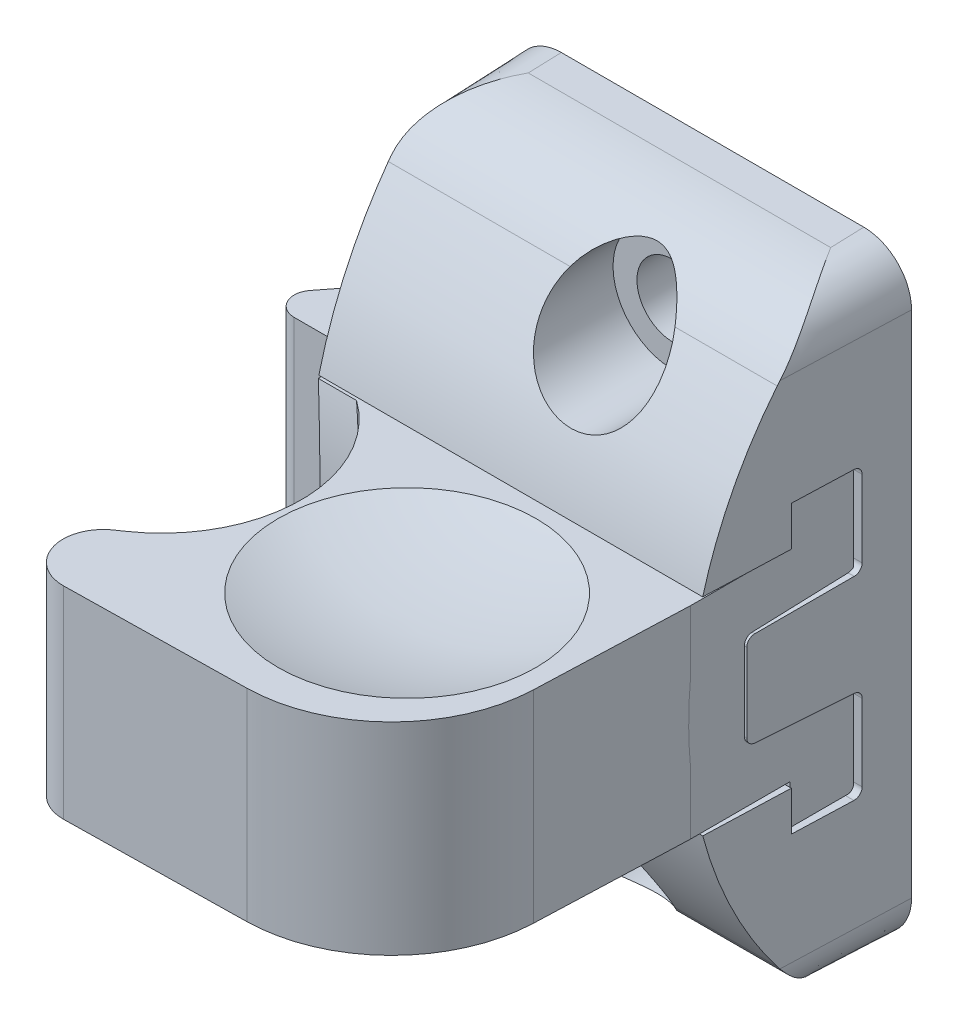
ISO-10303-21;
HEADER;
FILE_DESCRIPTION(('STEP AP214'),'2;1');
FILE_NAME('part.step','',(''),(''),'','','');
FILE_SCHEMA(('AUTOMOTIVE_DESIGN { 1 0 10303 214 1 1 1 1 }'));
ENDSEC;
DATA;
#1=APPLICATION_CONTEXT('core data for automotive mechanical design processes');
#2=APPLICATION_PROTOCOL_DEFINITION('international standard','automotive_design',2000,#1);
#3=PRODUCT_CONTEXT('',#1,'mechanical');
#4=PRODUCT('Part','Part','',(#3));
#5=PRODUCT_RELATED_PRODUCT_CATEGORY('part','',(#4));
#6=PRODUCT_DEFINITION_FORMATION('','',#4);
#7=PRODUCT_DEFINITION_CONTEXT('part definition',#1,'design');
#8=PRODUCT_DEFINITION('design','',#6,#7);
#9=PRODUCT_DEFINITION_SHAPE('','',#8);
#10=(LENGTH_UNIT() NAMED_UNIT(*) SI_UNIT(.MILLI.,.METRE.));
#11=(NAMED_UNIT(*) PLANE_ANGLE_UNIT() SI_UNIT($,.RADIAN.));
#12=(NAMED_UNIT(*) SI_UNIT($,.STERADIAN.) SOLID_ANGLE_UNIT());
#13=UNCERTAINTY_MEASURE_WITH_UNIT(LENGTH_MEASURE(1.E-05),#10,'distance_accuracy_value','');
#14=(GEOMETRIC_REPRESENTATION_CONTEXT(3) GLOBAL_UNCERTAINTY_ASSIGNED_CONTEXT((#13)) GLOBAL_UNIT_ASSIGNED_CONTEXT((#10,
#11,#12)) REPRESENTATION_CONTEXT('',''));
#15=CARTESIAN_POINT('',(0.,0.,0.));
#16=DIRECTION('',(0.,0.,1.));
#17=DIRECTION('',(1.,0.,0.));
#18=AXIS2_PLACEMENT_3D('',#15,#16,#17);
#19=CARTESIAN_POINT('',(2.69277565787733,6.35000000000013,27.0944370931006));
#20=DIRECTION('',(0.563600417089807,0.,0.826047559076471));
#21=DIRECTION('',(0.826047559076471,0.,-0.563600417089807));
#22=AXIS2_PLACEMENT_3D('',#19,#20,#21);
#23=PLANE('',#22);
#24=DIRECTION('',(0.,1.,0.));
#25=VECTOR('',#24,1.);
#26=CARTESIAN_POINT('',(2.27409094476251,6.35000000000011,27.3800996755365));
#27=LINE('',#26,#25);
#28=CARTESIAN_POINT('',(2.2740909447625,6.35000000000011,27.3800996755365));
#29=VERTEX_POINT('',#28);
#30=CARTESIAN_POINT('',(2.2740909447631,-6.34999999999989,27.3800996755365));
#31=VERTEX_POINT('',#30);
#32=EDGE_CURVE('E295',#29,#31,#27,.F.);
#33=ORIENTED_EDGE('',*,*,#32,.F.);
#34=DIRECTION('',(0.826047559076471,0.,-0.563600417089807));
#35=VECTOR('',#34,1.);
#36=CARTESIAN_POINT('',(2.69277565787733,6.35000000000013,27.0944370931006));
#37=LINE('',#36,#35);
#38=CARTESIAN_POINT('',(2.69277565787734,6.35000000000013,27.0944370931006));
#39=VERTEX_POINT('',#38);
#40=EDGE_CURVE('E287',#39,#29,#37,.F.);
#41=ORIENTED_EDGE('',*,*,#40,.F.);
#42=DIRECTION('',(0.,1.,0.));
#43=VECTOR('',#42,1.);
#44=CARTESIAN_POINT('',(2.69277565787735,6.35000000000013,27.0944370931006));
#45=LINE('',#44,#43);
#46=CARTESIAN_POINT('',(2.69277565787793,-6.34999999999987,27.0944370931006));
#47=VERTEX_POINT('',#46);
#48=EDGE_CURVE('E292',#39,#47,#45,.F.);
#49=ORIENTED_EDGE('',*,*,#48,.T.);
#50=DIRECTION('',(0.826047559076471,0.,-0.563600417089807));
#51=VECTOR('',#50,1.);
#52=CARTESIAN_POINT('',(2.69277565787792,-6.34999999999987,27.0944370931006));
#53=LINE('',#52,#51);
#54=EDGE_CURVE('E297',#31,#47,#53,.T.);
#55=ORIENTED_EDGE('',*,*,#54,.F.);
#56=EDGE_LOOP('',(#33,#41,#49,#55));
#57=FACE_BOUND('',#56,.T.);
#58=ADVANCED_FACE('F14',(#57),#23,.F.);
#59=CARTESIAN_POINT('',(-28.45,-1.33599728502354E-12,20.9));
#60=DIRECTION('',(0.,-1.,0.));
#61=DIRECTION('',(1.,0.,0.));
#62=AXIS2_PLACEMENT_3D('',#59,#60,#61);
#63=SPHERICAL_SURFACE('',#62,30.7);
#64=CARTESIAN_POINT('',(0.443266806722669,6.34999999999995,12.693500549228));
#65=CARTESIAN_POINT('',(0.440127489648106,6.24816535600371,12.6036482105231));
#66=CARTESIAN_POINT('',(0.437060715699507,6.14442400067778,12.5159532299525));
#67=CARTESIAN_POINT('',(0.431081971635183,5.93322399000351,12.3449762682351));
#68=CARTESIAN_POINT('',(0.428170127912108,5.82576241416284,12.2616978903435));
#69=CARTESIAN_POINT('',(0.42250907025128,5.60711288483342,12.099597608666));
#70=CARTESIAN_POINT('',(0.41976027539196,5.49591638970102,12.0207872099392));
#71=CARTESIAN_POINT('',(0.414422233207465,5.26979625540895,11.867663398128));
#72=CARTESIAN_POINT('',(0.411833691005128,5.15485913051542,11.7933698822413));
#73=CARTESIAN_POINT('',(0.406709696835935,4.91692171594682,11.6466460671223));
#74=CARTESIAN_POINT('',(0.404181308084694,4.79378719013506,11.5744330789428));
#75=CARTESIAN_POINT('',(0.399319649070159,4.54433009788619,11.4355285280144));
#76=CARTESIAN_POINT('',(0.396986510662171,4.41800545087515,11.3688406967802));
#77=CARTESIAN_POINT('',(0.39252300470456,4.16217627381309,11.2410323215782));
#78=CARTESIAN_POINT('',(0.390393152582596,4.03266465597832,11.1799259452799));
#79=CARTESIAN_POINT('',(0.386332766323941,3.77047268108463,11.0633275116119));
#80=CARTESIAN_POINT('',(0.384403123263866,3.63778114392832,11.0078605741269));
#81=CARTESIAN_POINT('',(0.380685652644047,3.36626453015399,10.9014155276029));
#82=CARTESIAN_POINT('',(0.378903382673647,3.22737213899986,10.8506088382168));
#83=CARTESIAN_POINT('',(0.37556796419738,2.94739160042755,10.7554755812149));
#84=CARTESIAN_POINT('',(0.374014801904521,2.80630358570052,10.7111486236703));
#85=CARTESIAN_POINT('',(0.371146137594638,2.52195508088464,10.6290107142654));
#86=CARTESIAN_POINT('',(0.369831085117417,2.37869102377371,10.5912120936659));
#87=CARTESIAN_POINT('',(0.367433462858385,2.09001602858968,10.5221643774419));
#88=CARTESIAN_POINT('',(0.366351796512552,1.94459899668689,10.4909407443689));
#89=CARTESIAN_POINT('',(0.364392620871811,1.65044419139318,10.4348415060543));
#90=CARTESIAN_POINT('',(0.363518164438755,1.50168837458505,10.4100603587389));
#91=CARTESIAN_POINT('',(0.362019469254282,1.20336887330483,10.3675687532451));
#92=CARTESIAN_POINT('',(0.361394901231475,1.05380651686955,10.3498489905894));
#93=CARTESIAN_POINT('',(0.360404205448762,0.753907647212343,10.3214871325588));
#94=CARTESIAN_POINT('',(0.360038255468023,0.603570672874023,10.3108499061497));
#95=CARTESIAN_POINT('',(0.359557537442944,0.302156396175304,10.2966552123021));
#96=CARTESIAN_POINT('',(0.359443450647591,0.151078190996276,10.2931169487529));
#97=CARTESIAN_POINT('',(0.359443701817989,-0.151088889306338,10.2931176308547));
#98=CARTESIAN_POINT('',(0.359558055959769,-0.302177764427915,10.2966570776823));
#99=CARTESIAN_POINT('',(0.360038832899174,-0.603606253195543,10.3108534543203));
#100=CARTESIAN_POINT('',(0.360404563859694,-0.753946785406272,10.3214908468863));
#101=CARTESIAN_POINT('',(0.361394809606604,-1.05384565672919,10.3498527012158));
#102=CARTESIAN_POINT('',(0.362019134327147,-1.20340448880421,10.3675719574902));
#103=CARTESIAN_POINT('',(0.363517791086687,-1.50170971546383,10.4100625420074));
#104=CARTESIAN_POINT('',(0.364392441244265,-1.65045482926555,10.434842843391));
#105=CARTESIAN_POINT('',(0.366352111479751,-1.94460919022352,10.4909433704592));
#106=CARTESIAN_POINT('',(0.36743410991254,-2.09003629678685,10.5221701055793));
#107=CARTESIAN_POINT('',(0.369831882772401,-2.37872469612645,10.5912220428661));
#108=CARTESIAN_POINT('',(0.37114674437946,-2.52199215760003,10.6290214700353));
#109=CARTESIAN_POINT('',(0.374014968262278,-2.80634067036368,10.711159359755));
#110=CARTESIAN_POINT('',(0.375567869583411,-2.9474253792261,10.7554851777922));
#111=CARTESIAN_POINT('',(0.378903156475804,-3.22739233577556,10.8506148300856));
#112=CARTESIAN_POINT('',(0.38068554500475,-3.36627455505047,10.901418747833));
#113=CARTESIAN_POINT('',(0.384403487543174,-3.63779035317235,11.0078648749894));
#114=CARTESIAN_POINT('',(0.386333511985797,-3.77049090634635,11.0633365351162));
#115=CARTESIAN_POINT('',(0.390394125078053,-4.03269487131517,11.1799413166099));
#116=CARTESIAN_POINT('',(0.392523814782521,-4.1622095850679,11.2410490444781));
#117=CARTESIAN_POINT('',(0.396986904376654,-4.41803877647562,11.3688573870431));
#118=CARTESIAN_POINT('',(0.399319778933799,-4.54436047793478,11.4355435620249));
#119=CARTESIAN_POINT('',(0.404181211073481,-4.79380533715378,11.5744422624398));
#120=CARTESIAN_POINT('',(0.406709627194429,-4.91693072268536,11.646650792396));
#121=CARTESIAN_POINT('',(0.411834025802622,-5.15486293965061,11.7933730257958));
#122=CARTESIAN_POINT('',(0.414422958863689,-5.26980366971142,11.8676699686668));
#123=CARTESIAN_POINT('',(0.419761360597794,-5.49592863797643,12.0207982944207));
#124=CARTESIAN_POINT('',(0.422510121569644,-5.60712643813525,12.0996096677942));
#125=CARTESIAN_POINT('',(0.428170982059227,-5.82577597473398,12.261709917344));
#126=CARTESIAN_POINT('',(0.431082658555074,-5.93323633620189,12.3449871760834));
#127=CARTESIAN_POINT('',(0.437061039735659,-6.14443136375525,12.5159598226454));
#128=CARTESIAN_POINT('',(0.440127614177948,-6.24816903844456,12.6036514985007));
#129=CARTESIAN_POINT('',(0.443266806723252,-6.34999999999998,12.693500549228));
#130=B_SPLINE_CURVE_WITH_KNOTS('',3,(#64,#65,#66,#67,#68,#69,#70,#71,#72,#73,#74,#75,#76,#77,
#78,#79,#80,#81,#82,#83,#84,#85,#86,#87,#88,#89,#90,#91,#92,#93,#94,#95,#96,#97,#98,#99,#100,
#101,#102,#103,#104,#105,#106,#107,#108,#109,#110,#111,#112,#113,#114,#115,#116,#117,#118,#119,
#120,#121,#122,#123,#124,#125,#126,#127,#128,#129),.UNSPECIFIED.,.F.,.F.,(4,2,2,2,2,2,2,2,2,2,2,
2,2,2,2,2,2,2,2,2,2,2,2,2,2,2,2,2,2,2,2,2,4),(0.,0.407502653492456,0.815332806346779,
1.22416941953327,1.63469297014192,2.06286027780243,2.49131443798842,2.92082757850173,
3.35217702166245,3.79573155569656,4.23925938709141,4.68361603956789,5.12966310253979,
5.58192181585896,6.03358262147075,6.48555360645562,6.9387456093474,7.39196970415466,
7.84395140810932,8.29560149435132,8.74782811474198,9.19390669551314,9.63827387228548,
10.0817911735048,10.5253141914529,10.9566940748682,11.386217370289,11.81466135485,
12.2427982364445,12.6533364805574,13.0621780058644,13.4700032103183,13.8774910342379),.UNSPECIFIED.);
#131=CARTESIAN_POINT('',(0.443266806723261,-6.35,12.693500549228));
#132=VERTEX_POINT('',#131);
#133=CARTESIAN_POINT('',(0.443266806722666,6.35,12.693500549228));
#134=VERTEX_POINT('',#133);
#135=EDGE_CURVE('E769',#132,#134,#130,.F.);
#136=ORIENTED_EDGE('',*,*,#135,.F.);
#137=CARTESIAN_POINT('',(-28.45,-6.35000000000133,20.9));
#138=DIRECTION('',(0.,-1.,0.));
#139=DIRECTION('',(1.,0.,0.));
#140=AXIS2_PLACEMENT_3D('',#137,#138,#139);
#141=CIRCLE('',#140,30.0361032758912);
#142=CARTESIAN_POINT('',(0.448697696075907,-6.35,12.7126456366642));
#143=VERTEX_POINT('',#142);
#144=EDGE_CURVE('E2030',#143,#132,#141,.F.);
#145=ORIENTED_EDGE('',*,*,#144,.F.);
#146=CARTESIAN_POINT('',(0.448697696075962,-6.34999999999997,12.7126456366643));
#147=CARTESIAN_POINT('',(0.522451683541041,-6.09665055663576,12.7764686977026));
#148=CARTESIAN_POINT('',(0.591853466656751,-5.84113888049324,12.8367755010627));
#149=CARTESIAN_POINT('',(0.721743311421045,-5.32639279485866,12.9499991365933));
#150=CARTESIAN_POINT('',(0.782236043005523,-5.06716041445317,13.0029198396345));
#151=CARTESIAN_POINT('',(0.894219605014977,-4.54510586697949,13.1011195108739));
#152=CARTESIAN_POINT('',(0.945703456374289,-4.28228108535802,13.1463925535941));
#153=CARTESIAN_POINT('',(1.03957309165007,-3.75319770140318,13.2291046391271));
#154=CARTESIAN_POINT('',(1.08193927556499,-3.48693298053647,13.2665268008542));
#155=CARTESIAN_POINT('',(1.15703297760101,-2.95417454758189,13.3330094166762));
#156=CARTESIAN_POINT('',(1.18983355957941,-2.68769904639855,13.3621332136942));
#157=CARTESIAN_POINT('',(1.24609342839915,-2.15331717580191,13.4121444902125));
#158=CARTESIAN_POINT('',(1.26956382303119,-1.88541289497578,13.4330417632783));
#159=CARTESIAN_POINT('',(1.30714816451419,-1.34835751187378,13.4665065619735));
#160=CARTESIAN_POINT('',(1.32125961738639,-1.07920609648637,13.479071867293));
#161=CARTESIAN_POINT('',(1.34009630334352,-0.539843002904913,13.4958291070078));
#162=CARTESIAN_POINT('',(1.34480505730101,-0.269630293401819,13.5000063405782));
#163=CARTESIAN_POINT('',(1.34479130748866,0.271898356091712,13.4999936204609));
#164=CARTESIAN_POINT('',(1.34003021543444,0.543214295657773,13.4957694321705));
#165=CARTESIAN_POINT('',(1.32101270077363,1.08476158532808,13.4788516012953));
#166=CARTESIAN_POINT('',(1.30677331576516,1.35499400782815,13.4661731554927));
#167=CARTESIAN_POINT('',(1.26885840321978,1.89418711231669,13.4324157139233));
#168=CARTESIAN_POINT('',(1.24518570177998,2.16314815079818,13.4113392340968));
#169=CARTESIAN_POINT('',(1.18844777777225,2.69961729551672,13.3609047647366));
#170=CARTESIAN_POINT('',(1.15537156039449,2.9671233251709,13.3315370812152));
#171=CARTESIAN_POINT('',(1.07996800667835,3.49969478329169,13.2647831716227));
#172=CARTESIAN_POINT('',(1.03764483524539,3.76476125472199,13.2274005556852));
#173=CARTESIAN_POINT('',(0.943943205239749,4.29146914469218,13.1448406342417));
#174=CARTESIAN_POINT('',(0.892584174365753,4.55311664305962,13.0996800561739));
#175=CARTESIAN_POINT('',(0.78093092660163,5.07283947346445,13.0017755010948));
#176=CARTESIAN_POINT('',(0.720643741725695,5.33091744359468,12.9490374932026));
#177=CARTESIAN_POINT('',(0.591244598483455,5.84337931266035,12.8362459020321));
#178=CARTESIAN_POINT('',(0.522128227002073,6.09776129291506,12.7761886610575));
#179=CARTESIAN_POINT('',(0.448697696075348,6.3500000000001,12.7126456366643));
#180=B_SPLINE_CURVE_WITH_KNOTS('',3,(#146,#147,#148,#149,#150,#151,#152,#153,#154,#155,#156,
#157,#158,#159,#160,#161,#162,#163,#164,#165,#166,#167,#168,#169,#170,#171,#172,#173,#174,#175,
#176,#177,#178,#179),.UNSPECIFIED.,.F.,.F.,(4,2,2,2,2,2,2,2,2,2,2,2,2,2,2,2,4),(0.,
0.8143736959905,1.62831898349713,2.44289205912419,3.25919908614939,4.06909709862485,
4.87802800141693,5.68717438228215,6.49773762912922,7.31161057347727,8.12402448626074,
8.93619519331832,9.74931944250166,10.5620782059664,11.3731103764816,12.1835071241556,
12.9943105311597),.UNSPECIFIED.);
#181=CARTESIAN_POINT('',(0.448697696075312,6.35,12.7126456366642));
#182=VERTEX_POINT('',#181);
#183=EDGE_CURVE('E308',#182,#143,#180,.F.);
#184=ORIENTED_EDGE('',*,*,#183,.F.);
#185=CARTESIAN_POINT('',(-28.45,6.34999999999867,20.9));
#186=DIRECTION('',(0.,-1.,0.));
#187=DIRECTION('',(1.,0.,0.));
#188=AXIS2_PLACEMENT_3D('',#185,#186,#187);
#189=CIRCLE('',#188,30.0361032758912);
#190=EDGE_CURVE('E2032',#134,#182,#189,.T.);
#191=ORIENTED_EDGE('',*,*,#190,.F.);
#192=EDGE_LOOP('',(#136,#145,#184,#191));
#193=FACE_BOUND('',#192,.T.);
#194=ADVANCED_FACE('F1980',(#193),#63,.F.);
#195=CARTESIAN_POINT('',(14.9099999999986,30.0000000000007,21.6));
#196=DIRECTION('',(0.,1.,0.));
#197=DIRECTION('',(-1.,0.,0.));
#198=AXIS2_PLACEMENT_3D('',#195,#196,#197);
#199=SPHERICAL_SURFACE('',#198,25.);
#200=CARTESIAN_POINT('',(14.9099999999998,5.0000000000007,21.6));
#201=VERTEX_POINT('',#200);
#202=VERTEX_LOOP('',#201);
#203=FACE_BOUND('',#202,.T.);
#204=CARTESIAN_POINT('',(14.9099999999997,6.35000000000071,21.6));
#205=DIRECTION('',(0.,1.,0.));
#206=DIRECTION('',(0.,0.,-1.));
#207=AXIS2_PLACEMENT_3D('',#204,#205,#206);
#208=CIRCLE('',#207,8.10416559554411);
#209=CARTESIAN_POINT('',(14.9099999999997,6.35000000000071,13.4958344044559));
#210=VERTEX_POINT('',#209);
#211=EDGE_CURVE('E417',#210,#210,#208,.T.);
#212=ORIENTED_EDGE('',*,*,#211,.T.);
#213=EDGE_LOOP('',(#212));
#214=FACE_BOUND('',#213,.T.);
#215=ADVANCED_FACE('F727',(#203,#214),#199,.F.);
#216=CARTESIAN_POINT('',(14.9100000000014,-29.9999999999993,21.6));
#217=DIRECTION('',(0.,1.,0.));
#218=DIRECTION('',(1.,0.,0.));
#219=AXIS2_PLACEMENT_3D('',#216,#217,#218);
#220=SPHERICAL_SURFACE('',#219,25.);
#221=CARTESIAN_POINT('',(14.9100000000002,-4.9999999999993,21.6));
#222=VERTEX_POINT('',#221);
#223=VERTEX_LOOP('',#222);
#224=FACE_BOUND('',#223,.T.);
#225=CARTESIAN_POINT('',(14.9100000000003,-6.34999999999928,21.6));
#226=DIRECTION('',(0.,-1.,0.));
#227=DIRECTION('',(0.,0.,1.));
#228=AXIS2_PLACEMENT_3D('',#225,#226,#227);
#229=CIRCLE('',#228,8.10416559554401);
#230=CARTESIAN_POINT('',(14.9100000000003,-6.34999999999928,29.704165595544));
#231=VERTEX_POINT('',#230);
#232=EDGE_CURVE('E490',#231,#231,#229,.T.);
#233=ORIENTED_EDGE('',*,*,#232,.T.);
#234=EDGE_LOOP('',(#233));
#235=FACE_BOUND('',#234,.T.);
#236=ADVANCED_FACE('F723',(#224,#235),#220,.F.);
#237=CARTESIAN_POINT('',(30.,1.41033018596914E-12,-12.5));
#238=DIRECTION('',(1.,0.,0.));
#239=DIRECTION('',(0.,1.,0.));
#240=AXIS2_PLACEMENT_3D('',#237,#238,#239);
#241=CYLINDRICAL_SURFACE('',#240,26.);
#242=DIRECTION('',(1.,0.,0.));
#243=VECTOR('',#242,1.);
#244=CARTESIAN_POINT('',(-14.9999999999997,-6.3500000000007,12.7126456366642));
#245=LINE('',#244,#243);
#246=CARTESIAN_POINT('',(2.84618216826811,-6.34999999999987,12.7126456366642));
#247=VERTEX_POINT('',#246);
#248=EDGE_CURVE('E570',#143,#247,#245,.T.);
#249=ORIENTED_EDGE('',*,*,#248,.T.);
#250=CARTESIAN_POINT('',(2.8461821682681,-6.34999999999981,12.7126456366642));
#251=CARTESIAN_POINT('',(2.92916999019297,-6.11467322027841,12.7719354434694));
#252=CARTESIAN_POINT('',(3.00541044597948,-5.87634130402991,12.8284377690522));
#253=CARTESIAN_POINT('',(3.14806949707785,-5.38592402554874,12.9373128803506));
#254=CARTESIAN_POINT('',(3.21402805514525,-5.13365417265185,12.9894596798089));
#255=CARTESIAN_POINT('',(3.33614508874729,-4.61537256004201,13.0884864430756));
#256=CARTESIAN_POINT('',(3.39184126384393,-4.34920095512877,13.1350942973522));
#257=CARTESIAN_POINT('',(3.49341760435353,-3.80313011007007,13.2218877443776));
#258=CARTESIAN_POINT('',(3.53883918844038,-3.52309598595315,13.2617583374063));
#259=CARTESIAN_POINT('',(3.61554828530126,-2.98030359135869,13.329967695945));
#260=CARTESIAN_POINT('',(3.64761054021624,-2.71773095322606,13.3589243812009));
#261=CARTESIAN_POINT('',(3.70269020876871,-2.18745459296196,13.4092044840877));
#262=CARTESIAN_POINT('',(3.72558554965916,-1.91972838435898,13.4304245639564));
#263=CARTESIAN_POINT('',(3.7623270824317,-1.37936702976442,13.4648159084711));
#264=CARTESIAN_POINT('',(3.77604221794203,-1.10671560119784,13.477870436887));
#265=CARTESIAN_POINT('',(3.79443594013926,-0.556747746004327,13.4955160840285));
#266=CARTESIAN_POINT('',(3.79897614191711,-0.279422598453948,13.4999775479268));
#267=CARTESIAN_POINT('',(3.79902347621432,0.274771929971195,13.5000222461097));
#268=CARTESIAN_POINT('',(3.79454548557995,0.551641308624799,13.4956201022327));
#269=CARTESIAN_POINT('',(3.77630510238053,1.10073954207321,13.4781199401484));
#270=CARTESIAN_POINT('',(3.76267965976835,1.37297696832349,13.4651502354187));
#271=CARTESIAN_POINT('',(3.72614718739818,1.91255320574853,13.4309508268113));
#272=CARTESIAN_POINT('',(3.70336977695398,2.17990805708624,13.4098366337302));
#273=CARTESIAN_POINT('',(3.64855559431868,2.70948521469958,13.3597861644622));
#274=CARTESIAN_POINT('',(3.61663948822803,2.97172968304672,13.3309521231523));
#275=CARTESIAN_POINT('',(3.54010291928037,3.51504002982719,13.2628679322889));
#276=CARTESIAN_POINT('',(3.49466287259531,3.79591006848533,13.2229633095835));
#277=CARTESIAN_POINT('',(3.39298995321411,4.34359024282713,13.1360538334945));
#278=CARTESIAN_POINT('',(3.33721881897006,4.61053599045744,13.0893664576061));
#279=CARTESIAN_POINT('',(3.21489236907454,5.13030243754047,12.9901418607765));
#280=CARTESIAN_POINT('',(3.14880252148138,5.3832839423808,12.9378788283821));
#281=CARTESIAN_POINT('',(3.00582130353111,5.87506010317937,12.8287415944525));
#282=CARTESIAN_POINT('',(2.92939307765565,6.11404043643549,12.7720950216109));
#283=CARTESIAN_POINT('',(2.8461821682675,6.35000000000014,12.7126456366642));
#284=B_SPLINE_CURVE_WITH_KNOTS('',3,(#250,#251,#252,#253,#254,#255,#256,#257,#258,#259,#260,
#261,#262,#263,#264,#265,#266,#267,#268,#269,#270,#271,#272,#273,#274,#275,#276,#277,#278,#279,
#280,#281,#282,#283),.UNSPECIFIED.,.F.,.F.,(4,2,2,2,2,2,2,2,2,2,2,2,2,2,2,2,4),(0.,
0.769212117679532,1.56649887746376,2.39379428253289,3.25282960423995,4.05085180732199,
4.85917325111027,5.6788012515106,6.5107020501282,7.34123162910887,8.15959638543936,
8.96675766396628,9.76371735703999,10.625223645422,11.4548422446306,12.2543169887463,
13.0255962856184),.UNSPECIFIED.);
#285=CARTESIAN_POINT('',(2.84618216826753,6.35000000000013,12.7126456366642));
#286=VERTEX_POINT('',#285);
#287=EDGE_CURVE('E307',#247,#286,#284,.T.);
#288=ORIENTED_EDGE('',*,*,#287,.T.);
#289=DIRECTION('',(1.,0.,0.));
#290=VECTOR('',#289,1.);
#291=CARTESIAN_POINT('',(-15.0000000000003,6.3499999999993,12.7126456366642));
#292=LINE('',#291,#290);
#293=EDGE_CURVE('E316',#286,#182,#292,.F.);
#294=ORIENTED_EDGE('',*,*,#293,.T.);
#295=ORIENTED_EDGE('',*,*,#183,.T.);
#296=EDGE_LOOP('',(#249,#288,#294,#295));
#297=FACE_BOUND('',#296,.T.);
#298=ADVANCED_FACE('F677',(#297),#241,.T.);
#299=CARTESIAN_POINT('',(-2.25000000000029,6.3499999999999,19.85));
#300=DIRECTION('',(0.,1.,0.));
#301=DIRECTION('',(0.,0.,1.));
#302=AXIS2_PLACEMENT_3D('',#299,#300,#301);
#303=CYLINDRICAL_SURFACE('',#302,8.77);
#304=CARTESIAN_POINT('',(-2.2499999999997,-6.3500000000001,19.85));
#305=DIRECTION('',(0.,-1.,0.));
#306=DIRECTION('',(0.581092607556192,0.,-0.813837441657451));
#307=AXIS2_PLACEMENT_3D('',#304,#305,#306);
#308=CIRCLE('',#307,8.77);
#309=EDGE_CURVE('E305',#247,#47,#308,.T.);
#310=ORIENTED_EDGE('',*,*,#309,.T.);
#311=ORIENTED_EDGE('',*,*,#48,.F.);
#312=CARTESIAN_POINT('',(-2.25000000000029,6.3499999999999,19.85));
#313=DIRECTION('',(0.,1.,0.));
#314=DIRECTION('',(0.56360041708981,0.,0.826047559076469));
#315=AXIS2_PLACEMENT_3D('',#312,#313,#314);
#316=CIRCLE('',#315,8.77);
#317=EDGE_CURVE('E302',#39,#286,#316,.T.);
#318=ORIENTED_EDGE('',*,*,#317,.T.);
#319=ORIENTED_EDGE('',*,*,#287,.F.);
#320=EDGE_LOOP('',(#310,#311,#318,#319));
#321=FACE_BOUND('',#320,.T.);
#322=ADVANCED_FACE('F301',(#321),#303,.F.);
#323=CARTESIAN_POINT('',(3.69999999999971,6.35000000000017,29.47));
#324=DIRECTION('',(0.,1.,0.));
#325=DIRECTION('',(0.,0.,1.));
#326=AXIS2_PLACEMENT_3D('',#323,#324,#325);
#327=CYLINDRICAL_SURFACE('',#326,2.53);
#328=CARTESIAN_POINT('',(3.69999999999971,6.35000000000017,29.47));
#329=DIRECTION('',(0.,-1.,0.));
#330=DIRECTION('',(0.0168764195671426,0.,0.999857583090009));
#331=AXIS2_PLACEMENT_3D('',#328,#329,#330);
#332=CIRCLE('',#331,2.53);
#333=CARTESIAN_POINT('',(3.74269734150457,6.35000000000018,31.9996396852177));
#334=VERTEX_POINT('',#333);
#335=EDGE_CURVE('E317',#334,#29,#332,.T.);
#336=ORIENTED_EDGE('',*,*,#335,.T.);
#337=ORIENTED_EDGE('',*,*,#32,.T.);
#338=CARTESIAN_POINT('',(3.7000000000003,-6.34999999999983,29.47));
#339=DIRECTION('',(0.,1.,0.));
#340=DIRECTION('',(-0.563600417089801,0.,-0.826047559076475));
#341=AXIS2_PLACEMENT_3D('',#338,#339,#340);
#342=CIRCLE('',#341,2.53);
#343=CARTESIAN_POINT('',(3.74269734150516,-6.34999999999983,31.9996396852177));
#344=VERTEX_POINT('',#343);
#345=EDGE_CURVE('E567',#31,#344,#342,.T.);
#346=ORIENTED_EDGE('',*,*,#345,.T.);
#347=DIRECTION('',(0.,1.,0.));
#348=VECTOR('',#347,1.);
#349=CARTESIAN_POINT('',(3.74269734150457,6.35000000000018,31.9996396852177));
#350=LINE('',#349,#348);
#351=EDGE_CURVE('E650',#344,#334,#350,.T.);
#352=ORIENTED_EDGE('',*,*,#351,.T.);
#353=EDGE_LOOP('',(#336,#337,#346,#352));
#354=FACE_BOUND('',#353,.T.);
#355=ADVANCED_FACE('F664',(#354),#327,.T.);
#356=CARTESIAN_POINT('',(3.74269734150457,6.35000000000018,31.9996396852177));
#357=DIRECTION('',(-0.0168764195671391,0.,-0.999857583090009));
#358=DIRECTION('',(-0.999857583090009,0.,0.0168764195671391));
#359=AXIS2_PLACEMENT_3D('',#356,#357,#358);
#360=PLANE('',#359);
#361=DIRECTION('',(0.,1.,0.));
#362=VECTOR('',#361,1.);
#363=CARTESIAN_POINT('',(15.0561068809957,6.35000000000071,31.8086826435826));
#364=LINE('',#363,#362);
#365=CARTESIAN_POINT('',(15.0561068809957,6.35000000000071,31.8086826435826));
#366=VERTEX_POINT('',#365);
#367=CARTESIAN_POINT('',(15.0561068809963,-6.3499999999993,31.8086826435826));
#368=VERTEX_POINT('',#367);
#369=EDGE_CURVE('E608',#366,#368,#364,.F.);
#370=ORIENTED_EDGE('',*,*,#369,.F.);
#371=DIRECTION('',(-0.999857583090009,0.,0.0168764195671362));
#372=VECTOR('',#371,1.);
#373=CARTESIAN_POINT('',(15.0561068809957,6.35000000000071,31.8086826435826));
#374=LINE('',#373,#372);
#375=EDGE_CURVE('E397',#366,#334,#374,.T.);
#376=ORIENTED_EDGE('',*,*,#375,.T.);
#377=ORIENTED_EDGE('',*,*,#351,.F.);
#378=DIRECTION('',(0.999857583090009,0.,-0.0168764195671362));
#379=VECTOR('',#378,1.);
#380=CARTESIAN_POINT('',(3.74269734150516,-6.34999999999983,31.9996396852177));
#381=LINE('',#380,#379);
#382=EDGE_CURVE('E564',#344,#368,#381,.T.);
#383=ORIENTED_EDGE('',*,*,#382,.T.);
#384=EDGE_LOOP('',(#370,#376,#377,#383));
#385=FACE_BOUND('',#384,.T.);
#386=ADVANCED_FACE('F633',(#385),#360,.F.);
#387=CARTESIAN_POINT('',(14.8999999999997,6.3500000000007,22.56));
#388=DIRECTION('',(0.,1.,0.));
#389=DIRECTION('',(0.,0.,1.));
#390=AXIS2_PLACEMENT_3D('',#387,#388,#389);
#391=CYLINDRICAL_SURFACE('',#390,9.25);
#392=CARTESIAN_POINT('',(14.8999999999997,6.3500000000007,22.56));
#393=DIRECTION('',(0.,-1.,0.));
#394=DIRECTION('',(0.99930169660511,0.,0.0373646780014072));
#395=AXIS2_PLACEMENT_3D('',#392,#393,#394);
#396=CIRCLE('',#395,9.25);
#397=CARTESIAN_POINT('',(24.143540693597,6.35000000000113,22.905623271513));
#398=VERTEX_POINT('',#397);
#399=EDGE_CURVE('E400',#398,#366,#396,.T.);
#400=ORIENTED_EDGE('',*,*,#399,.T.);
#401=ORIENTED_EDGE('',*,*,#369,.T.);
#402=CARTESIAN_POINT('',(14.9000000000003,-6.3499999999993,22.56));
#403=DIRECTION('',(0.,1.,0.));
#404=DIRECTION('',(0.0168764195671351,0.,0.999857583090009));
#405=AXIS2_PLACEMENT_3D('',#402,#403,#404);
#406=CIRCLE('',#405,9.25);
#407=CARTESIAN_POINT('',(24.1435406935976,-6.34999999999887,22.905623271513));
#408=VERTEX_POINT('',#407);
#409=EDGE_CURVE('E561',#368,#408,#406,.T.);
#410=ORIENTED_EDGE('',*,*,#409,.T.);
#411=DIRECTION('',(0.,1.,0.));
#412=VECTOR('',#411,1.);
#413=CARTESIAN_POINT('',(24.143540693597,6.35000000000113,22.905623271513));
#414=LINE('',#413,#412);
#415=EDGE_CURVE('E405',#408,#398,#414,.T.);
#416=ORIENTED_EDGE('',*,*,#415,.T.);
#417=EDGE_LOOP('',(#400,#401,#410,#416));
#418=FACE_BOUND('',#417,.T.);
#419=ADVANCED_FACE('F606',(#418),#391,.T.);
#420=CARTESIAN_POINT('',(-3.6300000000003,6.34999999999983,8.93));
#421=DIRECTION('',(0.,1.,0.));
#422=DIRECTION('',(0.,0.,1.));
#423=AXIS2_PLACEMENT_3D('',#420,#421,#422);
#424=CYLINDRICAL_SURFACE('',#423,1.22);
#425=CARTESIAN_POINT('',(-3.6300000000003,6.34999999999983,8.93));
#426=DIRECTION('',(0.,-1.,0.));
#427=DIRECTION('',(0.,0.,1.));
#428=AXIS2_PLACEMENT_3D('',#425,#426,#427);
#429=CIRCLE('',#428,1.22);
#430=CARTESIAN_POINT('',(-3.6300000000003,6.34999999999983,10.15));
#431=VERTEX_POINT('',#430);
#432=CARTESIAN_POINT('',(-4.59075174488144,6.34999999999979,8.17809835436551));
#433=VERTEX_POINT('',#432);
#434=EDGE_CURVE('E385',#431,#433,#429,.T.);
#435=ORIENTED_EDGE('',*,*,#434,.T.);
#436=DIRECTION('',(0.,1.,0.));
#437=VECTOR('',#436,1.);
#438=CARTESIAN_POINT('',(-4.59075174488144,6.34999999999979,8.17809835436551));
#439=LINE('',#438,#437);
#440=CARTESIAN_POINT('',(-4.59075174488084,-6.35000000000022,8.17809835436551));
#441=VERTEX_POINT('',#440);
#442=EDGE_CURVE('E418',#433,#441,#439,.F.);
#443=ORIENTED_EDGE('',*,*,#442,.T.);
#444=CARTESIAN_POINT('',(-3.62999999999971,-6.35000000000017,8.93));
#445=DIRECTION('',(0.,1.,0.));
#446=DIRECTION('',(-0.78750143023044,0.,-0.616312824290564));
#447=AXIS2_PLACEMENT_3D('',#444,#445,#446);
#448=CIRCLE('',#447,1.22);
#449=CARTESIAN_POINT('',(-3.62999999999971,-6.35000000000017,10.15));
#450=VERTEX_POINT('',#449);
#451=EDGE_CURVE('E535',#441,#450,#448,.T.);
#452=ORIENTED_EDGE('',*,*,#451,.T.);
#453=DIRECTION('',(0.,1.,0.));
#454=VECTOR('',#453,1.);
#455=CARTESIAN_POINT('',(-3.6300000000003,6.34999999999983,10.15));
#456=LINE('',#455,#454);
#457=EDGE_CURVE('E649',#450,#431,#456,.T.);
#458=ORIENTED_EDGE('',*,*,#457,.T.);
#459=EDGE_LOOP('',(#435,#443,#452,#458));
#460=FACE_BOUND('',#459,.T.);
#461=ADVANCED_FACE('F632',(#460),#424,.T.);
#462=CARTESIAN_POINT('',(-3.6300000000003,6.34999999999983,10.15));
#463=DIRECTION('',(0.,0.,-1.));
#464=DIRECTION('',(0.,1.,0.));
#465=AXIS2_PLACEMENT_3D('',#462,#463,#464);
#466=PLANE('',#465);
#467=DIRECTION('',(0.,1.,0.));
#468=VECTOR('',#467,1.);
#469=CARTESIAN_POINT('',(0.35444581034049,16.,10.15));
#470=LINE('',#469,#468);
#471=CARTESIAN_POINT('',(0.354445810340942,6.35,10.15));
#472=VERTEX_POINT('',#471);
#473=CARTESIAN_POINT('',(0.354445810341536,-6.35,10.15));
#474=VERTEX_POINT('',#473);
#475=EDGE_CURVE('E782',#472,#474,#470,.F.);
#476=ORIENTED_EDGE('',*,*,#475,.F.);
#477=DIRECTION('',(1.,0.,0.));
#478=VECTOR('',#477,1.);
#479=CARTESIAN_POINT('',(-15.0000000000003,6.3499999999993,10.15));
#480=LINE('',#479,#478);
#481=EDGE_CURVE('E388',#472,#431,#480,.F.);
#482=ORIENTED_EDGE('',*,*,#481,.T.);
#483=ORIENTED_EDGE('',*,*,#457,.F.);
#484=DIRECTION('',(1.,0.,0.));
#485=VECTOR('',#484,1.);
#486=CARTESIAN_POINT('',(-14.9999999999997,-6.3500000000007,10.15));
#487=LINE('',#486,#485);
#488=EDGE_CURVE('E540',#450,#474,#487,.T.);
#489=ORIENTED_EDGE('',*,*,#488,.T.);
#490=EDGE_LOOP('',(#476,#482,#483,#489));
#491=FACE_BOUND('',#490,.T.);
#492=ADVANCED_FACE('F806',(#491),#466,.F.);
#493=CARTESIAN_POINT('',(-7.49400541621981E-13,16.,0.));
#494=DIRECTION('',(-0.999390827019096,0.,0.034899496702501));
#495=DIRECTION('',(0.034899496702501,0.,0.999390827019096));
#496=AXIS2_PLACEMENT_3D('',#493,#494,#495);
#497=PLANE('',#496);
#498=ORIENTED_EDGE('',*,*,#135,.T.);
#499=DIRECTION('',(-0.0348994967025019,0.,-0.999390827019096));
#500=VECTOR('',#499,1.);
#501=CARTESIAN_POINT('',(0.443266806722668,6.35,12.693500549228));
#502=LINE('',#501,#500);
#503=EDGE_CURVE('E391',#134,#472,#502,.T.);
#504=ORIENTED_EDGE('',*,*,#503,.T.);
#505=ORIENTED_EDGE('',*,*,#475,.T.);
#506=DIRECTION('',(0.0348994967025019,0.,0.999390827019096));
#507=VECTOR('',#506,1.);
#508=CARTESIAN_POINT('',(0.354445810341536,-6.35,10.15));
#509=LINE('',#508,#507);
#510=EDGE_CURVE('E479',#474,#132,#509,.T.);
#511=ORIENTED_EDGE('',*,*,#510,.T.);
#512=EDGE_LOOP('',(#498,#504,#505,#511));
#513=FACE_BOUND('',#512,.T.);
#514=ADVANCED_FACE('F796',(#513),#497,.T.);
#515=CARTESIAN_POINT('',(-0.874876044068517,6.35,3.43009163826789));
#516=DIRECTION('',(0.787501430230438,0.,0.616312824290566));
#517=DIRECTION('',(0.616312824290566,0.,-0.787501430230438));
#518=AXIS2_PLACEMENT_3D('',#515,#516,#517);
#519=PLANE('',#518);
#520=ORIENTED_EDGE('',*,*,#442,.F.);
#521=DIRECTION('',(0.616312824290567,0.,-0.787501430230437));
#522=VECTOR('',#521,1.);
#523=CARTESIAN_POINT('',(-4.59075174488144,6.34999999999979,8.17809835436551));
#524=LINE('',#523,#522);
#525=CARTESIAN_POINT('',(-0.874876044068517,6.35,3.43009163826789));
#526=VERTEX_POINT('',#525);
#527=EDGE_CURVE('E380',#433,#526,#524,.T.);
#528=ORIENTED_EDGE('',*,*,#527,.T.);
#529=DIRECTION('',(0.,1.,0.));
#530=VECTOR('',#529,1.);
#531=CARTESIAN_POINT('',(-0.874876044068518,6.35,3.43009163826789));
#532=LINE('',#531,#530);
#533=CARTESIAN_POINT('',(-0.874876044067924,-6.35,3.43009163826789));
#534=VERTEX_POINT('',#533);
#535=EDGE_CURVE('E1511',#534,#526,#532,.T.);
#536=ORIENTED_EDGE('',*,*,#535,.F.);
#537=DIRECTION('',(-0.616312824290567,0.,0.787501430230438));
#538=VECTOR('',#537,1.);
#539=CARTESIAN_POINT('',(-0.874876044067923,-6.35,3.43009163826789));
#540=LINE('',#539,#538);
#541=EDGE_CURVE('E550',#534,#441,#540,.T.);
#542=ORIENTED_EDGE('',*,*,#541,.T.);
#543=EDGE_LOOP('',(#520,#528,#536,#542));
#544=FACE_BOUND('',#543,.T.);
#545=ADVANCED_FACE('F805',(#544),#519,.F.);
#546=CARTESIAN_POINT('',(-15.0000000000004,8.8499999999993,7.15));
#547=DIRECTION('',(0.,-1.,0.));
#548=DIRECTION('',(0.,0.,-1.));
#549=AXIS2_PLACEMENT_3D('',#546,#547,#548);
#550=PLANE('',#549);
#551=DIRECTION('',(-1.,0.,0.));
#552=VECTOR('',#551,1.);
#553=CARTESIAN_POINT('',(-15.0000000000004,8.8499999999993,3.5));
#554=LINE('',#553,#552);
#555=CARTESIAN_POINT('',(0.122222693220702,8.85,3.5));
#556=VERTEX_POINT('',#555);
#557=CARTESIAN_POINT('',(24.4999999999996,8.85000000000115,3.5));
#558=VERTEX_POINT('',#557);
#559=EDGE_CURVE('E458',#556,#558,#554,.F.);
#560=ORIENTED_EDGE('',*,*,#559,.F.);
#561=DIRECTION('',(0.034899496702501,0.,0.999390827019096));
#562=VECTOR('',#561,1.);
#563=CARTESIAN_POINT('',(-4.14512174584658E-13,8.85,0.));
#564=LINE('',#563,#562);
#565=CARTESIAN_POINT('',(0.249683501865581,8.85,7.15));
#566=VERTEX_POINT('',#565);
#567=EDGE_CURVE('E1470',#566,#556,#564,.F.);
#568=ORIENTED_EDGE('',*,*,#567,.F.);
#569=DIRECTION('',(1.,0.,0.));
#570=VECTOR('',#569,1.);
#571=CARTESIAN_POINT('',(-15.0000000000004,8.8499999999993,7.15));
#572=LINE('',#571,#570);
#573=CARTESIAN_POINT('',(24.4999999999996,8.85000000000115,7.15));
#574=VERTEX_POINT('',#573);
#575=EDGE_CURVE('E414',#566,#574,#572,.T.);
#576=ORIENTED_EDGE('',*,*,#575,.T.);
#577=DIRECTION('',(0.,0.,1.));
#578=VECTOR('',#577,1.);
#579=CARTESIAN_POINT('',(24.4999999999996,8.85000000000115,3.5));
#580=LINE('',#579,#578);
#581=EDGE_CURVE('E411',#558,#574,#580,.T.);
#582=ORIENTED_EDGE('',*,*,#581,.F.);
#583=EDGE_LOOP('',(#560,#568,#576,#582));
#584=FACE_BOUND('',#583,.T.);
#585=ADVANCED_FACE('F1618',(#584),#550,.F.);
#586=CARTESIAN_POINT('',(-15.0000000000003,6.3499999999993,7.15));
#587=DIRECTION('',(0.,0.,-1.));
#588=DIRECTION('',(0.,1.,0.));
#589=AXIS2_PLACEMENT_3D('',#586,#587,#588);
#590=PLANE('',#589);
#591=ORIENTED_EDGE('',*,*,#575,.F.);
#592=DIRECTION('',(0.,1.,0.));
#593=VECTOR('',#592,1.);
#594=CARTESIAN_POINT('',(0.249683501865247,16.,7.15));
#595=LINE('',#594,#593);
#596=CARTESIAN_POINT('',(0.249683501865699,6.35,7.15));
#597=VERTEX_POINT('',#596);
#598=EDGE_CURVE('E1477',#597,#566,#595,.T.);
#599=ORIENTED_EDGE('',*,*,#598,.F.);
#600=DIRECTION('',(1.,0.,0.));
#601=VECTOR('',#600,1.);
#602=CARTESIAN_POINT('',(-15.0000000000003,6.3499999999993,7.15));
#603=LINE('',#602,#601);
#604=CARTESIAN_POINT('',(24.4999999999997,6.35000000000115,7.15));
#605=VERTEX_POINT('',#604);
#606=EDGE_CURVE('E379',#597,#605,#603,.T.);
#607=ORIENTED_EDGE('',*,*,#606,.T.);
#608=DIRECTION('',(0.,1.,0.));
#609=VECTOR('',#608,1.);
#610=CARTESIAN_POINT('',(24.5000000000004,-8.49999999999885,7.15));
#611=LINE('',#610,#609);
#612=EDGE_CURVE('E408',#574,#605,#611,.F.);
#613=ORIENTED_EDGE('',*,*,#612,.F.);
#614=EDGE_LOOP('',(#591,#599,#607,#613));
#615=FACE_BOUND('',#614,.T.);
#616=ADVANCED_FACE('F339',(#615),#590,.F.);
#617=CARTESIAN_POINT('',(-15.0000000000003,6.3499999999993,37.));
#618=DIRECTION('',(0.,-1.,0.));
#619=DIRECTION('',(0.,0.,-1.));
#620=AXIS2_PLACEMENT_3D('',#617,#618,#619);
#621=PLANE('',#620);
#622=DIRECTION('',(0.034899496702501,0.,0.999390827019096));
#623=VECTOR('',#622,1.);
#624=CARTESIAN_POINT('',(-2.97418339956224E-13,6.35,0.));
#625=LINE('',#624,#623);
#626=CARTESIAN_POINT('',(0.110000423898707,6.35,3.15));
#627=VERTEX_POINT('',#626);
#628=EDGE_CURVE('E465',#627,#597,#625,.T.);
#629=ORIENTED_EDGE('',*,*,#628,.F.);
#630=DIRECTION('',(1.,0.,0.));
#631=VECTOR('',#630,1.);
#632=CARTESIAN_POINT('',(-15.0000000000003,6.3499999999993,3.15));
#633=LINE('',#632,#631);
#634=CARTESIAN_POINT('',(-0.300000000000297,6.35,3.15));
#635=VERTEX_POINT('',#634);
#636=EDGE_CURVE('E372',#635,#627,#633,.T.);
#637=ORIENTED_EDGE('',*,*,#636,.F.);
#638=CARTESIAN_POINT('',(-0.300000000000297,6.35,3.88));
#639=DIRECTION('',(0.,-1.,0.));
#640=DIRECTION('',(-0.78750143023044,0.,-0.616312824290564));
#641=AXIS2_PLACEMENT_3D('',#638,#639,#640);
#642=CIRCLE('',#641,0.73);
#643=EDGE_CURVE('E368',#526,#635,#642,.T.);
#644=ORIENTED_EDGE('',*,*,#643,.F.);
#645=ORIENTED_EDGE('',*,*,#527,.F.);
#646=ORIENTED_EDGE('',*,*,#434,.F.);
#647=ORIENTED_EDGE('',*,*,#481,.F.);
#648=ORIENTED_EDGE('',*,*,#503,.F.);
#649=ORIENTED_EDGE('',*,*,#190,.T.);
#650=ORIENTED_EDGE('',*,*,#293,.F.);
#651=ORIENTED_EDGE('',*,*,#317,.F.);
#652=ORIENTED_EDGE('',*,*,#40,.T.);
#653=ORIENTED_EDGE('',*,*,#335,.F.);
#654=ORIENTED_EDGE('',*,*,#375,.F.);
#655=ORIENTED_EDGE('',*,*,#399,.F.);
#656=DIRECTION('',(-0.0373646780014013,0.,0.99930169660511));
#657=VECTOR('',#656,1.);
#658=CARTESIAN_POINT('',(24.143540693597,6.35000000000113,22.905623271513));
#659=LINE('',#658,#657);
#660=CARTESIAN_POINT('',(24.4999999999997,6.35000000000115,13.3722776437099));
#661=VERTEX_POINT('',#660);
#662=EDGE_CURVE('E585',#398,#661,#659,.F.);
#663=ORIENTED_EDGE('',*,*,#662,.T.);
#664=DIRECTION('',(0.,0.,1.));
#665=VECTOR('',#664,1.);
#666=CARTESIAN_POINT('',(24.4999999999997,6.35000000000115,3.5));
#667=LINE('',#666,#665);
#668=EDGE_CURVE('E410',#605,#661,#667,.T.);
#669=ORIENTED_EDGE('',*,*,#668,.F.);
#670=ORIENTED_EDGE('',*,*,#606,.F.);
#671=EDGE_LOOP('',(#629,#637,#644,#645,#646,#647,#648,#649,#650,#651,#652,#653,#654,#655,#663,
#669,#670));
#672=FACE_BOUND('',#671,.T.);
#673=ORIENTED_EDGE('',*,*,#211,.F.);
#674=EDGE_LOOP('',(#673));
#675=FACE_BOUND('',#674,.T.);
#676=ADVANCED_FACE('F313',(#672,#675),#621,.F.);
#677=CARTESIAN_POINT('',(24.143540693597,6.35000000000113,22.905623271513));
#678=DIRECTION('',(-0.99930169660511,0.,-0.0373646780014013));
#679=DIRECTION('',(-0.0373646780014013,0.,0.99930169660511));
#680=AXIS2_PLACEMENT_3D('',#677,#678,#679);
#681=PLANE('',#680);
#682=ORIENTED_EDGE('',*,*,#662,.F.);
#683=ORIENTED_EDGE('',*,*,#415,.F.);
#684=DIRECTION('',(0.0373646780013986,0.,-0.99930169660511));
#685=VECTOR('',#684,1.);
#686=CARTESIAN_POINT('',(24.1435406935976,-6.34999999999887,22.905623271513));
#687=LINE('',#686,#685);
#688=CARTESIAN_POINT('',(24.5000000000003,-6.34999999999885,13.3722776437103));
#689=VERTEX_POINT('',#688);
#690=EDGE_CURVE('E556',#408,#689,#687,.T.);
#691=ORIENTED_EDGE('',*,*,#690,.T.);
#692=DIRECTION('',(0.,1.,0.));
#693=VECTOR('',#692,1.);
#694=CARTESIAN_POINT('',(24.5000000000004,-8.49999999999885,13.3722776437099));
#695=LINE('',#694,#693);
#696=CARTESIAN_POINT('',(24.5,-2.57395600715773,13.3722776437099));
#697=VERTEX_POINT('',#696);
#698=EDGE_CURVE('E483',#697,#689,#695,.F.);
#699=ORIENTED_EDGE('',*,*,#698,.F.);
#700=CARTESIAN_POINT('',(24.4999999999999,2.57395600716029,13.3722776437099));
#701=CARTESIAN_POINT('',(24.5,1.26981758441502E-12,13.6283528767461));
#702=CARTESIAN_POINT('',(24.5000000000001,-2.57395600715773,13.3722776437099));
#703=B_SPLINE_CURVE_WITH_KNOTS('',2,(#700,#701,#702),.UNSPECIFIED.,.F.,.F.,(3,3),(0.,1.),.UNSPECIFIED.);
#704=CARTESIAN_POINT('',(24.5,2.57395600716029,13.3722776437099));
#705=VERTEX_POINT('',#704);
#706=EDGE_CURVE('E581',#705,#697,#703,.T.);
#707=ORIENTED_EDGE('',*,*,#706,.F.);
#708=DIRECTION('',(0.,1.,0.));
#709=VECTOR('',#708,1.);
#710=CARTESIAN_POINT('',(24.5000000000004,-8.49999999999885,13.3722776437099));
#711=LINE('',#710,#709);
#712=EDGE_CURVE('E596',#661,#705,#711,.F.);
#713=ORIENTED_EDGE('',*,*,#712,.F.);
#714=EDGE_LOOP('',(#682,#683,#691,#699,#707,#713));
#715=FACE_BOUND('',#714,.T.);
#716=ADVANCED_FACE('F338',(#715),#681,.F.);
#717=CARTESIAN_POINT('',(-14.9999999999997,-6.3500000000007,7.15));
#718=DIRECTION('',(0.,1.,0.));
#719=DIRECTION('',(0.,0.,1.));
#720=AXIS2_PLACEMENT_3D('',#717,#718,#719);
#721=PLANE('',#720);
#722=ORIENTED_EDGE('',*,*,#488,.F.);
#723=ORIENTED_EDGE('',*,*,#451,.F.);
#724=ORIENTED_EDGE('',*,*,#541,.F.);
#725=CARTESIAN_POINT('',(-0.299999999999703,-6.35,3.88));
#726=DIRECTION('',(0.,1.,0.));
#727=DIRECTION('',(0.,0.,-1.));
#728=AXIS2_PLACEMENT_3D('',#725,#726,#727);
#729=CIRCLE('',#728,0.73);
#730=CARTESIAN_POINT('',(-0.299999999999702,-6.35,3.15));
#731=VERTEX_POINT('',#730);
#732=EDGE_CURVE('E1504',#731,#534,#729,.T.);
#733=ORIENTED_EDGE('',*,*,#732,.F.);
#734=DIRECTION('',(1.,0.,0.));
#735=VECTOR('',#734,1.);
#736=CARTESIAN_POINT('',(-14.9999999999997,-6.3500000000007,3.15));
#737=LINE('',#736,#735);
#738=CARTESIAN_POINT('',(0.110000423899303,-6.35,3.15));
#739=VERTEX_POINT('',#738);
#740=EDGE_CURVE('E552',#739,#731,#737,.F.);
#741=ORIENTED_EDGE('',*,*,#740,.F.);
#742=DIRECTION('',(0.034899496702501,0.,0.999390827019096));
#743=VECTOR('',#742,1.);
#744=CARTESIAN_POINT('',(2.97418339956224E-13,-6.35,0.));
#745=LINE('',#744,#743);
#746=CARTESIAN_POINT('',(0.249683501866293,-6.35,7.15));
#747=VERTEX_POINT('',#746);
#748=EDGE_CURVE('E1453',#747,#739,#745,.F.);
#749=ORIENTED_EDGE('',*,*,#748,.F.);
#750=DIRECTION('',(1.,0.,0.));
#751=VECTOR('',#750,1.);
#752=CARTESIAN_POINT('',(-14.9999999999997,-6.3500000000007,7.15));
#753=LINE('',#752,#751);
#754=CARTESIAN_POINT('',(24.5000000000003,-6.34999999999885,7.15));
#755=VERTEX_POINT('',#754);
#756=EDGE_CURVE('E470',#747,#755,#753,.T.);
#757=ORIENTED_EDGE('',*,*,#756,.T.);
#758=DIRECTION('',(0.,0.,1.));
#759=VECTOR('',#758,1.);
#760=CARTESIAN_POINT('',(24.5000000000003,-6.34999999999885,3.5));
#761=LINE('',#760,#759);
#762=EDGE_CURVE('E474',#689,#755,#761,.F.);
#763=ORIENTED_EDGE('',*,*,#762,.F.);
#764=ORIENTED_EDGE('',*,*,#690,.F.);
#765=ORIENTED_EDGE('',*,*,#409,.F.);
#766=ORIENTED_EDGE('',*,*,#382,.F.);
#767=ORIENTED_EDGE('',*,*,#345,.F.);
#768=ORIENTED_EDGE('',*,*,#54,.T.);
#769=ORIENTED_EDGE('',*,*,#309,.F.);
#770=ORIENTED_EDGE('',*,*,#248,.F.);
#771=ORIENTED_EDGE('',*,*,#144,.T.);
#772=ORIENTED_EDGE('',*,*,#510,.F.);
#773=EDGE_LOOP('',(#722,#723,#724,#733,#741,#749,#757,#763,#764,#765,#766,#767,#768,#769,#770,
#771,#772));
#774=FACE_BOUND('',#773,.T.);
#775=ORIENTED_EDGE('',*,*,#232,.F.);
#776=EDGE_LOOP('',(#775));
#777=FACE_BOUND('',#776,.T.);
#778=ADVANCED_FACE('F495',(#774,#777),#721,.F.);
#779=CARTESIAN_POINT('',(-14.9999999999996,-8.8500000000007,7.15));
#780=DIRECTION('',(0.,0.,-1.));
#781=DIRECTION('',(0.,1.,0.));
#782=AXIS2_PLACEMENT_3D('',#779,#780,#781);
#783=PLANE('',#782);
#784=ORIENTED_EDGE('',*,*,#756,.F.);
#785=DIRECTION('',(0.,1.,0.));
#786=VECTOR('',#785,1.);
#787=CARTESIAN_POINT('',(0.249683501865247,16.,7.15));
#788=LINE('',#787,#786);
#789=CARTESIAN_POINT('',(0.249683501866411,-8.85,7.15));
#790=VERTEX_POINT('',#789);
#791=EDGE_CURVE('E1452',#790,#747,#788,.T.);
#792=ORIENTED_EDGE('',*,*,#791,.F.);
#793=DIRECTION('',(1.,0.,0.));
#794=VECTOR('',#793,1.);
#795=CARTESIAN_POINT('',(-14.9999999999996,-8.8500000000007,7.15));
#796=LINE('',#795,#794);
#797=CARTESIAN_POINT('',(24.5000000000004,-8.84999999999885,7.15));
#798=VERTEX_POINT('',#797);
#799=EDGE_CURVE('E466',#790,#798,#796,.T.);
#800=ORIENTED_EDGE('',*,*,#799,.T.);
#801=DIRECTION('',(0.,1.,0.));
#802=VECTOR('',#801,1.);
#803=CARTESIAN_POINT('',(24.5000000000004,-8.49999999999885,7.15));
#804=LINE('',#803,#802);
#805=EDGE_CURVE('E162',#755,#798,#804,.F.);
#806=ORIENTED_EDGE('',*,*,#805,.F.);
#807=EDGE_LOOP('',(#784,#792,#800,#806));
#808=FACE_BOUND('',#807,.T.);
#809=ADVANCED_FACE('F503',(#808),#783,.F.);
#810=CARTESIAN_POINT('',(-14.9999999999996,-8.8500000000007,3.5));
#811=DIRECTION('',(0.,1.,0.));
#812=DIRECTION('',(0.,0.,1.));
#813=AXIS2_PLACEMENT_3D('',#810,#811,#812);
#814=PLANE('',#813);
#815=ORIENTED_EDGE('',*,*,#799,.F.);
#816=DIRECTION('',(0.034899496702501,0.,0.999390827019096));
#817=VECTOR('',#816,1.);
#818=CARTESIAN_POINT('',(4.14512174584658E-13,-8.85,0.));
#819=LINE('',#818,#817);
#820=CARTESIAN_POINT('',(0.122222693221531,-8.85,3.5));
#821=VERTEX_POINT('',#820);
#822=EDGE_CURVE('E1444',#821,#790,#819,.T.);
#823=ORIENTED_EDGE('',*,*,#822,.F.);
#824=DIRECTION('',(-1.,0.,0.));
#825=VECTOR('',#824,1.);
#826=CARTESIAN_POINT('',(-14.9999999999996,-8.8500000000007,3.5));
#827=LINE('',#826,#825);
#828=CARTESIAN_POINT('',(24.5000000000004,-8.84999999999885,3.5));
#829=VERTEX_POINT('',#828);
#830=EDGE_CURVE('E1421',#829,#821,#827,.T.);
#831=ORIENTED_EDGE('',*,*,#830,.F.);
#832=DIRECTION('',(0.,0.,1.));
#833=VECTOR('',#832,1.);
#834=CARTESIAN_POINT('',(24.5000000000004,-8.84999999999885,3.5));
#835=LINE('',#834,#833);
#836=EDGE_CURVE('E153',#798,#829,#835,.F.);
#837=ORIENTED_EDGE('',*,*,#836,.F.);
#838=EDGE_LOOP('',(#815,#823,#831,#837));
#839=FACE_BOUND('',#838,.T.);
#840=ADVANCED_FACE('F446',(#839),#814,.F.);
#841=CARTESIAN_POINT('',(-15.0000000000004,8.4999999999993,3.5));
#842=DIRECTION('',(-1.,0.,0.));
#843=DIRECTION('',(0.,-1.,0.));
#844=AXIS2_PLACEMENT_3D('',#841,#842,#843);
#845=CYLINDRICAL_SURFACE('',#844,0.35);
#846=DIRECTION('',(1.,0.,0.));
#847=VECTOR('',#846,1.);
#848=CARTESIAN_POINT('',(-15.0000000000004,8.4999999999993,3.15));
#849=LINE('',#848,#847);
#850=CARTESIAN_POINT('',(24.4999999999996,8.50000000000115,3.15));
#851=VERTEX_POINT('',#850);
#852=CARTESIAN_POINT('',(0.110000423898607,8.5,3.15));
#853=VERTEX_POINT('',#852);
#854=EDGE_CURVE('E1397',#851,#853,#849,.F.);
#855=ORIENTED_EDGE('',*,*,#854,.T.);
#856=CARTESIAN_POINT('',(0.122222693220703,8.85,3.5));
#857=CARTESIAN_POINT('',(0.119920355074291,8.85,3.43406966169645));
#858=CARTESIAN_POINT('',(0.117723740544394,8.82542590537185,3.37116685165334));
#859=CARTESIAN_POINT('',(0.115418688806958,8.79963869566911,3.30515880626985));
#860=CARTESIAN_POINT('',(0.113580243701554,8.74748737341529,3.25251262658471));
#861=CARTESIAN_POINT('',(0.111822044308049,8.69761238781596,3.20216438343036));
#862=CARTESIAN_POINT('',(0.110858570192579,8.62883314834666,3.17457409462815));
#863=CARTESIAN_POINT('',(0.110000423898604,8.56757291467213,3.15));
#864=CARTESIAN_POINT('',(0.110000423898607,8.5,3.15));
#865=B_SPLINE_CURVE_WITH_KNOTS('',2,(#856,#857,#858,#859,#860,#861,#862,#863,#864),
.UNSPECIFIED.,.F.,.F.,(3,2,2,2,3),(0.,0.25,0.5,0.75,1.),.UNSPECIFIED.);
#866=EDGE_CURVE('E1465',#556,#853,#865,.T.);
#867=ORIENTED_EDGE('',*,*,#866,.F.);
#868=ORIENTED_EDGE('',*,*,#559,.T.);
#869=CARTESIAN_POINT('',(24.4999999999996,8.50000000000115,3.15));
#870=CARTESIAN_POINT('',(24.4999999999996,8.56593033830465,3.15));
#871=CARTESIAN_POINT('',(24.4999999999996,8.6288331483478,3.17457409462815));
#872=CARTESIAN_POINT('',(24.4999999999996,8.69484119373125,3.20036130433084));
#873=CARTESIAN_POINT('',(24.4999999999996,8.74748737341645,3.25251262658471));
#874=CARTESIAN_POINT('',(24.4999999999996,8.79783561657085,3.30238761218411));
#875=CARTESIAN_POINT('',(24.4999999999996,8.825425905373,3.37116685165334));
#876=CARTESIAN_POINT('',(24.4999999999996,8.85000000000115,3.43242708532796));
#877=CARTESIAN_POINT('',(24.4999999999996,8.85000000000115,3.5));
#878=B_SPLINE_CURVE_WITH_KNOTS('',2,(#869,#870,#871,#872,#873,#874,#875,#876,#877),
.UNSPECIFIED.,.F.,.F.,(3,2,2,2,3),(0.,0.25,0.5,0.75,1.),.UNSPECIFIED.);
#879=EDGE_CURVE('E427',#851,#558,#878,.T.);
#880=ORIENTED_EDGE('',*,*,#879,.F.);
#881=EDGE_LOOP('',(#855,#867,#868,#880));
#882=FACE_BOUND('',#881,.T.);
#883=ADVANCED_FACE('F435',(#882),#845,.T.);
#884=CARTESIAN_POINT('',(-7.49400541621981E-13,16.,0.));
#885=DIRECTION('',(-0.999390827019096,0.,0.034899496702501));
#886=DIRECTION('',(0.034899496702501,0.,0.999390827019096));
#887=AXIS2_PLACEMENT_3D('',#884,#885,#886);
#888=PLANE('',#887);
#889=ORIENTED_EDGE('',*,*,#567,.T.);
#890=ORIENTED_EDGE('',*,*,#866,.T.);
#891=DIRECTION('',(0.,-1.,0.));
#892=VECTOR('',#891,1.);
#893=CARTESIAN_POINT('',(0.110000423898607,8.5,3.15));
#894=LINE('',#893,#892);
#895=EDGE_CURVE('E1399',#853,#627,#894,.T.);
#896=ORIENTED_EDGE('',*,*,#895,.T.);
#897=ORIENTED_EDGE('',*,*,#628,.T.);
#898=ORIENTED_EDGE('',*,*,#598,.T.);
#899=EDGE_LOOP('',(#889,#890,#896,#897,#898));
#900=FACE_BOUND('',#899,.T.);
#901=ADVANCED_FACE('F445',(#900),#888,.T.);
#902=CARTESIAN_POINT('',(-0.300000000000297,6.35,3.88));
#903=DIRECTION('',(0.,1.,0.));
#904=DIRECTION('',(0.,0.,1.));
#905=AXIS2_PLACEMENT_3D('',#902,#903,#904);
#906=CYLINDRICAL_SURFACE('',#905,0.73);
#907=ORIENTED_EDGE('',*,*,#643,.T.);
#908=DIRECTION('',(0.,-1.,0.));
#909=VECTOR('',#908,1.);
#910=CARTESIAN_POINT('',(-0.300000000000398,8.5,3.15));
#911=LINE('',#910,#909);
#912=EDGE_CURVE('E1481',#635,#731,#911,.T.);
#913=ORIENTED_EDGE('',*,*,#912,.T.);
#914=ORIENTED_EDGE('',*,*,#732,.T.);
#915=ORIENTED_EDGE('',*,*,#535,.T.);
#916=EDGE_LOOP('',(#907,#913,#914,#915));
#917=FACE_BOUND('',#916,.T.);
#918=ADVANCED_FACE('F1435',(#917),#906,.T.);
#919=CARTESIAN_POINT('',(-7.49400541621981E-13,16.,0.));
#920=DIRECTION('',(-0.999390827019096,0.,0.034899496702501));
#921=DIRECTION('',(0.034899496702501,0.,0.999390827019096));
#922=AXIS2_PLACEMENT_3D('',#919,#920,#921);
#923=PLANE('',#922);
#924=ORIENTED_EDGE('',*,*,#822,.T.);
#925=ORIENTED_EDGE('',*,*,#791,.T.);
#926=ORIENTED_EDGE('',*,*,#748,.T.);
#927=DIRECTION('',(0.,-1.,0.));
#928=VECTOR('',#927,1.);
#929=CARTESIAN_POINT('',(0.110000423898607,8.5,3.15));
#930=LINE('',#929,#928);
#931=CARTESIAN_POINT('',(0.110000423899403,-8.5,3.15));
#932=VERTEX_POINT('',#931);
#933=EDGE_CURVE('E1409',#739,#932,#930,.T.);
#934=ORIENTED_EDGE('',*,*,#933,.T.);
#935=CARTESIAN_POINT('',(0.122222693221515,-8.84999999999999,3.5));
#936=CARTESIAN_POINT('',(0.122095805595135,-8.85000001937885,3.49636640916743));
#937=CARTESIAN_POINT('',(0.121969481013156,-8.84994341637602,3.49273280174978));
#938=CARTESIAN_POINT('',(0.121718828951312,-8.84971786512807,3.48549354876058));
#939=CARTESIAN_POINT('',(0.121594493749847,-8.84954967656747,3.48188787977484));
#940=CARTESIAN_POINT('',(0.121347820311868,-8.84910336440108,3.47470787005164));
#941=CARTESIAN_POINT('',(0.121225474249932,-8.84882599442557,3.47113348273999));
#942=CARTESIAN_POINT('',(0.12098277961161,-8.84816384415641,3.46401926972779));
#943=CARTESIAN_POINT('',(0.120862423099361,-8.84777981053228,3.46047937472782));
#944=CARTESIAN_POINT('',(0.120623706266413,-8.8469069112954,3.45343718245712));
#945=CARTESIAN_POINT('',(0.120505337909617,-8.84641878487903,3.44993479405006));
#946=CARTESIAN_POINT('',(0.120270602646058,-8.84534039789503,3.44297069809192));
#947=CARTESIAN_POINT('',(0.120154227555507,-8.8447508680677,3.43950887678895));
#948=CARTESIAN_POINT('',(0.119809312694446,-8.842839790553,3.42922464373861));
#949=CARTESIAN_POINT('',(0.11958248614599,-8.84136656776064,3.42242968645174));
#950=CARTESIAN_POINT('',(0.119136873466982,-8.8380418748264,3.40903492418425));
#951=CARTESIAN_POINT('',(0.118918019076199,-8.83619602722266,3.40243371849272));
#952=CARTESIAN_POINT('',(0.118488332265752,-8.83214912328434,3.38944427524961));
#953=CARTESIAN_POINT('',(0.11827742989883,-8.82995352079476,3.38305434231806));
#954=CARTESIAN_POINT('',(0.117863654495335,-8.82523073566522,3.37050377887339));
#955=CARTESIAN_POINT('',(0.117660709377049,-8.82270882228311,3.36434116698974));
#956=CARTESIAN_POINT('',(0.117262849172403,-8.81735730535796,3.35225918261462));
#957=CARTESIAN_POINT('',(0.117067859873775,-8.81453277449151,3.34633756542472));
#958=CARTESIAN_POINT('',(0.116685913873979,-8.80860004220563,3.33474943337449));
#959=CARTESIAN_POINT('',(0.116498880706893,-8.80549670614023,3.3290804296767));
#960=CARTESIAN_POINT('',(0.116132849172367,-8.79903034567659,3.31800732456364));
#961=CARTESIAN_POINT('',(0.115953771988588,-8.79567197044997,3.31260051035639));
#962=CARTESIAN_POINT('',(0.115603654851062,-8.78871933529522,3.30205962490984));
#963=CARTESIAN_POINT('',(0.115432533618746,-8.78512950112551,3.29692263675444));
#964=CARTESIAN_POINT('',(0.115098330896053,-8.77773744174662,3.286927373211));
#965=CARTESIAN_POINT('',(0.1149351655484,-8.77393941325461,3.2820659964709));
#966=CARTESIAN_POINT('',(0.114616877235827,-8.76615403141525,3.2726261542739));
#967=CARTESIAN_POINT('',(0.114461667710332,-8.76217064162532,3.26804442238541));
#968=CARTESIAN_POINT('',(0.114159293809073,-8.75403707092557,3.25916639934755));
#969=CARTESIAN_POINT('',(0.114012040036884,-8.74989061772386,3.25486669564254));
#970=CARTESIAN_POINT('',(0.113725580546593,-8.74145282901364,3.2465536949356));
#971=CARTESIAN_POINT('',(0.113586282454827,-8.73716498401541,3.24253685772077));
#972=CARTESIAN_POINT('',(0.113315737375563,-8.72846561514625,3.23478909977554));
#973=CARTESIAN_POINT('',(0.113184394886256,-8.72405734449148,3.23105452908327));
#974=CARTESIAN_POINT('',(0.112929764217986,-8.71513755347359,3.22386946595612));
#975=CARTESIAN_POINT('',(0.11280637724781,-8.71062905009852,3.22041523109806));
#976=CARTESIAN_POINT('',(0.112567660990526,-8.70152839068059,3.21378776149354));
#977=CARTESIAN_POINT('',(0.112452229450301,-8.69693901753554,3.21061070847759));
#978=CARTESIAN_POINT('',(0.112229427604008,-8.68769533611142,3.20453339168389));
#979=CARTESIAN_POINT('',(0.112121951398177,-8.68304357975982,3.2016292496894));
#980=CARTESIAN_POINT('',(0.11191506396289,-8.67369293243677,3.19609251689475));
#981=CARTESIAN_POINT('',(0.111815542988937,-8.66899636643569,3.19345600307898));
#982=CARTESIAN_POINT('',(0.111624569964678,-8.65957295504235,3.18844836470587));
#983=CARTESIAN_POINT('',(0.111533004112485,-8.65484821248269,3.1860732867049));
#984=CARTESIAN_POINT('',(0.111357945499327,-8.64538433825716,3.18158153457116));
#985=CARTESIAN_POINT('',(0.111274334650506,-8.64064709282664,3.17946089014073));
#986=CARTESIAN_POINT('',(0.111115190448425,-8.63117312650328,3.17547029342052));
#987=CARTESIAN_POINT('',(0.111039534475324,-8.6264380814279,3.17359636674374));
#988=CARTESIAN_POINT('',(0.110896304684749,-8.61698244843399,3.17009086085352));
#989=CARTESIAN_POINT('',(0.110828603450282,-8.61226333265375,3.16845531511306));
#990=CARTESIAN_POINT('',(0.11070128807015,-8.6028525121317,3.16541768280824));
#991=CARTESIAN_POINT('',(0.110641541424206,-8.59816208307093,3.16401164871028));
#992=CARTESIAN_POINT('',(0.110530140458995,-8.58882061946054,3.16142369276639));
#993=CARTESIAN_POINT('',(0.110478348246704,-8.58417067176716,3.16023785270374));
#994=CARTESIAN_POINT('',(0.110382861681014,-8.57492119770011,3.15808055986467));
#995=CARTESIAN_POINT('',(0.110339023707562,-8.57032257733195,3.15710522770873));
#996=CARTESIAN_POINT('',(0.110259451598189,-8.56118584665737,3.15535892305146));
#997=CARTESIAN_POINT('',(0.110223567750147,-8.55664846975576,3.15458411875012));
#998=CARTESIAN_POINT('',(0.110159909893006,-8.54764339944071,3.15322861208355));
#999=CARTESIAN_POINT('',(0.110131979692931,-8.54317627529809,3.15264413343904));
#1000=CARTESIAN_POINT('',(0.110084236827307,-8.53431999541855,3.15165885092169));
#1001=CARTESIAN_POINT('',(0.110064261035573,-8.52993125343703,3.15125433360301));
#1002=CARTESIAN_POINT('',(0.110032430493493,-8.52123916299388,3.15061845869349));
#1003=CARTESIAN_POINT('',(0.110020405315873,-8.5169360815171,3.15038345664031));
#1004=CARTESIAN_POINT('',(0.110004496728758,-8.50842191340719,3.15007599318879));
#1005=CARTESIAN_POINT('',(0.110000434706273,-8.50421095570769,3.14999996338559));
#1006=CARTESIAN_POINT('',(0.110000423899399,-8.49999999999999,3.15));
#1007=B_SPLINE_CURVE_WITH_KNOTS('',3,(#935,#936,#937,#938,#939,#940,#941,#942,#943,#944,#945,
#946,#947,#948,#949,#950,#951,#952,#953,#954,#955,#956,#957,#958,#959,#960,#961,#962,#963,#964,
#965,#966,#967,#968,#969,#970,#971,#972,#973,#974,#975,#976,#977,#978,#979,#980,#981,#982,#983,
#984,#985,#986,#987,#988,#989,#990,#991,#992,#993,#994,#995,#996,#997,#998,#999,#1000,#1001,
#1002,#1003,#1004,#1005,#1006),.UNSPECIFIED.,.F.,.F.,(4,2,2,2,2,2,2,2,2,2,2,2,2,2,2,2,2,2,2,2,2,
2,2,2,2,2,2,2,2,2,2,2,2,2,2,4),(0.,0.0109069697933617,0.021740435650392,0.0325003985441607,
0.0431868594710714,0.053799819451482,0.0643392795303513,0.0851953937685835,0.105757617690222,
0.126025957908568,0.146000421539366,0.165681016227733,0.185067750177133,0.204160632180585,
0.222959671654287,0.241464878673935,0.259676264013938,0.277593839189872,0.295217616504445,
0.312547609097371,0.329583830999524,0.346326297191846,0.362775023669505,0.378930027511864,
0.394791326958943,0.410358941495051,0.425632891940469,0.440613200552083,0.455299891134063,
0.469692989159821,0.483792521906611,0.497598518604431,0.511111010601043,0.524330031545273,
0.537255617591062,0.549887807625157),.UNSPECIFIED.);
#1008=EDGE_CURVE('E1046',#821,#932,#1007,.T.);
#1009=ORIENTED_EDGE('',*,*,#1008,.F.);
#1010=EDGE_LOOP('',(#924,#925,#926,#934,#1009));
#1011=FACE_BOUND('',#1010,.T.);
#1012=ADVANCED_FACE('F1432',(#1011),#923,.T.);
#1013=CARTESIAN_POINT('',(-14.9999999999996,-8.5000000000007,3.5));
#1014=DIRECTION('',(-1.,0.,0.));
#1015=DIRECTION('',(0.,-1.,0.));
#1016=AXIS2_PLACEMENT_3D('',#1013,#1014,#1015);
#1017=CYLINDRICAL_SURFACE('',#1016,0.35);
#1018=ORIENTED_EDGE('',*,*,#830,.T.);
#1019=ORIENTED_EDGE('',*,*,#1008,.T.);
#1020=DIRECTION('',(1.,0.,0.));
#1021=VECTOR('',#1020,1.);
#1022=CARTESIAN_POINT('',(-14.9999999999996,-8.5000000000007,3.15));
#1023=LINE('',#1022,#1021);
#1024=CARTESIAN_POINT('',(24.5000000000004,-8.49999999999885,3.15));
#1025=VERTEX_POINT('',#1024);
#1026=EDGE_CURVE('E1404',#932,#1025,#1023,.T.);
#1027=ORIENTED_EDGE('',*,*,#1026,.T.);
#1028=CARTESIAN_POINT('',(24.5000000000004,-8.49999999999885,3.5));
#1029=DIRECTION('',(-1.,0.,0.));
#1030=DIRECTION('',(0.,-1.,0.));
#1031=AXIS2_PLACEMENT_3D('',#1028,#1029,#1030);
#1032=CIRCLE('',#1031,0.35);
#1033=EDGE_CURVE('E17',#829,#1025,#1032,.F.);
#1034=ORIENTED_EDGE('',*,*,#1033,.F.);
#1035=EDGE_LOOP('',(#1018,#1019,#1027,#1034));
#1036=FACE_BOUND('',#1035,.T.);
#1037=ADVANCED_FACE('F1423',(#1036),#1017,.T.);
#1038=CARTESIAN_POINT('',(-14.9999999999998,-3.68284438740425,3.5));
#1039=DIRECTION('',(-1.,0.,0.));
#1040=DIRECTION('',(0.,-1.,0.));
#1041=AXIS2_PLACEMENT_3D('',#1038,#1039,#1040);
#1042=CYLINDRICAL_SURFACE('',#1041,0.5);
#1043=DIRECTION('',(1.,0.,0.));
#1044=VECTOR('',#1043,1.);
#1045=CARTESIAN_POINT('',(24.5,-3.18314897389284,3.48255025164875));
#1046=LINE('',#1045,#1044);
#1047=CARTESIAN_POINT('',(24.878386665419,-3.18314897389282,3.48255025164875));
#1048=VERTEX_POINT('',#1047);
#1049=CARTESIAN_POINT('',(24.5,-3.18314897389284,3.48255025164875));
#1050=VERTEX_POINT('',#1049);
#1051=EDGE_CURVE('E1172',#1048,#1050,#1046,.F.);
#1052=ORIENTED_EDGE('',*,*,#1051,.T.);
#1053=CARTESIAN_POINT('',(24.5000000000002,-3.32577296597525,3.15));
#1054=CARTESIAN_POINT('',(24.5000000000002,-3.26061839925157,3.21647095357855));
#1055=CARTESIAN_POINT('',(24.5000000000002,-3.22332314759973,3.30292075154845));
#1056=CARTESIAN_POINT('',(24.5000000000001,-3.18643590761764,3.38842478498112));
#1057=CARTESIAN_POINT('',(24.5000000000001,-3.18314897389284,3.48255025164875));
#1058=B_SPLINE_CURVE_WITH_KNOTS('',2,(#1053,#1054,#1055,#1056,#1057),.UNSPECIFIED.,.F.,.F.,(3,2,
3),(0.,0.5,1.),.UNSPECIFIED.);
#1059=CARTESIAN_POINT('',(24.5,-3.32577296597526,3.15));
#1060=VERTEX_POINT('',#1059);
#1061=EDGE_CURVE('E1054',#1060,#1050,#1058,.T.);
#1062=ORIENTED_EDGE('',*,*,#1061,.F.);
#1063=DIRECTION('',(1.,0.,0.));
#1064=VECTOR('',#1063,1.);
#1065=CARTESIAN_POINT('',(-14.9999999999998,-3.32577296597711,3.15));
#1066=LINE('',#1065,#1064);
#1067=CARTESIAN_POINT('',(0.110000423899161,-3.3257729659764,3.15));
#1068=VERTEX_POINT('',#1067);
#1069=EDGE_CURVE('E1049',#1060,#1068,#1066,.F.);
#1070=ORIENTED_EDGE('',*,*,#1069,.T.);
#1071=CARTESIAN_POINT('',(0.104762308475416,-3.68284438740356,3.));
#1072=CARTESIAN_POINT('',(0.104762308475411,-3.58268892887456,3.));
#1073=CARTESIAN_POINT('',(0.106125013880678,-3.48919522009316,3.03902277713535));
#1074=CARTESIAN_POINT('',(0.107472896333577,-3.3967184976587,3.0776210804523));
#1075=CARTESIAN_POINT('',(0.110000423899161,-3.3257729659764,3.15));
#1076=B_SPLINE_CURVE_WITH_KNOTS('',2,(#1071,#1072,#1073,#1074,#1075),.UNSPECIFIED.,.F.,.F.,(3,2,
3),(0.,0.5,1.),.UNSPECIFIED.);
#1077=CARTESIAN_POINT('',(0.104762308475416,-3.68284438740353,3.));
#1078=VERTEX_POINT('',#1077);
#1079=EDGE_CURVE('E1032',#1078,#1068,#1076,.T.);
#1080=ORIENTED_EDGE('',*,*,#1079,.F.);
#1081=DIRECTION('',(1.,0.,0.));
#1082=VECTOR('',#1081,1.);
#1083=CARTESIAN_POINT('',(-14.9999999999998,-3.68284438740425,3.));
#1084=LINE('',#1083,#1082);
#1085=CARTESIAN_POINT('',(24.895237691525,-3.68284438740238,3.));
#1086=VERTEX_POINT('',#1085);
#1087=EDGE_CURVE('E1161',#1078,#1086,#1084,.T.);
#1088=ORIENTED_EDGE('',*,*,#1087,.T.);
#1089=CARTESIAN_POINT('',(24.8783866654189,-3.18314897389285,3.48255025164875));
#1090=CARTESIAN_POINT('',(24.8816053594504,-3.18636766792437,3.39037891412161));
#1091=CARTESIAN_POINT('',(24.8846440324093,-3.22313385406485,3.30336270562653));
#1092=CARTESIAN_POINT('',(24.8878204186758,-3.26156629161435,3.21240290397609));
#1093=CARTESIAN_POINT('',(24.890337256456,-3.33551520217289,3.14033009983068));
#1094=CARTESIAN_POINT('',(24.8927441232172,-3.40623297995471,3.07140645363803));
#1095=CARTESIAN_POINT('',(24.8940606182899,-3.50237054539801,3.03370696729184));
#1096=CARTESIAN_POINT('',(24.8952376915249,-3.58832677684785,3.));
#1097=CARTESIAN_POINT('',(24.8952376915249,-3.68284438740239,3.));
#1098=B_SPLINE_CURVE_WITH_KNOTS('',2,(#1089,#1090,#1091,#1092,#1093,#1094,#1095,#1096,#1097),
.UNSPECIFIED.,.F.,.F.,(3,2,2,2,3),(0.,0.25,0.5,0.75,1.),.UNSPECIFIED.);
#1099=EDGE_CURVE('E1045',#1048,#1086,#1098,.T.);
#1100=ORIENTED_EDGE('',*,*,#1099,.F.);
#1101=EDGE_LOOP('',(#1052,#1062,#1070,#1080,#1088,#1100));
#1102=FACE_BOUND('',#1101,.T.);
#1103=ADVANCED_FACE('F1051',(#1102),#1042,.F.);
#1104=CARTESIAN_POINT('',(-14.9999999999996,-8.5000000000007,3.5));
#1105=DIRECTION('',(-1.,0.,0.));
#1106=DIRECTION('',(0.,-1.,0.));
#1107=AXIS2_PLACEMENT_3D('',#1104,#1105,#1106);
#1108=CYLINDRICAL_SURFACE('',#1107,0.5);
#1109=DIRECTION('',(1.,0.,0.));
#1110=VECTOR('',#1109,1.);
#1111=CARTESIAN_POINT('',(-14.9999999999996,-8.5000000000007,3.));
#1112=LINE('',#1111,#1110);
#1113=CARTESIAN_POINT('',(24.8952376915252,-8.49999999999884,3.));
#1114=VERTEX_POINT('',#1113);
#1115=CARTESIAN_POINT('',(0.104762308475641,-8.5,3.));
#1116=VERTEX_POINT('',#1115);
#1117=EDGE_CURVE('E1165',#1114,#1116,#1112,.F.);
#1118=ORIENTED_EDGE('',*,*,#1117,.T.);
#1119=CARTESIAN_POINT('',(0.122222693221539,-9.00000000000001,3.5));
#1120=CARTESIAN_POINT('',(0.118901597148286,-9.00000000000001,3.40489625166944));
#1121=CARTESIAN_POINT('',(0.115795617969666,-8.9648941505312,3.31595264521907));
#1122=CARTESIAN_POINT('',(0.112449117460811,-8.9270697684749,3.22012140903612));
#1123=CARTESIAN_POINT('',(0.109876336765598,-8.85355339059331,3.14644660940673));
#1124=CARTESIAN_POINT('',(0.107329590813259,-8.78078094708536,3.07351734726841));
#1125=CARTESIAN_POINT('',(0.105988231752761,-8.68404735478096,3.03510584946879));
#1126=CARTESIAN_POINT('',(0.104762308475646,-8.59563854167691,3.));
#1127=CARTESIAN_POINT('',(0.104762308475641,-8.50000000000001,3.));
#1128=B_SPLINE_CURVE_WITH_KNOTS('',2,(#1119,#1120,#1121,#1122,#1123,#1124,#1125,#1126,#1127),
.UNSPECIFIED.,.F.,.F.,(3,2,2,2,3),(0.,0.25,0.5,0.75,1.),.UNSPECIFIED.);
#1129=CARTESIAN_POINT('',(0.122222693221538,-9.,3.5));
#1130=VERTEX_POINT('',#1129);
#1131=EDGE_CURVE('E1020',#1130,#1116,#1128,.T.);
#1132=ORIENTED_EDGE('',*,*,#1131,.F.);
#1133=DIRECTION('',(1.,0.,0.));
#1134=VECTOR('',#1133,1.);
#1135=CARTESIAN_POINT('',(-14.9999999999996,-9.0000000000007,3.5));
#1136=LINE('',#1135,#1134);
#1137=CARTESIAN_POINT('',(24.8777773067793,-8.99999999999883,3.5));
#1138=VERTEX_POINT('',#1137);
#1139=EDGE_CURVE('E1156',#1130,#1138,#1136,.T.);
#1140=ORIENTED_EDGE('',*,*,#1139,.T.);
#1141=CARTESIAN_POINT('',(24.8952376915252,-8.49999999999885,3.));
#1142=CARTESIAN_POINT('',(24.8952376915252,-8.59510374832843,3.));
#1143=CARTESIAN_POINT('',(24.8940117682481,-8.68404735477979,3.03510584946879));
#1144=CARTESIAN_POINT('',(24.8926909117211,-8.77987859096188,3.07293023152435));
#1145=CARTESIAN_POINT('',(24.8901236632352,-8.85355339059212,3.14644660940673));
#1146=CARTESIAN_POINT('',(24.8875823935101,-8.92648265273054,3.21921905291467));
#1147=CARTESIAN_POINT('',(24.8842043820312,-8.96489415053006,3.31595264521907));
#1148=CARTESIAN_POINT('',(24.8811170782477,-8.99999999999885,3.40436145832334));
#1149=CARTESIAN_POINT('',(24.8777773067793,-8.99999999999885,3.5));
#1150=B_SPLINE_CURVE_WITH_KNOTS('',2,(#1141,#1142,#1143,#1144,#1145,#1146,#1147,#1148,#1149),
.UNSPECIFIED.,.F.,.F.,(3,2,2,2,3),(0.,0.25,0.5,0.75,1.),.UNSPECIFIED.);
#1151=EDGE_CURVE('E1338',#1114,#1138,#1150,.T.);
#1152=ORIENTED_EDGE('',*,*,#1151,.F.);
#1153=EDGE_LOOP('',(#1118,#1132,#1140,#1152));
#1154=FACE_BOUND('',#1153,.T.);
#1155=ADVANCED_FACE('F1351',(#1154),#1108,.F.);
#1156=CARTESIAN_POINT('',(15.0000000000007,-13.9999999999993,20.));
#1157=DIRECTION('',(0.,0.,-1.));
#1158=DIRECTION('',(0.,1.,0.));
#1159=AXIS2_PLACEMENT_3D('',#1156,#1157,#1158);
#1160=CYLINDRICAL_SURFACE('',#1159,3.75);
#1161=CARTESIAN_POINT('',(15.0000000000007,-13.9999999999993,5.));
#1162=DIRECTION('',(0.,0.,-1.));
#1163=DIRECTION('',(0.,1.,0.));
#1164=AXIS2_PLACEMENT_3D('',#1161,#1162,#1163);
#1165=CIRCLE('',#1164,3.75);
#1166=CARTESIAN_POINT('',(15.0000000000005,-10.2499999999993,5.));
#1167=VERTEX_POINT('',#1166);
#1168=EDGE_CURVE('E1400',#1167,#1167,#1165,.F.);
#1169=ORIENTED_EDGE('',*,*,#1168,.F.);
#1170=EDGE_LOOP('',(#1169));
#1171=FACE_BOUND('',#1170,.T.);
#1172=CARTESIAN_POINT('',(11.7053670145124,-15.7910593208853,8.1553248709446));
#1173=CARTESIAN_POINT('',(11.6423161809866,-15.6750414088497,8.24403740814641));
#1174=CARTESIAN_POINT('',(11.585577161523,-15.5561039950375,8.33340076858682));
#1175=CARTESIAN_POINT('',(11.4849798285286,-15.3131850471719,8.51259060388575));
#1176=CARTESIAN_POINT('',(11.4411246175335,-15.1892023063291,8.60241718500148));
#1177=CARTESIAN_POINT('',(11.3663971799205,-14.9364170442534,8.78209720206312));
#1178=CARTESIAN_POINT('',(11.3355906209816,-14.8075936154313,8.8719485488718));
#1179=CARTESIAN_POINT('',(11.2876792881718,-14.5466047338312,9.05043534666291));
#1180=CARTESIAN_POINT('',(11.2705732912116,-14.4144395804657,9.13907090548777));
#1181=CARTESIAN_POINT('',(11.2509164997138,-14.1529335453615,9.31096051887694));
#1182=CARTESIAN_POINT('',(11.2478251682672,-14.0236829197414,9.39428976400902));
#1183=CARTESIAN_POINT('',(11.2551806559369,-13.7640005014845,9.55846498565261));
#1184=CARTESIAN_POINT('',(11.265625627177,-13.6335688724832,9.63931129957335));
#1185=CARTESIAN_POINT('',(11.300481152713,-13.3728358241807,9.79776899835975));
#1186=CARTESIAN_POINT('',(11.3248726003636,-13.2425344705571,9.87538465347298));
#1187=CARTESIAN_POINT('',(11.3879939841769,-12.9832934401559,10.0267973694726));
#1188=CARTESIAN_POINT('',(11.4267134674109,-12.8543528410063,10.1005971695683));
#1189=CARTESIAN_POINT('',(11.5146555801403,-12.6107158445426,10.2373609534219));
#1190=CARTESIAN_POINT('',(11.5626244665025,-12.495779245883,10.3007031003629));
#1191=CARTESIAN_POINT('',(11.6707674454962,-12.2695623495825,10.4232277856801));
#1192=CARTESIAN_POINT('',(11.7309343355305,-12.1582799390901,10.4824127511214));
#1193=CARTESIAN_POINT('',(11.863408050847,-11.9407521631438,10.5961793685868));
#1194=CARTESIAN_POINT('',(11.9357101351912,-11.8345048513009,10.6507628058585));
#1195=CARTESIAN_POINT('',(12.092207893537,-11.6285097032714,10.7549151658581));
#1196=CARTESIAN_POINT('',(12.1764012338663,-11.528760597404,10.8044850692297));
#1197=CARTESIAN_POINT('',(12.3428666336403,-11.3514786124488,10.891284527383));
#1198=CARTESIAN_POINT('',(12.4235809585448,-11.2728419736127,10.929254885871));
#1199=CARTESIAN_POINT('',(12.5928077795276,-11.122372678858,11.0010589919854));
#1200=CARTESIAN_POINT('',(12.681318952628,-11.0505388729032,11.0348934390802));
#1201=CARTESIAN_POINT('',(12.8654799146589,-10.9146454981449,11.0982231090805));
#1202=CARTESIAN_POINT('',(12.9611251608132,-10.850581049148,11.1277210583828));
#1203=CARTESIAN_POINT('',(13.1588498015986,-10.7310542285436,11.1822463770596));
#1204=CARTESIAN_POINT('',(13.260928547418,-10.6755909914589,11.2072741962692));
#1205=CARTESIAN_POINT('',(13.458436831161,-10.5799580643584,11.2500927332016));
#1206=CARTESIAN_POINT('',(13.5532612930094,-10.5387602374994,11.2683864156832));
#1207=CARTESIAN_POINT('',(13.746583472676,-10.464157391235,11.3013250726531));
#1208=CARTESIAN_POINT('',(13.845082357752,-10.4307548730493,11.3159688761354));
#1209=CARTESIAN_POINT('',(14.0448882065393,-10.3721779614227,11.3415382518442));
#1210=CARTESIAN_POINT('',(14.1461930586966,-10.346997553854,11.3524665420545));
#1211=CARTESIAN_POINT('',(14.3509117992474,-10.3051247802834,11.3705870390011));
#1212=CARTESIAN_POINT('',(14.4543264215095,-10.2884354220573,11.3777779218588));
#1213=CARTESIAN_POINT('',(14.6560751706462,-10.264507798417,11.3880731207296));
#1214=CARTESIAN_POINT('',(14.7543378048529,-10.2567584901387,11.3913985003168));
#1215=CARTESIAN_POINT('',(14.9512609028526,-10.2490218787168,11.3947184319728));
#1216=CARTESIAN_POINT('',(15.0499214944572,-10.2490373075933,11.3947118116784));
#1217=CARTESIAN_POINT('',(15.2468266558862,-10.2568356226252,11.3913654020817));
#1218=CARTESIAN_POINT('',(15.3450714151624,-10.2646144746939,11.3880273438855));
#1219=CARTESIAN_POINT('',(15.5405124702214,-10.2878529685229,11.3780284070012));
#1220=CARTESIAN_POINT('',(15.6377083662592,-10.3033154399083,11.3713663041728));
#1221=CARTESIAN_POINT('',(15.8287748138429,-10.3414531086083,11.354868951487));
#1222=CARTESIAN_POINT('',(15.9226736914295,-10.3640088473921,11.3450862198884));
#1223=CARTESIAN_POINT('',(16.108112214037,-10.4161636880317,11.3223495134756));
#1224=CARTESIAN_POINT('',(16.1996510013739,-10.4457653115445,11.3093944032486));
#1225=CARTESIAN_POINT('',(16.469723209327,-10.5447037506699,11.2658255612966));
#1226=CARTESIAN_POINT('',(16.6439086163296,-10.6242138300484,11.2304914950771));
#1227=CARTESIAN_POINT('',(16.9793454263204,-10.8090481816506,11.1468794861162));
#1228=CARTESIAN_POINT('',(17.1402563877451,-10.9148705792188,11.0983498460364));
#1229=CARTESIAN_POINT('',(17.4416246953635,-11.1474223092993,10.9893898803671));
#1230=CARTESIAN_POINT('',(17.5820780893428,-11.2741556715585,10.9289572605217));
#1231=CARTESIAN_POINT('',(17.8475135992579,-11.5519047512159,10.793318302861));
#1232=CARTESIAN_POINT('',(17.9711340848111,-11.7039000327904,10.7174603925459));
#1233=CARTESIAN_POINT('',(18.1911928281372,-12.0210880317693,10.5548308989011));
#1234=CARTESIAN_POINT('',(18.2876221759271,-12.1862850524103,10.4680557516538));
#1235=CARTESIAN_POINT('',(18.4609384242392,-12.5415191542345,10.2761901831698));
#1236=CARTESIAN_POINT('',(18.5350073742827,-12.7324085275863,10.1701390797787));
#1237=CARTESIAN_POINT('',(18.6505340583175,-13.1186395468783,9.94885152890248));
#1238=CARTESIAN_POINT('',(18.6919749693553,-13.313983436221,9.83361037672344));
#1239=CARTESIAN_POINT('',(18.7468591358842,-13.7297764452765,9.58075560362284));
#1240=CARTESIAN_POINT('',(18.7559883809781,-13.9502051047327,9.4421760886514));
#1241=CARTESIAN_POINT('',(18.7364895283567,-14.3856145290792,9.15921523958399));
#1242=CARTESIAN_POINT('',(18.7078435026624,-14.6005926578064,9.01483118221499));
#1243=CARTESIAN_POINT('',(18.6233754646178,-14.9820649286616,8.75044165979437));
#1244=CARTESIAN_POINT('',(18.5735365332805,-15.1501913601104,8.63084861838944));
#1245=CARTESIAN_POINT('',(18.4816422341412,-15.3958116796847,8.45183152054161));
#1246=CARTESIAN_POINT('',(18.448196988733,-15.4765124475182,8.39228086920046));
#1247=CARTESIAN_POINT('',(18.3756465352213,-15.6355864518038,8.27350007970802));
#1248=CARTESIAN_POINT('',(18.3365407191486,-15.7139594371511,8.21426997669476));
#1249=CARTESIAN_POINT('',(18.2946329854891,-15.791059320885,8.1553248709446));
#1250=B_SPLINE_CURVE_WITH_KNOTS('',3,(#1172,#1173,#1174,#1175,#1176,#1177,#1178,#1179,#1180,
#1181,#1182,#1183,#1184,#1185,#1186,#1187,#1188,#1189,#1190,#1191,#1192,#1193,#1194,#1195,#1196,
#1197,#1198,#1199,#1200,#1201,#1202,#1203,#1204,#1205,#1206,#1207,#1208,#1209,#1210,#1211,#1212,
#1213,#1214,#1215,#1216,#1217,#1218,#1219,#1220,#1221,#1222,#1223,#1224,#1225,#1226,#1227,#1228,
#1229,#1230,#1231,#1232,#1233,#1234,#1235,#1236,#1237,#1238,#1239,#1240,#1241,#1242,#1243,#1244,
#1245,#1246,#1247,#1248,#1249),.UNSPECIFIED.,.F.,.F.,(4,2,2,2,2,2,2,2,2,2,2,2,2,2,2,2,2,2,2,2,2,
2,2,2,2,2,2,2,2,2,2,2,2,2,2,2,2,2,4),(0.,0.477065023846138,0.954244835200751,1.43379832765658,
1.91330900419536,2.37415857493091,2.83494524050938,3.29510213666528,3.75492398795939,
4.1734979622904,4.59182549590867,5.00998997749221,5.42807250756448,5.78431676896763,
6.14050069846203,6.49645972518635,6.85238291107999,7.16696029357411,7.4816384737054,
7.79608596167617,8.11064475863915,8.40615839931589,8.7017760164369,8.99724010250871,
9.29281307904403,9.58365318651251,9.87459753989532,10.4558911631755,11.049161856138,
11.6425470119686,12.270195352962,12.8980491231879,13.5870511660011,14.2764082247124,
15.0549184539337,15.8337982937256,16.4690987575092,16.7861126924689,17.1031607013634),.UNSPECIFIED.);
#1251=CARTESIAN_POINT('',(11.7053670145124,-15.7910593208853,8.1553248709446));
#1252=VERTEX_POINT('',#1251);
#1253=CARTESIAN_POINT('',(18.294632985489,-15.791059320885,8.1553248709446));
#1254=VERTEX_POINT('',#1253);
#1255=EDGE_CURVE('E903',#1252,#1254,#1250,.T.);
#1256=ORIENTED_EDGE('',*,*,#1255,.F.);
#1257=CARTESIAN_POINT('',(18.294632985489,-15.791059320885,8.15532487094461));
#1258=CARTESIAN_POINT('',(18.2316962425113,-15.906743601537,8.06690922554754));
#1259=CARTESIAN_POINT('',(18.1633238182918,-16.0180764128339,7.97676718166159));
#1260=CARTESIAN_POINT('',(18.016300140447,-16.2318939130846,7.79431075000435));
#1261=CARTESIAN_POINT('',(17.9376461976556,-16.3343762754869,7.70199579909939));
#1262=CARTESIAN_POINT('',(17.7698599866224,-16.5312556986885,7.51560450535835));
#1263=CARTESIAN_POINT('',(17.6806317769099,-16.6255627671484,7.42151977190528));
#1264=CARTESIAN_POINT('',(17.4925352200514,-16.8047542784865,7.23405907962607));
#1265=CARTESIAN_POINT('',(17.3936699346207,-16.8896416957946,7.14068290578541));
#1266=CARTESIAN_POINT('',(17.2188291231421,-17.0244572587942,6.98561554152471));
#1267=CARTESIAN_POINT('',(17.145461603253,-17.0769706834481,6.92321460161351));
#1268=CARTESIAN_POINT('',(16.9939311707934,-17.1772620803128,6.80047726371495));
#1269=CARTESIAN_POINT('',(16.9157693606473,-17.2250411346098,6.74014039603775));
#1270=CARTESIAN_POINT('',(16.7545924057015,-17.3154821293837,6.62271291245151));
#1271=CARTESIAN_POINT('',(16.6715913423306,-17.3581579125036,6.56561374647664));
#1272=CARTESIAN_POINT('',(16.5002615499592,-17.4381167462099,6.45586782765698));
#1273=CARTESIAN_POINT('',(16.4119354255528,-17.4754024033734,6.40321892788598));
#1274=CARTESIAN_POINT('',(16.2060625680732,-17.5528777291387,6.29131045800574));
#1275=CARTESIAN_POINT('',(16.0868526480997,-17.5913383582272,6.23384531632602));
#1276=CARTESIAN_POINT('',(15.8395329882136,-17.657043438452,6.1335531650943));
#1277=CARTESIAN_POINT('',(15.7114415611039,-17.684310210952,6.09069705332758));
#1278=CARTESIAN_POINT('',(15.470032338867,-17.7220804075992,6.03062744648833));
#1279=CARTESIAN_POINT('',(15.3578248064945,-17.734624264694,6.01032478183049));
#1280=CARTESIAN_POINT('',(15.1309826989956,-17.7494299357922,5.98631555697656));
#1281=CARTESIAN_POINT('',(15.0163501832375,-17.7517001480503,5.98259544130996));
#1282=CARTESIAN_POINT('',(14.7881476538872,-17.7457513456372,5.9922761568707));
#1283=CARTESIAN_POINT('',(14.6745773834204,-17.7375349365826,6.0056727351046));
#1284=CARTESIAN_POINT('',(14.4514623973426,-17.7113705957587,6.0477119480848));
#1285=CARTESIAN_POINT('',(14.3419223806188,-17.6934116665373,6.0763718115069));
#1286=CARTESIAN_POINT('',(14.0794988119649,-17.6387515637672,6.16180123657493));
#1287=CARTESIAN_POINT('',(13.9298974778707,-17.5972274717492,6.22543807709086));
#1288=CARTESIAN_POINT('',(13.6438629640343,-17.4994874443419,6.36922134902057));
#1289=CARTESIAN_POINT('',(13.5074790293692,-17.4432192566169,6.44942627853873));
#1290=CARTESIAN_POINT('',(13.2699135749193,-17.3291843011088,6.60474917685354));
#1291=CARTESIAN_POINT('',(13.1667381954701,-17.2733856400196,6.67831990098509));
#1292=CARTESIAN_POINT('',(12.9682041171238,-17.1540033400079,6.82968637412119));
#1293=CARTESIAN_POINT('',(12.8728506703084,-17.0904145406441,6.90748490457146));
#1294=CARTESIAN_POINT('',(12.6895517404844,-16.9558841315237,7.06547121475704));
#1295=CARTESIAN_POINT('',(12.6016089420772,-16.8849398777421,7.14565984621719));
#1296=CARTESIAN_POINT('',(12.4330046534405,-16.73599757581,7.30700214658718));
#1297=CARTESIAN_POINT('',(12.3523405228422,-16.6580021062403,7.38815545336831));
#1298=CARTESIAN_POINT('',(12.1645737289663,-16.4594358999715,7.58583228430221));
#1299=CARTESIAN_POINT('',(12.0613047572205,-16.3351446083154,7.70232855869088));
#1300=CARTESIAN_POINT('',(11.9184928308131,-16.1385350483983,7.87457461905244));
#1301=CARTESIAN_POINT('',(11.8729845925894,-16.0714500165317,7.93146023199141));
#1302=CARTESIAN_POINT('',(11.7860598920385,-15.93383188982,8.04422246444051));
#1303=CARTESIAN_POINT('',(11.7446445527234,-15.8632978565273,8.10009880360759));
#1304=CARTESIAN_POINT('',(11.7053670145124,-15.7910593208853,8.15532487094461));
#1305=B_SPLINE_CURVE_WITH_KNOTS('',3,(#1257,#1258,#1259,#1260,#1261,#1262,#1263,#1264,#1265,
#1266,#1267,#1268,#1269,#1270,#1271,#1272,#1273,#1274,#1275,#1276,#1277,#1278,#1279,#1280,#1281,
#1282,#1283,#1284,#1285,#1286,#1287,#1288,#1289,#1290,#1291,#1292,#1293,#1294,#1295,#1296,#1297,
#1298,#1299,#1300,#1301,#1302,#1303,#1304),.UNSPECIFIED.,.F.,.F.,(4,2,2,2,2,2,2,2,2,2,2,2,2,2,2,
2,2,2,2,2,2,2,2,4),(0.,0.475628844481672,0.951382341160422,1.43184126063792,1.9121480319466,
2.24105614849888,2.56988891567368,2.89780845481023,3.22556888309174,3.63781907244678,
4.04924316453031,4.39188432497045,4.73424534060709,5.07652130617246,5.41918444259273,
5.91972033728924,6.42205467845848,6.8368928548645,7.25200733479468,7.66727155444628,
8.08238452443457,8.67874141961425,8.9757124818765,9.27276480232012),.UNSPECIFIED.);
#1306=EDGE_CURVE('E1394',#1254,#1252,#1305,.T.);
#1307=ORIENTED_EDGE('',*,*,#1306,.F.);
#1308=EDGE_LOOP('',(#1256,#1307));
#1309=FACE_BOUND('',#1308,.T.);
#1310=ADVANCED_FACE('F1360',(#1171,#1309),#1160,.F.);
#1311=CARTESIAN_POINT('',(-15.,3.68284438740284,3.5));
#1312=DIRECTION('',(-1.,0.,0.));
#1313=DIRECTION('',(0.,-1.,0.));
#1314=AXIS2_PLACEMENT_3D('',#1311,#1312,#1313);
#1315=CYLINDRICAL_SURFACE('',#1314,0.500000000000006);
#1316=DIRECTION('',(1.,0.,0.));
#1317=VECTOR('',#1316,1.);
#1318=CARTESIAN_POINT('',(-15.,3.68284438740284,3.));
#1319=LINE('',#1318,#1317);
#1320=CARTESIAN_POINT('',(24.8952376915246,3.6828443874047,3.));
#1321=VERTEX_POINT('',#1320);
#1322=CARTESIAN_POINT('',(0.104762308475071,3.68284438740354,3.));
#1323=VERTEX_POINT('',#1322);
#1324=EDGE_CURVE('E1103',#1321,#1323,#1319,.F.);
#1325=ORIENTED_EDGE('',*,*,#1324,.T.);
#1326=CARTESIAN_POINT('',(0.11000042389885,3.3257729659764,3.15));
#1327=CARTESIAN_POINT('',(0.107502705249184,3.39588178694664,3.0784746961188));
#1328=CARTESIAN_POINT('',(0.106125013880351,3.48919522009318,3.03902277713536));
#1329=CARTESIAN_POINT('',(0.104762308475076,3.58149362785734,3.));
#1330=CARTESIAN_POINT('',(0.104762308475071,3.68284438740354,3.));
#1331=B_SPLINE_CURVE_WITH_KNOTS('',2,(#1326,#1327,#1328,#1329,#1330),.UNSPECIFIED.,.F.,.F.,(3,2,
3),(0.,0.5,1.),.UNSPECIFIED.);
#1332=CARTESIAN_POINT('',(0.110000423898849,3.32577296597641,3.15));
#1333=VERTEX_POINT('',#1332);
#1334=EDGE_CURVE('E1312',#1333,#1323,#1331,.T.);
#1335=ORIENTED_EDGE('',*,*,#1334,.F.);
#1336=DIRECTION('',(1.,0.,0.));
#1337=VECTOR('',#1336,1.);
#1338=CARTESIAN_POINT('',(-15.,3.3257729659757,3.15));
#1339=LINE('',#1338,#1337);
#1340=CARTESIAN_POINT('',(24.5,3.32577296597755,3.15));
#1341=VERTEX_POINT('',#1340);
#1342=EDGE_CURVE('E1059',#1333,#1341,#1339,.T.);
#1343=ORIENTED_EDGE('',*,*,#1342,.T.);
#1344=CARTESIAN_POINT('',(24.4999999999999,3.18314897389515,3.48255025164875));
#1345=CARTESIAN_POINT('',(24.4999999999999,3.18639734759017,3.38952899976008));
#1346=CARTESIAN_POINT('',(24.4999999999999,3.22332314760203,3.30292075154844));
#1347=CARTESIAN_POINT('',(24.4999999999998,3.25984497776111,3.2172600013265));
#1348=CARTESIAN_POINT('',(24.4999999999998,3.32577296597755,3.15));
#1349=B_SPLINE_CURVE_WITH_KNOTS('',2,(#1344,#1345,#1346,#1347,#1348),.UNSPECIFIED.,.F.,.F.,(3,2,
3),(0.,0.5,1.),.UNSPECIFIED.);
#1350=CARTESIAN_POINT('',(24.5,3.18314897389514,3.48255025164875));
#1351=VERTEX_POINT('',#1350);
#1352=EDGE_CURVE('E1234',#1351,#1341,#1349,.T.);
#1353=ORIENTED_EDGE('',*,*,#1352,.F.);
#1354=DIRECTION('',(-1.,0.,0.));
#1355=VECTOR('',#1354,1.);
#1356=CARTESIAN_POINT('',(-15.,3.18314897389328,3.48255025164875));
#1357=LINE('',#1356,#1355);
#1358=CARTESIAN_POINT('',(24.8783866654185,3.18314897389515,3.48255025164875));
#1359=VERTEX_POINT('',#1358);
#1360=EDGE_CURVE('E1330',#1359,#1351,#1357,.T.);
#1361=ORIENTED_EDGE('',*,*,#1360,.F.);
#1362=CARTESIAN_POINT('',(24.8952376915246,3.68284438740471,3.));
#1363=CARTESIAN_POINT('',(24.8952376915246,3.59061686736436,3.));
#1364=CARTESIAN_POINT('',(24.8940606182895,3.50237054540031,3.03370696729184));
#1365=CARTESIAN_POINT('',(24.892830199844,3.41012488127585,3.06894154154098));
#1366=CARTESIAN_POINT('',(24.8903372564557,3.3355152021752,3.14033009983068));
#1367=CARTESIAN_POINT('',(24.8879532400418,3.2641655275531,3.20859939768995));
#1368=CARTESIAN_POINT('',(24.884644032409,3.22313385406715,3.30336270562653));
#1369=CARTESIAN_POINT('',(24.8816852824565,3.186447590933,3.38809021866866));
#1370=CARTESIAN_POINT('',(24.8783866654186,3.18314897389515,3.48255025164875));
#1371=B_SPLINE_CURVE_WITH_KNOTS('',2,(#1362,#1363,#1364,#1365,#1366,#1367,#1368,#1369,#1370),
.UNSPECIFIED.,.F.,.F.,(3,2,2,2,3),(0.,0.25,0.5,0.75,1.),.UNSPECIFIED.);
#1372=EDGE_CURVE('E1325',#1321,#1359,#1371,.T.);
#1373=ORIENTED_EDGE('',*,*,#1372,.F.);
#1374=EDGE_LOOP('',(#1325,#1335,#1343,#1353,#1361,#1373));
#1375=FACE_BOUND('',#1374,.T.);
#1376=ADVANCED_FACE('F1298',(#1375),#1315,.F.);
#1377=CARTESIAN_POINT('',(-15.0000000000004,8.4999999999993,3.5));
#1378=DIRECTION('',(-1.,0.,0.));
#1379=DIRECTION('',(0.,-1.,0.));
#1380=AXIS2_PLACEMENT_3D('',#1377,#1378,#1379);
#1381=CYLINDRICAL_SURFACE('',#1380,0.5);
#1382=DIRECTION('',(1.,0.,0.));
#1383=VECTOR('',#1382,1.);
#1384=CARTESIAN_POINT('',(-15.0000000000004,8.9999999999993,3.5));
#1385=LINE('',#1384,#1383);
#1386=CARTESIAN_POINT('',(24.8777773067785,9.00000000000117,3.5));
#1387=VERTEX_POINT('',#1386);
#1388=CARTESIAN_POINT('',(0.122222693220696,9.,3.5));
#1389=VERTEX_POINT('',#1388);
#1390=EDGE_CURVE('E1111',#1387,#1389,#1385,.F.);
#1391=ORIENTED_EDGE('',*,*,#1390,.T.);
#1392=CARTESIAN_POINT('',(0.104762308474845,8.5,3.));
#1393=CARTESIAN_POINT('',(0.104762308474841,8.59510374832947,3.));
#1394=CARTESIAN_POINT('',(0.105988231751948,8.68404735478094,3.03510584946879));
#1395=CARTESIAN_POINT('',(0.107309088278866,8.7798785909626,3.07293023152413));
#1396=CARTESIAN_POINT('',(0.109876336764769,8.85355339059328,3.14644660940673));
#1397=CARTESIAN_POINT('',(0.112417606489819,8.92648265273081,3.21921905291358));
#1398=CARTESIAN_POINT('',(0.115795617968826,8.96489415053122,3.31595264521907));
#1399=CARTESIAN_POINT('',(0.118882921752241,9.,3.40436145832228));
#1400=CARTESIAN_POINT('',(0.122222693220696,9.,3.5));
#1401=B_SPLINE_CURVE_WITH_KNOTS('',2,(#1392,#1393,#1394,#1395,#1396,#1397,#1398,#1399,#1400),
.UNSPECIFIED.,.F.,.F.,(3,2,2,2,3),(0.,0.25,0.5,0.75,1.),.UNSPECIFIED.);
#1402=CARTESIAN_POINT('',(0.104762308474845,8.5,3.));
#1403=VERTEX_POINT('',#1402);
#1404=EDGE_CURVE('E1282',#1403,#1389,#1401,.T.);
#1405=ORIENTED_EDGE('',*,*,#1404,.F.);
#1406=DIRECTION('',(1.,0.,0.));
#1407=VECTOR('',#1406,1.);
#1408=CARTESIAN_POINT('',(-15.0000000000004,8.4999999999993,3.));
#1409=LINE('',#1408,#1407);
#1410=CARTESIAN_POINT('',(24.8952376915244,8.50000000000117,3.));
#1411=VERTEX_POINT('',#1410);
#1412=EDGE_CURVE('E1100',#1403,#1411,#1409,.T.);
#1413=ORIENTED_EDGE('',*,*,#1412,.T.);
#1414=CARTESIAN_POINT('',(24.8777773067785,9.00000000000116,3.5));
#1415=CARTESIAN_POINT('',(24.8810984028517,9.00000000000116,3.40489625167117));
#1416=CARTESIAN_POINT('',(24.8842043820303,8.96489415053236,3.31595264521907));
#1417=CARTESIAN_POINT('',(24.8875508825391,8.9270697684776,3.22012140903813));
#1418=CARTESIAN_POINT('',(24.8901236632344,8.85355339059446,3.14644660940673));
#1419=CARTESIAN_POINT('',(24.8926704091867,8.78078094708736,3.07351734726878));
#1420=CARTESIAN_POINT('',(24.8940117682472,8.68404735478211,3.03510584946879));
#1421=CARTESIAN_POINT('',(24.8952376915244,8.59563854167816,3.));
#1422=CARTESIAN_POINT('',(24.8952376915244,8.50000000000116,3.));
#1423=B_SPLINE_CURVE_WITH_KNOTS('',2,(#1414,#1415,#1416,#1417,#1418,#1419,#1420,#1421,#1422),
.UNSPECIFIED.,.F.,.F.,(3,2,2,2,3),(0.,0.25,0.5,0.75,1.),.UNSPECIFIED.);
#1424=EDGE_CURVE('E1584',#1387,#1411,#1423,.T.);
#1425=ORIENTED_EDGE('',*,*,#1424,.F.);
#1426=EDGE_LOOP('',(#1391,#1405,#1413,#1425));
#1427=FACE_BOUND('',#1426,.T.);
#1428=ADVANCED_FACE('F1289',(#1427),#1381,.F.);
#1429=CARTESIAN_POINT('',(24.5000000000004,-8.49999999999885,3.5));
#1430=DIRECTION('',(1.,0.,0.));
#1431=DIRECTION('',(0.,1.,0.));
#1432=AXIS2_PLACEMENT_3D('',#1429,#1430,#1431);
#1433=PLANE('',#1432);
#1434=ORIENTED_EDGE('',*,*,#836,.T.);
#1435=ORIENTED_EDGE('',*,*,#1033,.T.);
#1436=DIRECTION('',(0.,-1.,0.));
#1437=VECTOR('',#1436,1.);
#1438=CARTESIAN_POINT('',(24.4999999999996,8.50000000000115,3.15));
#1439=LINE('',#1438,#1437);
#1440=EDGE_CURVE('E1060',#1025,#1060,#1439,.F.);
#1441=ORIENTED_EDGE('',*,*,#1440,.T.);
#1442=ORIENTED_EDGE('',*,*,#1061,.T.);
#1443=DIRECTION('',(0.,0.034899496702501,0.999390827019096));
#1444=VECTOR('',#1443,1.);
#1445=CARTESIAN_POINT('',(24.5,-3.18314897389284,3.48255025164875));
#1446=LINE('',#1445,#1444);
#1447=CARTESIAN_POINT('',(24.5,-2.97240563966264,9.51744974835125));
#1448=VERTEX_POINT('',#1447);
#1449=EDGE_CURVE('E1169',#1050,#1448,#1446,.T.);
#1450=ORIENTED_EDGE('',*,*,#1449,.T.);
#1451=CARTESIAN_POINT('',(24.5000000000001,-2.97240563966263,9.51744974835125));
#1452=CARTESIAN_POINT('',(24.5000000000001,-2.9691869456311,9.60962108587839));
#1453=CARTESIAN_POINT('',(24.5000000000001,-2.93242075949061,9.69663729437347));
#1454=CARTESIAN_POINT('',(24.5000000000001,-2.89398832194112,9.78759709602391));
#1455=CARTESIAN_POINT('',(24.5000000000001,-2.82003941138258,9.85966990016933));
#1456=CARTESIAN_POINT('',(24.5000000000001,-2.74932163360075,9.92859354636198));
#1457=CARTESIAN_POINT('',(24.5000000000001,-2.65318406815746,9.96629303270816));
#1458=CARTESIAN_POINT('',(24.5000000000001,-2.56722783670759,10.));
#1459=CARTESIAN_POINT('',(24.5000000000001,-2.47271022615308,10.));
#1460=B_SPLINE_CURVE_WITH_KNOTS('',2,(#1451,#1452,#1453,#1454,#1455,#1456,#1457,#1458,#1459),
.UNSPECIFIED.,.F.,.F.,(3,2,2,2,3),(0.,0.25,0.5,0.75,1.),.UNSPECIFIED.);
#1461=CARTESIAN_POINT('',(24.5,-2.47271022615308,10.));
#1462=VERTEX_POINT('',#1461);
#1463=EDGE_CURVE('E1220',#1448,#1462,#1460,.T.);
#1464=ORIENTED_EDGE('',*,*,#1463,.T.);
#1465=DIRECTION('',(0.,1.,0.));
#1466=VECTOR('',#1465,1.);
#1467=CARTESIAN_POINT('',(24.5,-2.47271022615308,10.));
#1468=LINE('',#1467,#1466);
#1469=CARTESIAN_POINT('',(24.5,2.47271022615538,10.));
#1470=VERTEX_POINT('',#1469);
#1471=EDGE_CURVE('E1095',#1462,#1470,#1468,.T.);
#1472=ORIENTED_EDGE('',*,*,#1471,.T.);
#1473=CARTESIAN_POINT('',(24.5,2.47271022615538,9.5));
#1474=DIRECTION('',(-1.,0.,0.));
#1475=DIRECTION('',(0.,-1.,0.));
#1476=AXIS2_PLACEMENT_3D('',#1473,#1474,#1475);
#1477=CIRCLE('',#1476,0.5);
#1478=CARTESIAN_POINT('',(24.5,2.97240563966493,9.51744974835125));
#1479=VERTEX_POINT('',#1478);
#1480=EDGE_CURVE('E880',#1479,#1470,#1477,.F.);
#1481=ORIENTED_EDGE('',*,*,#1480,.F.);
#1482=DIRECTION('',(0.,0.0348994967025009,-0.999390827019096));
#1483=VECTOR('',#1482,1.);
#1484=CARTESIAN_POINT('',(24.5,2.97240563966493,9.51744974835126));
#1485=LINE('',#1484,#1483);
#1486=EDGE_CURVE('E1099',#1479,#1351,#1485,.T.);
#1487=ORIENTED_EDGE('',*,*,#1486,.T.);
#1488=ORIENTED_EDGE('',*,*,#1352,.T.);
#1489=DIRECTION('',(0.,-1.,0.));
#1490=VECTOR('',#1489,1.);
#1491=CARTESIAN_POINT('',(24.4999999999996,8.50000000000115,3.15));
#1492=LINE('',#1491,#1490);
#1493=EDGE_CURVE('E1196',#1341,#851,#1492,.F.);
#1494=ORIENTED_EDGE('',*,*,#1493,.T.);
#1495=ORIENTED_EDGE('',*,*,#879,.T.);
#1496=ORIENTED_EDGE('',*,*,#581,.T.);
#1497=ORIENTED_EDGE('',*,*,#612,.T.);
#1498=ORIENTED_EDGE('',*,*,#668,.T.);
#1499=ORIENTED_EDGE('',*,*,#712,.T.);
#1500=ORIENTED_EDGE('',*,*,#706,.T.);
#1501=ORIENTED_EDGE('',*,*,#698,.T.);
#1502=ORIENTED_EDGE('',*,*,#762,.T.);
#1503=ORIENTED_EDGE('',*,*,#805,.T.);
#1504=EDGE_LOOP('',(#1434,#1435,#1441,#1442,#1450,#1464,#1472,#1481,#1487,#1488,#1494,#1495,
#1496,#1497,#1498,#1499,#1500,#1501,#1502,#1503));
#1505=FACE_BOUND('',#1504,.T.);
#1506=ADVANCED_FACE('F888',(#1505),#1433,.T.);
#1507=CARTESIAN_POINT('',(14.9999999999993,14.0000000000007,20.));
#1508=DIRECTION('',(0.,0.,-1.));
#1509=DIRECTION('',(0.,1.,0.));
#1510=AXIS2_PLACEMENT_3D('',#1507,#1508,#1509);
#1511=CYLINDRICAL_SURFACE('',#1510,3.75);
#1512=CARTESIAN_POINT('',(14.9999999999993,14.0000000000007,5.));
#1513=DIRECTION('',(0.,0.,-1.));
#1514=DIRECTION('',(0.,1.,0.));
#1515=AXIS2_PLACEMENT_3D('',#1512,#1513,#1514);
#1516=CIRCLE('',#1515,3.75);
#1517=CARTESIAN_POINT('',(14.9999999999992,17.7500000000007,5.));
#1518=VERTEX_POINT('',#1517);
#1519=EDGE_CURVE('E2184',#1518,#1518,#1516,.F.);
#1520=ORIENTED_EDGE('',*,*,#1519,.F.);
#1521=EDGE_LOOP('',(#1520));
#1522=FACE_BOUND('',#1521,.T.);
#1523=CARTESIAN_POINT('',(11.7053670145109,15.7910593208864,8.15532487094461));
#1524=CARTESIAN_POINT('',(11.7683037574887,15.9067436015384,8.06690922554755));
#1525=CARTESIAN_POINT('',(11.8366761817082,16.0180764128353,7.9767671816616));
#1526=CARTESIAN_POINT('',(11.9836998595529,16.231893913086,7.79431075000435));
#1527=CARTESIAN_POINT('',(12.0623538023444,16.3343762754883,7.70199579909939));
#1528=CARTESIAN_POINT('',(12.2301400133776,16.5312556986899,7.51560450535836));
#1529=CARTESIAN_POINT('',(12.3193682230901,16.6255627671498,7.42151977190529));
#1530=CARTESIAN_POINT('',(12.5074647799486,16.8047542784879,7.23405907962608));
#1531=CARTESIAN_POINT('',(12.6063300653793,16.889641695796,7.1406829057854));
#1532=CARTESIAN_POINT('',(12.7811708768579,17.0244572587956,6.9856155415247));
#1533=CARTESIAN_POINT('',(12.854538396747,17.0769706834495,6.92321460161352));
#1534=CARTESIAN_POINT('',(13.0060688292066,17.1772620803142,6.80047726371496));
#1535=CARTESIAN_POINT('',(13.0842306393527,17.2250411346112,6.74014039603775));
#1536=CARTESIAN_POINT('',(13.2454075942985,17.3154821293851,6.62271291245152));
#1537=CARTESIAN_POINT('',(13.3284086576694,17.358157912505,6.56561374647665));
#1538=CARTESIAN_POINT('',(13.4997384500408,17.4381167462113,6.45586782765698));
#1539=CARTESIAN_POINT('',(13.5880645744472,17.4754024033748,6.40321892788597));
#1540=CARTESIAN_POINT('',(13.7939374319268,17.5528777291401,6.29131045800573));
#1541=CARTESIAN_POINT('',(13.9131473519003,17.5913383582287,6.23384531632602));
#1542=CARTESIAN_POINT('',(14.1604670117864,17.6570434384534,6.1335531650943));
#1543=CARTESIAN_POINT('',(14.2885584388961,17.6843102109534,6.09069705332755));
#1544=CARTESIAN_POINT('',(14.5299676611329,17.7220804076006,6.03062744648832));
#1545=CARTESIAN_POINT('',(14.6421751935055,17.7346242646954,6.0103247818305));
#1546=CARTESIAN_POINT('',(14.8690173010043,17.7494299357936,5.98631555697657));
#1547=CARTESIAN_POINT('',(14.9836498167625,17.7517001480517,5.98259544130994));
#1548=CARTESIAN_POINT('',(15.2118523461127,17.7457513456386,5.99227615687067));
#1549=CARTESIAN_POINT('',(15.3254226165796,17.737534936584,6.0056727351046));
#1550=CARTESIAN_POINT('',(15.5485376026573,17.7113705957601,6.0477119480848));
#1551=CARTESIAN_POINT('',(15.6580776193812,17.6934116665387,6.07637181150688));
#1552=CARTESIAN_POINT('',(15.920501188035,17.6387515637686,6.16180123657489));
#1553=CARTESIAN_POINT('',(16.0701025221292,17.5972274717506,6.22543807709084));
#1554=CARTESIAN_POINT('',(16.3561370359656,17.4994874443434,6.36922134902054));
#1555=CARTESIAN_POINT('',(16.4925209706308,17.4432192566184,6.4494262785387));
#1556=CARTESIAN_POINT('',(16.7300864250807,17.3291843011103,6.6047491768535));
#1557=CARTESIAN_POINT('',(16.8332618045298,17.2733856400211,6.67831990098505));
#1558=CARTESIAN_POINT('',(17.0317958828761,17.1540033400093,6.82968637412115));
#1559=CARTESIAN_POINT('',(17.1271493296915,17.0904145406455,6.90748490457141));
#1560=CARTESIAN_POINT('',(17.3104482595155,16.9558841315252,7.065471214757));
#1561=CARTESIAN_POINT('',(17.3983910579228,16.8849398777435,7.14565984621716));
#1562=CARTESIAN_POINT('',(17.5669953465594,16.7359975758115,7.30700214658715));
#1563=CARTESIAN_POINT('',(17.6476594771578,16.6580021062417,7.38815545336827));
#1564=CARTESIAN_POINT('',(17.8354262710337,16.4594358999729,7.58583228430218));
#1565=CARTESIAN_POINT('',(17.9386952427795,16.3351446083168,7.70232855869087));
#1566=CARTESIAN_POINT('',(18.0815071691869,16.1385350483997,7.87457461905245));
#1567=CARTESIAN_POINT('',(18.1270154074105,16.0714500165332,7.93146023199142));
#1568=CARTESIAN_POINT('',(18.2139401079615,15.9338318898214,8.04422246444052));
#1569=CARTESIAN_POINT('',(18.2553554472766,15.8632978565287,8.1000988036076));
#1570=CARTESIAN_POINT('',(18.2946329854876,15.7910593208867,8.15532487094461));
#1571=B_SPLINE_CURVE_WITH_KNOTS('',3,(#1523,#1524,#1525,#1526,#1527,#1528,#1529,#1530,#1531,
#1532,#1533,#1534,#1535,#1536,#1537,#1538,#1539,#1540,#1541,#1542,#1543,#1544,#1545,#1546,#1547,
#1548,#1549,#1550,#1551,#1552,#1553,#1554,#1555,#1556,#1557,#1558,#1559,#1560,#1561,#1562,#1563,
#1564,#1565,#1566,#1567,#1568,#1569,#1570),.UNSPECIFIED.,.F.,.F.,(4,2,2,2,2,2,2,2,2,2,2,2,2,2,2,
2,2,2,2,2,2,2,2,4),(0.,0.47562884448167,0.951382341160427,1.43184126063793,1.91214803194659,
2.24105614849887,2.56988891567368,2.89780845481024,3.22556888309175,3.6378190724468,
4.04924316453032,4.39188432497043,4.73424534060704,5.07652130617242,5.41918444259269,
5.91972033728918,6.42205467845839,6.83689285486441,7.25200733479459,7.66727155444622,
8.08238452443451,8.67874141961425,8.97571248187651,9.27276480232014),.UNSPECIFIED.);
#1572=CARTESIAN_POINT('',(11.7053670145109,15.7910593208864,8.15532487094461));
#1573=VERTEX_POINT('',#1572);
#1574=CARTESIAN_POINT('',(18.2946329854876,15.7910593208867,8.15532487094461));
#1575=VERTEX_POINT('',#1574);
#1576=EDGE_CURVE('E869',#1573,#1575,#1571,.T.);
#1577=ORIENTED_EDGE('',*,*,#1576,.F.);
#1578=CARTESIAN_POINT('',(18.2946329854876,15.7910593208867,8.15532487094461));
#1579=CARTESIAN_POINT('',(18.3576838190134,15.6750414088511,8.24403740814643));
#1580=CARTESIAN_POINT('',(18.414422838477,15.5561039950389,8.33340076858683));
#1581=CARTESIAN_POINT('',(18.5150201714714,15.3131850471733,8.51259060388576));
#1582=CARTESIAN_POINT('',(18.5588753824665,15.1892023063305,8.60241718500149));
#1583=CARTESIAN_POINT('',(18.6336028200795,14.9364170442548,8.78209720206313));
#1584=CARTESIAN_POINT('',(18.6644093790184,14.8075936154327,8.87194854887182));
#1585=CARTESIAN_POINT('',(18.7123207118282,14.5466047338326,9.05043534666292));
#1586=CARTESIAN_POINT('',(18.7294267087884,14.4144395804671,9.13907090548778));
#1587=CARTESIAN_POINT('',(18.7490835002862,14.1529335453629,9.31096051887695));
#1588=CARTESIAN_POINT('',(18.7521748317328,14.0236829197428,9.39428976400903));
#1589=CARTESIAN_POINT('',(18.7448193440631,13.7640005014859,9.55846498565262));
#1590=CARTESIAN_POINT('',(18.734374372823,13.6335688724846,9.63931129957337));
#1591=CARTESIAN_POINT('',(18.699518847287,13.3728358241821,9.79776899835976));
#1592=CARTESIAN_POINT('',(18.6751273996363,13.2425344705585,9.875384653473));
#1593=CARTESIAN_POINT('',(18.6120060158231,12.9832934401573,10.0267973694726));
#1594=CARTESIAN_POINT('',(18.5732865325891,12.8543528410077,10.1005971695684));
#1595=CARTESIAN_POINT('',(18.4853444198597,12.610715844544,10.2373609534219));
#1596=CARTESIAN_POINT('',(18.4373755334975,12.4957792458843,10.3007031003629));
#1597=CARTESIAN_POINT('',(18.3292325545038,12.2695623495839,10.4232277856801));
#1598=CARTESIAN_POINT('',(18.2690656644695,12.1582799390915,10.4824127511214));
#1599=CARTESIAN_POINT('',(18.1365919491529,11.9407521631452,10.5961793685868));
#1600=CARTESIAN_POINT('',(18.0642898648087,11.8345048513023,10.6507628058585));
#1601=CARTESIAN_POINT('',(17.907792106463,11.6285097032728,10.7549151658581));
#1602=CARTESIAN_POINT('',(17.8235987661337,11.5287605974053,10.8044850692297));
#1603=CARTESIAN_POINT('',(17.6571333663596,11.3514786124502,10.891284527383));
#1604=CARTESIAN_POINT('',(17.5764190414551,11.2728419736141,10.929254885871));
#1605=CARTESIAN_POINT('',(17.4071922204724,11.1223726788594,11.0010589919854));
#1606=CARTESIAN_POINT('',(17.318681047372,11.0505388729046,11.0348934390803));
#1607=CARTESIAN_POINT('',(17.1345200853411,10.9146454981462,11.0982231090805));
#1608=CARTESIAN_POINT('',(17.0388748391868,10.8505810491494,11.1277210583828));
#1609=CARTESIAN_POINT('',(16.8411501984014,10.731054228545,11.1822463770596));
#1610=CARTESIAN_POINT('',(16.739071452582,10.6755909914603,11.2072741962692));
#1611=CARTESIAN_POINT('',(16.541563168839,10.5799580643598,11.2500927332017));
#1612=CARTESIAN_POINT('',(16.4467387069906,10.5387602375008,11.2683864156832));
#1613=CARTESIAN_POINT('',(16.253416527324,10.4641573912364,11.3013250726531));
#1614=CARTESIAN_POINT('',(16.154917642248,10.4307548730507,11.3159688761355));
#1615=CARTESIAN_POINT('',(15.9551117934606,10.3721779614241,11.3415382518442));
#1616=CARTESIAN_POINT('',(15.8538069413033,10.3469975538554,11.3524665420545));
#1617=CARTESIAN_POINT('',(15.6490882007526,10.3051247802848,11.3705870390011));
#1618=CARTESIAN_POINT('',(15.5456735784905,10.2884354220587,11.3777779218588));
#1619=CARTESIAN_POINT('',(15.3439248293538,10.2645077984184,11.3880731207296));
#1620=CARTESIAN_POINT('',(15.2456621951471,10.2567584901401,11.3913985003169));
#1621=CARTESIAN_POINT('',(15.0487390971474,10.2490218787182,11.3947184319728));
#1622=CARTESIAN_POINT('',(14.9500785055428,10.2490373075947,11.3947118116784));
#1623=CARTESIAN_POINT('',(14.7531733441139,10.2568356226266,11.3913654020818));
#1624=CARTESIAN_POINT('',(14.6549285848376,10.2646144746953,11.3880273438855));
#1625=CARTESIAN_POINT('',(14.4594875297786,10.2878529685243,11.3780284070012));
#1626=CARTESIAN_POINT('',(14.3622916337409,10.3033154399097,11.3713663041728));
#1627=CARTESIAN_POINT('',(14.1712251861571,10.3414531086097,11.354868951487));
#1628=CARTESIAN_POINT('',(14.0773263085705,10.3640088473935,11.3450862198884));
#1629=CARTESIAN_POINT('',(13.891887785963,10.416163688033,11.3223495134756));
#1630=CARTESIAN_POINT('',(13.8003489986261,10.4457653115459,11.3093944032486));
#1631=CARTESIAN_POINT('',(13.530276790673,10.5447037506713,11.2658255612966));
#1632=CARTESIAN_POINT('',(13.3560913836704,10.6242138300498,11.2304914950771));
#1633=CARTESIAN_POINT('',(13.0206545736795,10.809048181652,11.1468794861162));
#1634=CARTESIAN_POINT('',(12.8597436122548,10.9148705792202,11.0983498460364));
#1635=CARTESIAN_POINT('',(12.5583753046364,11.1474223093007,10.9893898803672));
#1636=CARTESIAN_POINT('',(12.4179219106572,11.2741556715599,10.9289572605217));
#1637=CARTESIAN_POINT('',(12.1524864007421,11.5519047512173,10.793318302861));
#1638=CARTESIAN_POINT('',(12.0288659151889,11.7039000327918,10.7174603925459));
#1639=CARTESIAN_POINT('',(11.8088071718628,12.0210880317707,10.5548308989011));
#1640=CARTESIAN_POINT('',(11.7123778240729,12.1862850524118,10.4680557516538));
#1641=CARTESIAN_POINT('',(11.5390615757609,12.541519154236,10.2761901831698));
#1642=CARTESIAN_POINT('',(11.4649926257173,12.7324085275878,10.1701390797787));
#1643=CARTESIAN_POINT('',(11.3494659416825,13.1186395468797,9.94885152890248));
#1644=CARTESIAN_POINT('',(11.3080250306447,13.3139834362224,9.83361037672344));
#1645=CARTESIAN_POINT('',(11.2531408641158,13.7297764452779,9.58075560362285));
#1646=CARTESIAN_POINT('',(11.2440116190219,13.9502051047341,9.4421760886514));
#1647=CARTESIAN_POINT('',(11.2635104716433,14.3856145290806,9.15921523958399));
#1648=CARTESIAN_POINT('',(11.2921564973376,14.6005926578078,9.01483118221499));
#1649=CARTESIAN_POINT('',(11.3766245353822,14.982064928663,8.75044165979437));
#1650=CARTESIAN_POINT('',(11.4264634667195,15.1501913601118,8.63084861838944));
#1651=CARTESIAN_POINT('',(11.5183577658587,15.3958116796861,8.45183152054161));
#1652=CARTESIAN_POINT('',(11.551803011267,15.4765124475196,8.39228086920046));
#1653=CARTESIAN_POINT('',(11.6243534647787,15.6355864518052,8.27350007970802));
#1654=CARTESIAN_POINT('',(11.6634592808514,15.7139594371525,8.21426997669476));
#1655=CARTESIAN_POINT('',(11.7053670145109,15.7910593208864,8.1553248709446));
#1656=B_SPLINE_CURVE_WITH_KNOTS('',3,(#1578,#1579,#1580,#1581,#1582,#1583,#1584,#1585,#1586,
#1587,#1588,#1589,#1590,#1591,#1592,#1593,#1594,#1595,#1596,#1597,#1598,#1599,#1600,#1601,#1602,
#1603,#1604,#1605,#1606,#1607,#1608,#1609,#1610,#1611,#1612,#1613,#1614,#1615,#1616,#1617,#1618,
#1619,#1620,#1621,#1622,#1623,#1624,#1625,#1626,#1627,#1628,#1629,#1630,#1631,#1632,#1633,#1634,
#1635,#1636,#1637,#1638,#1639,#1640,#1641,#1642,#1643,#1644,#1645,#1646,#1647,#1648,#1649,#1650,
#1651,#1652,#1653,#1654,#1655),.UNSPECIFIED.,.F.,.F.,(4,2,2,2,2,2,2,2,2,2,2,2,2,2,2,2,2,2,2,2,2,
2,2,2,2,2,2,2,2,2,2,2,2,2,2,2,2,2,4),(0.,0.477065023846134,0.954244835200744,1.43379832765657,
1.91330900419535,2.3741585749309,2.83494524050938,3.29510213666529,3.7549239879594,
4.17349796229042,4.59182549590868,5.00998997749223,5.42807250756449,5.78431676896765,
6.14050069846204,6.49645972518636,6.85238291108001,7.16696029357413,7.4816384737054,
7.79608596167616,8.11064475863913,8.40615839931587,8.70177601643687,8.99724010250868,
9.29281307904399,9.58365318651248,9.87459753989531,10.4558911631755,11.0491618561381,
11.6425470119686,12.270195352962,12.8980491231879,13.5870511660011,14.2764082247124,
15.0549184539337,15.8337982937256,16.4690987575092,16.7861126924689,17.1031607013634),.UNSPECIFIED.);
#1657=EDGE_CURVE('E894',#1575,#1573,#1656,.T.);
#1658=ORIENTED_EDGE('',*,*,#1657,.F.);
#1659=EDGE_LOOP('',(#1577,#1658));
#1660=FACE_BOUND('',#1659,.T.);
#1661=ADVANCED_FACE('F882',(#1522,#1660),#1511,.F.);
#1662=CARTESIAN_POINT('',(14.9999999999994,11.7500000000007,5.));
#1663=DIRECTION('',(0.,0.,1.));
#1664=DIRECTION('',(0.,-1.,0.));
#1665=AXIS2_PLACEMENT_3D('',#1662,#1663,#1664);
#1666=PLANE('',#1665);
#1667=CARTESIAN_POINT('',(14.9999999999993,14.0000000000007,5.));
#1668=DIRECTION('',(0.,0.,-1.));
#1669=DIRECTION('',(0.,1.,0.));
#1670=AXIS2_PLACEMENT_3D('',#1667,#1668,#1669);
#1671=CIRCLE('',#1670,2.25);
#1672=CARTESIAN_POINT('',(14.9999999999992,16.2500000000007,5.));
#1673=VERTEX_POINT('',#1672);
#1674=EDGE_CURVE('E879',#1673,#1673,#1671,.T.);
#1675=ORIENTED_EDGE('',*,*,#1674,.T.);
#1676=EDGE_LOOP('',(#1675));
#1677=FACE_BOUND('',#1676,.T.);
#1678=ORIENTED_EDGE('',*,*,#1519,.T.);
#1679=EDGE_LOOP('',(#1678));
#1680=FACE_BOUND('',#1679,.T.);
#1681=ADVANCED_FACE('F887',(#1677,#1680),#1666,.T.);
#1682=CARTESIAN_POINT('',(15.0000000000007,-16.2499999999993,5.));
#1683=DIRECTION('',(0.,0.,1.));
#1684=DIRECTION('',(0.,-1.,0.));
#1685=AXIS2_PLACEMENT_3D('',#1682,#1683,#1684);
#1686=PLANE('',#1685);
#1687=CARTESIAN_POINT('',(15.0000000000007,-13.9999999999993,5.));
#1688=DIRECTION('',(0.,0.,-1.));
#1689=DIRECTION('',(0.,1.,0.));
#1690=AXIS2_PLACEMENT_3D('',#1687,#1688,#1689);
#1691=CIRCLE('',#1690,2.25);
#1692=CARTESIAN_POINT('',(15.0000000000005,-11.7499999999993,5.));
#1693=VERTEX_POINT('',#1692);
#1694=EDGE_CURVE('E1083',#1693,#1693,#1691,.T.);
#1695=ORIENTED_EDGE('',*,*,#1694,.T.);
#1696=EDGE_LOOP('',(#1695));
#1697=FACE_BOUND('',#1696,.T.);
#1698=ORIENTED_EDGE('',*,*,#1168,.T.);
#1699=EDGE_LOOP('',(#1698));
#1700=FACE_BOUND('',#1699,.T.);
#1701=ADVANCED_FACE('F1690',(#1697,#1700),#1686,.T.);
#1702=CARTESIAN_POINT('',(-15.0000000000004,8.4999999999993,3.15));
#1703=DIRECTION('',(0.,0.,1.));
#1704=DIRECTION('',(0.,-1.,0.));
#1705=AXIS2_PLACEMENT_3D('',#1702,#1703,#1704);
#1706=PLANE('',#1705);
#1707=ORIENTED_EDGE('',*,*,#1342,.F.);
#1708=DIRECTION('',(0.,1.,0.));
#1709=VECTOR('',#1708,1.);
#1710=CARTESIAN_POINT('',(0.110000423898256,16.,3.15));
#1711=LINE('',#1710,#1709);
#1712=EDGE_CURVE('E1037',#1068,#1333,#1711,.T.);
#1713=ORIENTED_EDGE('',*,*,#1712,.F.);
#1714=ORIENTED_EDGE('',*,*,#1069,.F.);
#1715=ORIENTED_EDGE('',*,*,#1440,.F.);
#1716=ORIENTED_EDGE('',*,*,#1026,.F.);
#1717=ORIENTED_EDGE('',*,*,#933,.F.);
#1718=ORIENTED_EDGE('',*,*,#740,.T.);
#1719=ORIENTED_EDGE('',*,*,#912,.F.);
#1720=ORIENTED_EDGE('',*,*,#636,.T.);
#1721=ORIENTED_EDGE('',*,*,#895,.F.);
#1722=ORIENTED_EDGE('',*,*,#854,.F.);
#1723=ORIENTED_EDGE('',*,*,#1493,.F.);
#1724=EDGE_LOOP('',(#1707,#1713,#1714,#1715,#1716,#1717,#1718,#1719,#1720,#1721,#1722,#1723));
#1725=FACE_BOUND('',#1724,.T.);
#1726=ADVANCED_FACE('F947',(#1725),#1706,.F.);
#1727=CARTESIAN_POINT('',(30.0000000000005,-10.932271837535,1.79984029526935));
#1728=DIRECTION('',(1.,0.,0.));
#1729=DIRECTION('',(0.,1.,0.));
#1730=AXIS2_PLACEMENT_3D('',#1727,#1728,#1729);
#1731=CYLINDRICAL_SURFACE('',#1730,8.);
#1732=CARTESIAN_POINT('',(24.9371481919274,-10.9322718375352,1.79984029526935));
#1733=DIRECTION('',(0.999390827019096,0.,0.034899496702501));
#1734=DIRECTION('',(0.034899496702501,0.,-0.999390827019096));
#1735=AXIS2_PLACEMENT_3D('',#1732,#1733,#1734);
#1736=ELLIPSE('',#1735,8.00487635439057,8.);
#1737=CARTESIAN_POINT('',(24.7209828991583,-15.9999999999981,7.99000436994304));
#1738=VERTEX_POINT('',#1737);
#1739=CARTESIAN_POINT('',(24.7152097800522,-15.7910593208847,8.1553248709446));
#1740=VERTEX_POINT('',#1739);
#1741=EDGE_CURVE('E1174',#1738,#1740,#1736,.F.);
#1742=ORIENTED_EDGE('',*,*,#1741,.T.);
#1743=DIRECTION('',(1.,0.,0.));
#1744=VECTOR('',#1743,1.);
#1745=CARTESIAN_POINT('',(30.0000000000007,-15.7910593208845,8.1553248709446));
#1746=LINE('',#1745,#1744);
#1747=EDGE_CURVE('E1138',#1254,#1740,#1746,.T.);
#1748=ORIENTED_EDGE('',*,*,#1747,.F.);
#1749=ORIENTED_EDGE('',*,*,#1306,.T.);
#1750=DIRECTION('',(1.,0.,0.));
#1751=VECTOR('',#1750,1.);
#1752=CARTESIAN_POINT('',(30.0000000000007,-15.7910593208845,8.1553248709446));
#1753=LINE('',#1752,#1751);
#1754=CARTESIAN_POINT('',(0.284790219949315,-15.7910593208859,8.1553248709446));
#1755=VERTEX_POINT('',#1754);
#1756=EDGE_CURVE('E902',#1755,#1252,#1753,.T.);
#1757=ORIENTED_EDGE('',*,*,#1756,.F.);
#1758=CARTESIAN_POINT('',(0.0628518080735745,-10.9322718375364,1.79984029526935));
#1759=DIRECTION('',(-0.999390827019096,0.,0.034899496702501));
#1760=DIRECTION('',(0.034899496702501,0.,0.999390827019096));
#1761=AXIS2_PLACEMENT_3D('',#1758,#1759,#1760);
#1762=ELLIPSE('',#1761,8.00487635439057,8.);
#1763=CARTESIAN_POINT('',(0.279017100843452,-15.9999999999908,7.99000437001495));
#1764=VERTEX_POINT('',#1763);
#1765=EDGE_CURVE('E2223',#1764,#1755,#1762,.T.);
#1766=ORIENTED_EDGE('',*,*,#1765,.F.);
#1767=CARTESIAN_POINT('',(0.279017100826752,-15.9999999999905,7.99000436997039));
#1768=CARTESIAN_POINT('',(0.276554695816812,-16.086440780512,7.91925474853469));
#1769=CARTESIAN_POINT('',(0.278128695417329,-16.1714046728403,7.84665699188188));
#1770=CARTESIAN_POINT('',(0.288529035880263,-16.3378771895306,7.69829668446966));
#1771=CARTESIAN_POINT('',(0.297345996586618,-16.4193901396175,7.62253834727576));
#1772=CARTESIAN_POINT('',(0.321318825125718,-16.5780836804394,7.46878558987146));
#1773=CARTESIAN_POINT('',(0.336426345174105,-16.6552923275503,7.39081236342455));
#1774=CARTESIAN_POINT('',(0.372263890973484,-16.8058556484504,7.23242340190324));
#1775=CARTESIAN_POINT('',(0.392996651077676,-16.8792084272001,7.15200649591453));
#1776=CARTESIAN_POINT('',(0.453781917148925,-17.0660114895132,6.93870507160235));
#1777=CARTESIAN_POINT('',(0.497855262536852,-17.176223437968,6.80411187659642));
#1778=CARTESIAN_POINT('',(0.59661514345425,-17.3859491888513,6.53056840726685));
#1779=CARTESIAN_POINT('',(0.651305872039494,-17.485458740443,6.3916164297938));
#1780=CARTESIAN_POINT('',(0.769676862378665,-17.6743836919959,6.10947033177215));
#1781=CARTESIAN_POINT('',(0.833406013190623,-17.7637390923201,5.96625672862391));
#1782=CARTESIAN_POINT('',(0.967985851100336,-17.9319177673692,5.67707403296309));
#1783=CARTESIAN_POINT('',(1.03883638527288,-18.0107412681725,5.5311049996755));
#1784=CARTESIAN_POINT('',(1.21904104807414,-18.1908467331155,5.17170758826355));
#1785=CARTESIAN_POINT('',(1.33153797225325,-18.2865893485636,4.95706635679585));
#1786=CARTESIAN_POINT('',(1.56540406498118,-18.4576117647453,4.52443321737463));
#1787=CARTESIAN_POINT('',(1.68677790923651,-18.5328806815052,4.30643959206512));
#1788=CARTESIAN_POINT('',(1.93559292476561,-18.6635247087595,3.8686116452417));
#1789=CARTESIAN_POINT('',(2.06302177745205,-18.7189384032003,3.64878175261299));
#1790=CARTESIAN_POINT('',(2.32204449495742,-18.8106269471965,3.20775252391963));
#1791=CARTESIAN_POINT('',(2.45363608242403,-18.8469120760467,2.98655398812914));
#1792=CARTESIAN_POINT('',(2.65335187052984,-18.8874085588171,2.65333270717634));
#1793=CARTESIAN_POINT('',(2.72058392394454,-18.8986018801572,2.54157441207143));
#1794=CARTESIAN_POINT('',(2.85542511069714,-18.916261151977,2.31799205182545));
#1795=CARTESIAN_POINT('',(2.92303398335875,-18.9227300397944,2.20616807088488));
#1796=CARTESIAN_POINT('',(2.99382626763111,-18.9270374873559,2.08923315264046));
#1797=CARTESIAN_POINT('',(2.99691303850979,-18.9272204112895,2.08413472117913));
#1798=CARTESIAN_POINT('',(3.00000000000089,-18.9273984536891,2.07903626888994));
#1799=B_SPLINE_CURVE_WITH_KNOTS('',3,(#1767,#1768,#1769,#1770,#1771,#1772,#1773,#1774,#1775,
#1776,#1777,#1778,#1779,#1780,#1781,#1782,#1783,#1784,#1785,#1786,#1787,#1788,#1789,#1790,#1791,
#1792,#1793,#1794,#1795,#1796,#1797,#1798),.UNSPECIFIED.,.F.,.F.,(4,2,2,2,2,2,2,2,2,2,2,2,2,2,2,
4),(0.,0.335003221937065,0.669573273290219,1.00161802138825,1.33382446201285,1.87135685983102,
2.40910197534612,2.94987533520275,3.49063708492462,4.27117772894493,5.05213250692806,
5.83156134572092,6.61057090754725,7.00321106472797,7.39560689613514,7.41349544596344),.UNSPECIFIED.);
#1800=CARTESIAN_POINT('',(3.00000000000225,-18.9273984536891,2.07903626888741));
#1801=VERTEX_POINT('',#1800);
#1802=EDGE_CURVE('E952',#1801,#1764,#1799,.F.);
#1803=ORIENTED_EDGE('',*,*,#1802,.F.);
#1804=DIRECTION('',(1.,0.,0.));
#1805=VECTOR('',#1804,1.);
#1806=CARTESIAN_POINT('',(3.00000000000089,-18.927398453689,2.07903626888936));
#1807=LINE('',#1806,#1805);
#1808=CARTESIAN_POINT('',(22.0000000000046,-18.9273984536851,2.07903626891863));
#1809=VERTEX_POINT('',#1808);
#1810=EDGE_CURVE('E1177',#1809,#1801,#1807,.F.);
#1811=ORIENTED_EDGE('',*,*,#1810,.F.);
#1812=CARTESIAN_POINT('',(24.7209828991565,-15.9999999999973,7.99000436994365));
#1813=CARTESIAN_POINT('',(24.7234453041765,-16.0864407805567,7.91925474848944));
#1814=CARTESIAN_POINT('',(24.7218713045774,-16.171404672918,7.84665699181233));
#1815=CARTESIAN_POINT('',(24.7114709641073,-16.3378771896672,7.69829668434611));
#1816=CARTESIAN_POINT('',(24.7026540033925,-16.4193901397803,7.62253834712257));
#1817=CARTESIAN_POINT('',(24.6786811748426,-16.5780836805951,7.46878558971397));
#1818=CARTESIAN_POINT('',(24.6635736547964,-16.6552923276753,7.39081236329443));
#1819=CARTESIAN_POINT('',(24.6277361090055,-16.8058556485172,7.23242340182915));
#1820=CARTESIAN_POINT('',(24.6070033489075,-16.8792084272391,7.15200649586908));
#1821=CARTESIAN_POINT('',(24.5462180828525,-17.0660114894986,6.93870507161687));
#1822=CARTESIAN_POINT('',(24.5021447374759,-17.1762234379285,6.80411187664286));
#1823=CARTESIAN_POINT('',(24.4033848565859,-17.3859491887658,6.53056840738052));
#1824=CARTESIAN_POINT('',(24.3486941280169,-17.4854587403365,6.39161642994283));
#1825=CARTESIAN_POINT('',(24.2303231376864,-17.6743836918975,6.10947033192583));
#1826=CARTESIAN_POINT('',(24.1665939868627,-17.7637390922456,5.96625672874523));
#1827=CARTESIAN_POINT('',(24.0320141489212,-17.9319177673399,5.67707403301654));
#1828=CARTESIAN_POINT('',(23.9611636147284,-18.010741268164,5.53110499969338));
#1829=CARTESIAN_POINT('',(23.7809589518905,-18.19084673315,5.17170758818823));
#1830=CARTESIAN_POINT('',(23.6684620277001,-18.2865893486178,4.95706635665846));
#1831=CARTESIAN_POINT('',(23.4345959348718,-18.4576117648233,4.52443321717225));
#1832=CARTESIAN_POINT('',(23.3132220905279,-18.5328806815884,4.30643959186));
#1833=CARTESIAN_POINT('',(23.0644070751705,-18.663524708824,3.86861164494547));
#1834=CARTESIAN_POINT('',(22.9369782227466,-18.7189384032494,3.64878175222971));
#1835=CARTESIAN_POINT('',(22.6779555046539,-18.8106269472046,3.20775252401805));
#1836=CARTESIAN_POINT('',(22.5463639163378,-18.8469120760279,2.98655398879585));
#1837=CARTESIAN_POINT('',(22.3466481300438,-18.8874085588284,2.65333270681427));
#1838=CARTESIAN_POINT('',(22.2794160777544,-18.8986018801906,2.54157441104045));
#1839=CARTESIAN_POINT('',(22.144574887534,-18.9162611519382,2.31799205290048));
#1840=CARTESIAN_POINT('',(22.0769660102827,-18.922730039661,2.20616807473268));
#1841=CARTESIAN_POINT('',(22.0061737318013,-18.927037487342,2.08923315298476));
#1842=CARTESIAN_POINT('',(22.0030869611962,-18.9272204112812,2.08413472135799));
#1843=CARTESIAN_POINT('',(22.0000000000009,-18.9273984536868,2.0790362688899));
#1844=B_SPLINE_CURVE_WITH_KNOTS('',3,(#1812,#1813,#1814,#1815,#1816,#1817,#1818,#1819,#1820,
#1821,#1822,#1823,#1824,#1825,#1826,#1827,#1828,#1829,#1830,#1831,#1832,#1833,#1834,#1835,#1836,
#1837,#1838,#1839,#1840,#1841,#1842,#1843),.UNSPECIFIED.,.F.,.F.,(4,2,2,2,2,2,2,2,2,2,2,2,2,2,2,
4),(0.,0.335003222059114,0.669573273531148,1.00161802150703,1.33382446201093,1.87135685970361,
2.40910197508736,2.9498753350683,3.4906370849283,4.27117772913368,5.05213250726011,
5.83156134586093,6.61057090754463,7.00321106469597,7.39560689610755,7.41349544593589),.UNSPECIFIED.);
#1845=EDGE_CURVE('E961',#1738,#1809,#1844,.T.);
#1846=ORIENTED_EDGE('',*,*,#1845,.F.);
#1847=EDGE_LOOP('',(#1742,#1748,#1749,#1757,#1766,#1803,#1811,#1846));
#1848=FACE_BOUND('',#1847,.T.);
#1849=ADVANCED_FACE('F942',(#1848),#1731,.T.);
#1850=CARTESIAN_POINT('',(24.5,-3.18314897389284,3.48255025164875));
#1851=DIRECTION('',(0.,0.999390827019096,-0.034899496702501));
#1852=DIRECTION('',(0.,0.034899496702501,0.999390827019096));
#1853=AXIS2_PLACEMENT_3D('',#1850,#1851,#1852);
#1854=PLANE('',#1853);
#1855=ORIENTED_EDGE('',*,*,#1449,.F.);
#1856=ORIENTED_EDGE('',*,*,#1051,.F.);
#1857=DIRECTION('',(0.0348782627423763,-0.0348782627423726,-0.998782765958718));
#1858=VECTOR('',#1857,1.);
#1859=CARTESIAN_POINT('',(24.6676433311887,-2.97240563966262,9.51744974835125));
#1860=LINE('',#1859,#1858);
#1861=CARTESIAN_POINT('',(24.6676433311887,-2.97240563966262,9.51744974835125));
#1862=VERTEX_POINT('',#1861);
#1863=EDGE_CURVE('E1558',#1862,#1048,#1860,.T.);
#1864=ORIENTED_EDGE('',*,*,#1863,.F.);
#1865=DIRECTION('',(-1.,0.,0.));
#1866=VECTOR('',#1865,1.);
#1867=CARTESIAN_POINT('',(24.5,-2.97240563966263,9.51744974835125));
#1868=LINE('',#1867,#1866);
#1869=EDGE_CURVE('E878',#1448,#1862,#1868,.F.);
#1870=ORIENTED_EDGE('',*,*,#1869,.F.);
#1871=EDGE_LOOP('',(#1855,#1856,#1864,#1870));
#1872=FACE_BOUND('',#1871,.T.);
#1873=ADVANCED_FACE('F938',(#1872),#1854,.F.);
#1874=CARTESIAN_POINT('',(-14.9999999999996,-8.5000000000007,3.));
#1875=DIRECTION('',(0.,0.,-1.));
#1876=DIRECTION('',(0.,1.,0.));
#1877=AXIS2_PLACEMENT_3D('',#1874,#1875,#1876);
#1878=PLANE('',#1877);
#1879=ORIENTED_EDGE('',*,*,#1087,.F.);
#1880=DIRECTION('',(0.,1.,0.));
#1881=VECTOR('',#1880,1.);
#1882=CARTESIAN_POINT('',(0.104762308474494,16.,3.));
#1883=LINE('',#1882,#1881);
#1884=EDGE_CURVE('E1039',#1116,#1078,#1883,.T.);
#1885=ORIENTED_EDGE('',*,*,#1884,.F.);
#1886=ORIENTED_EDGE('',*,*,#1117,.F.);
#1887=DIRECTION('',(0.,1.,0.));
#1888=VECTOR('',#1887,1.);
#1889=CARTESIAN_POINT('',(24.8952376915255,-15.9999999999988,3.));
#1890=LINE('',#1889,#1888);
#1891=EDGE_CURVE('E1560',#1086,#1114,#1890,.F.);
#1892=ORIENTED_EDGE('',*,*,#1891,.F.);
#1893=EDGE_LOOP('',(#1879,#1885,#1886,#1892));
#1894=FACE_BOUND('',#1893,.T.);
#1895=ADVANCED_FACE('F934',(#1894),#1878,.F.);
#1896=CARTESIAN_POINT('',(-14.9999999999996,-9.0000000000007,7.3));
#1897=DIRECTION('',(0.,-1.,0.));
#1898=DIRECTION('',(0.,0.,-1.));
#1899=AXIS2_PLACEMENT_3D('',#1896,#1897,#1898);
#1900=PLANE('',#1899);
#1901=ORIENTED_EDGE('',*,*,#1139,.F.);
#1902=DIRECTION('',(0.034899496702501,0.,0.999390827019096));
#1903=VECTOR('',#1902,1.);
#1904=CARTESIAN_POINT('',(4.21537804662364E-13,-9.,0.));
#1905=LINE('',#1904,#1903);
#1906=CARTESIAN_POINT('',(0.25492161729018,-9.,7.3));
#1907=VERTEX_POINT('',#1906);
#1908=EDGE_CURVE('E1183',#1907,#1130,#1905,.F.);
#1909=ORIENTED_EDGE('',*,*,#1908,.F.);
#1910=DIRECTION('',(1.,0.,0.));
#1911=VECTOR('',#1910,1.);
#1912=CARTESIAN_POINT('',(-14.9999999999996,-9.0000000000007,7.3));
#1913=LINE('',#1912,#1911);
#1914=CARTESIAN_POINT('',(24.7450783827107,-8.99999999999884,7.3));
#1915=VERTEX_POINT('',#1914);
#1916=EDGE_CURVE('E1144',#1907,#1915,#1913,.T.);
#1917=ORIENTED_EDGE('',*,*,#1916,.T.);
#1918=DIRECTION('',(0.034899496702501,0.,-0.999390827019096));
#1919=VECTOR('',#1918,1.);
#1920=CARTESIAN_POINT('',(25.0000000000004,-8.99999999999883,0.));
#1921=LINE('',#1920,#1919);
#1922=EDGE_CURVE('E1151',#1138,#1915,#1921,.F.);
#1923=ORIENTED_EDGE('',*,*,#1922,.F.);
#1924=EDGE_LOOP('',(#1901,#1909,#1917,#1923));
#1925=FACE_BOUND('',#1924,.T.);
#1926=ADVANCED_FACE('F930',(#1925),#1900,.F.);
#1927=CARTESIAN_POINT('',(-14.9999999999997,-6.5000000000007,7.3));
#1928=DIRECTION('',(0.,0.,1.));
#1929=DIRECTION('',(0.,-1.,0.));
#1930=AXIS2_PLACEMENT_3D('',#1927,#1928,#1929);
#1931=PLANE('',#1930);
#1932=ORIENTED_EDGE('',*,*,#1916,.F.);
#1933=DIRECTION('',(0.,1.,0.));
#1934=VECTOR('',#1933,1.);
#1935=CARTESIAN_POINT('',(0.254921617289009,16.,7.3));
#1936=LINE('',#1935,#1934);
#1937=CARTESIAN_POINT('',(0.254921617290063,-6.5,7.3));
#1938=VERTEX_POINT('',#1937);
#1939=EDGE_CURVE('E1180',#1938,#1907,#1936,.F.);
#1940=ORIENTED_EDGE('',*,*,#1939,.F.);
#1941=DIRECTION('',(1.,0.,0.));
#1942=VECTOR('',#1941,1.);
#1943=CARTESIAN_POINT('',(-14.9999999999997,-6.5000000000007,7.3));
#1944=LINE('',#1943,#1942);
#1945=CARTESIAN_POINT('',(24.7450783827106,-6.49999999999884,7.3));
#1946=VERTEX_POINT('',#1945);
#1947=EDGE_CURVE('E1141',#1938,#1946,#1944,.T.);
#1948=ORIENTED_EDGE('',*,*,#1947,.T.);
#1949=DIRECTION('',(0.,1.,0.));
#1950=VECTOR('',#1949,1.);
#1951=CARTESIAN_POINT('',(24.745078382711,-15.9999999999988,7.3));
#1952=LINE('',#1951,#1950);
#1953=EDGE_CURVE('E1147',#1915,#1946,#1952,.T.);
#1954=ORIENTED_EDGE('',*,*,#1953,.F.);
#1955=EDGE_LOOP('',(#1932,#1940,#1948,#1954));
#1956=FACE_BOUND('',#1955,.T.);
#1957=ADVANCED_FACE('F926',(#1956),#1931,.F.);
#1958=CARTESIAN_POINT('',(-14.9999999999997,-6.5000000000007,38.));
#1959=DIRECTION('',(0.,-1.,0.));
#1960=DIRECTION('',(0.,0.,-1.));
#1961=AXIS2_PLACEMENT_3D('',#1958,#1959,#1960);
#1962=PLANE('',#1961);
#1963=ORIENTED_EDGE('',*,*,#1947,.F.);
#1964=DIRECTION('',(0.034899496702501,0.,0.999390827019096));
#1965=VECTOR('',#1964,1.);
#1966=CARTESIAN_POINT('',(3.04443970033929E-13,-6.5,0.));
#1967=LINE('',#1966,#1965);
#1968=CARTESIAN_POINT('',(0.442599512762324,-6.5,12.6743917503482));
#1969=VERTEX_POINT('',#1968);
#1970=EDGE_CURVE('E1184',#1969,#1938,#1967,.F.);
#1971=ORIENTED_EDGE('',*,*,#1970,.F.);
#1972=DIRECTION('',(1.,0.,0.));
#1973=VECTOR('',#1972,1.);
#1974=CARTESIAN_POINT('',(30.,-6.4999999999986,12.6743917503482));
#1975=LINE('',#1974,#1973);
#1976=CARTESIAN_POINT('',(24.5574004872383,-6.49999999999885,12.6743917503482));
#1977=VERTEX_POINT('',#1976);
#1978=EDGE_CURVE('E1136',#1977,#1969,#1975,.F.);
#1979=ORIENTED_EDGE('',*,*,#1978,.F.);
#1980=DIRECTION('',(0.034899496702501,0.,-0.999390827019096));
#1981=VECTOR('',#1980,1.);
#1982=CARTESIAN_POINT('',(25.,-6.49999999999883,0.));
#1983=LINE('',#1982,#1981);
#1984=EDGE_CURVE('E1150',#1946,#1977,#1983,.F.);
#1985=ORIENTED_EDGE('',*,*,#1984,.F.);
#1986=EDGE_LOOP('',(#1963,#1971,#1979,#1985));
#1987=FACE_BOUND('',#1986,.T.);
#1988=ADVANCED_FACE('F922',(#1987),#1962,.F.);
#1989=CARTESIAN_POINT('',(30.,1.41033018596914E-12,-12.5));
#1990=DIRECTION('',(1.,0.,0.));
#1991=DIRECTION('',(0.,1.,0.));
#1992=AXIS2_PLACEMENT_3D('',#1989,#1990,#1991);
#1993=CYLINDRICAL_SURFACE('',#1992,26.);
#1994=CARTESIAN_POINT('',(-0.436509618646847,0.,-12.5));
#1995=DIRECTION('',(-0.999390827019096,0.,0.034899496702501));
#1996=DIRECTION('',(0.034899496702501,0.,0.999390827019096));
#1997=AXIS2_PLACEMENT_3D('',#1994,#1995,#1996);
#1998=ELLIPSE('',#1997,26.0158481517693,26.);
#1999=EDGE_CURVE('E2228',#1755,#1969,#1998,.T.);
#2000=ORIENTED_EDGE('',*,*,#1999,.F.);
#2001=ORIENTED_EDGE('',*,*,#1756,.T.);
#2002=ORIENTED_EDGE('',*,*,#1255,.T.);
#2003=ORIENTED_EDGE('',*,*,#1747,.T.);
#2004=CARTESIAN_POINT('',(25.4365096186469,1.1965875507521E-12,-12.5));
#2005=DIRECTION('',(0.999390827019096,0.,0.034899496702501));
#2006=DIRECTION('',(0.034899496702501,0.,-0.999390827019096));
#2007=AXIS2_PLACEMENT_3D('',#2004,#2005,#2006);
#2008=ELLIPSE('',#2007,26.0158481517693,26.);
#2009=EDGE_CURVE('E969',#1977,#1740,#2008,.T.);
#2010=ORIENTED_EDGE('',*,*,#2009,.F.);
#2011=ORIENTED_EDGE('',*,*,#1978,.T.);
#2012=EDGE_LOOP('',(#2000,#2001,#2002,#2003,#2010,#2011));
#2013=FACE_BOUND('',#2012,.T.);
#2014=ADVANCED_FACE('F916',(#2013),#1993,.T.);
#2015=CARTESIAN_POINT('',(30.,1.41033018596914E-12,-12.5));
#2016=DIRECTION('',(1.,0.,0.));
#2017=DIRECTION('',(0.,1.,0.));
#2018=AXIS2_PLACEMENT_3D('',#2015,#2016,#2017);
#2019=CYLINDRICAL_SURFACE('',#2018,26.);
#2020=CARTESIAN_POINT('',(25.4365096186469,1.1965875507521E-12,-12.5));
#2021=DIRECTION('',(0.999390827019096,0.,0.034899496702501));
#2022=DIRECTION('',(0.034899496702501,0.,-0.999390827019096));
#2023=AXIS2_PLACEMENT_3D('',#2020,#2021,#2022);
#2024=ELLIPSE('',#2023,26.0158481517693,26.);
#2025=CARTESIAN_POINT('',(24.7152097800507,15.791059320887,8.15532487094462));
#2026=VERTEX_POINT('',#2025);
#2027=CARTESIAN_POINT('',(24.5574004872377,6.50000000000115,12.6743917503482));
#2028=VERTEX_POINT('',#2027);
#2029=EDGE_CURVE('E2144',#2026,#2028,#2024,.T.);
#2030=ORIENTED_EDGE('',*,*,#2029,.F.);
#2031=DIRECTION('',(1.,0.,0.));
#2032=VECTOR('',#2031,1.);
#2033=CARTESIAN_POINT('',(29.9999999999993,15.7910593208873,8.15532487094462));
#2034=LINE('',#2033,#2032);
#2035=EDGE_CURVE('E877',#1575,#2026,#2034,.T.);
#2036=ORIENTED_EDGE('',*,*,#2035,.F.);
#2037=ORIENTED_EDGE('',*,*,#1657,.T.);
#2038=DIRECTION('',(1.,0.,0.));
#2039=VECTOR('',#2038,1.);
#2040=CARTESIAN_POINT('',(29.9999999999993,15.7910593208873,8.15532487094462));
#2041=LINE('',#2040,#2039);
#2042=CARTESIAN_POINT('',(0.284790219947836,15.7910593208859,8.15532487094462));
#2043=VERTEX_POINT('',#2042);
#2044=EDGE_CURVE('E1077',#2043,#1573,#2041,.T.);
#2045=ORIENTED_EDGE('',*,*,#2044,.F.);
#2046=CARTESIAN_POINT('',(-0.436509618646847,0.,-12.5));
#2047=DIRECTION('',(-0.999390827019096,0.,0.034899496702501));
#2048=DIRECTION('',(0.034899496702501,0.,0.999390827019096));
#2049=AXIS2_PLACEMENT_3D('',#2046,#2047,#2048);
#2050=ELLIPSE('',#2049,26.0158481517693,26.);
#2051=CARTESIAN_POINT('',(0.442599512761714,6.5,12.6743917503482));
#2052=VERTEX_POINT('',#2051);
#2053=EDGE_CURVE('E2220',#2052,#2043,#2050,.T.);
#2054=ORIENTED_EDGE('',*,*,#2053,.F.);
#2055=DIRECTION('',(1.,0.,0.));
#2056=VECTOR('',#2055,1.);
#2057=CARTESIAN_POINT('',(-15.0000000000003,6.4999999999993,12.6743917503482));
#2058=LINE('',#2057,#2056);
#2059=EDGE_CURVE('E901',#2052,#2028,#2058,.T.);
#2060=ORIENTED_EDGE('',*,*,#2059,.T.);
#2061=EDGE_LOOP('',(#2030,#2036,#2037,#2045,#2054,#2060));
#2062=FACE_BOUND('',#2061,.T.);
#2063=ADVANCED_FACE('F911',(#2062),#2019,.T.);
#2064=CARTESIAN_POINT('',(-15.0000000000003,6.4999999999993,7.3));
#2065=DIRECTION('',(0.,1.,0.));
#2066=DIRECTION('',(0.,0.,1.));
#2067=AXIS2_PLACEMENT_3D('',#2064,#2065,#2066);
#2068=PLANE('',#2067);
#2069=ORIENTED_EDGE('',*,*,#2059,.F.);
#2070=DIRECTION('',(0.034899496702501,0.,0.999390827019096));
#2071=VECTOR('',#2070,1.);
#2072=CARTESIAN_POINT('',(-3.04443970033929E-13,6.5,0.));
#2073=LINE('',#2072,#2071);
#2074=CARTESIAN_POINT('',(0.254921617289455,6.5,7.3));
#2075=VERTEX_POINT('',#2074);
#2076=EDGE_CURVE('E1190',#2075,#2052,#2073,.T.);
#2077=ORIENTED_EDGE('',*,*,#2076,.F.);
#2078=DIRECTION('',(1.,0.,0.));
#2079=VECTOR('',#2078,1.);
#2080=CARTESIAN_POINT('',(-15.0000000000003,6.4999999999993,7.3));
#2081=LINE('',#2080,#2079);
#2082=CARTESIAN_POINT('',(24.74507838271,6.50000000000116,7.3));
#2083=VERTEX_POINT('',#2082);
#2084=EDGE_CURVE('E1114',#2075,#2083,#2081,.T.);
#2085=ORIENTED_EDGE('',*,*,#2084,.T.);
#2086=DIRECTION('',(0.034899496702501,0.,-0.999390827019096));
#2087=VECTOR('',#2086,1.);
#2088=CARTESIAN_POINT('',(24.9999999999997,6.50000000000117,0.));
#2089=LINE('',#2088,#2087);
#2090=EDGE_CURVE('E1125',#2028,#2083,#2089,.T.);
#2091=ORIENTED_EDGE('',*,*,#2090,.F.);
#2092=EDGE_LOOP('',(#2069,#2077,#2085,#2091));
#2093=FACE_BOUND('',#2092,.T.);
#2094=ADVANCED_FACE('F915',(#2093),#2068,.F.);
#2095=CARTESIAN_POINT('',(-15.0000000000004,8.9999999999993,7.3));
#2096=DIRECTION('',(0.,0.,1.));
#2097=DIRECTION('',(0.,-1.,0.));
#2098=AXIS2_PLACEMENT_3D('',#2095,#2096,#2097);
#2099=PLANE('',#2098);
#2100=ORIENTED_EDGE('',*,*,#2084,.F.);
#2101=DIRECTION('',(0.,1.,0.));
#2102=VECTOR('',#2101,1.);
#2103=CARTESIAN_POINT('',(0.254921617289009,16.,7.3));
#2104=LINE('',#2103,#2102);
#2105=CARTESIAN_POINT('',(0.254921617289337,9.,7.3));
#2106=VERTEX_POINT('',#2105);
#2107=EDGE_CURVE('E1187',#2106,#2075,#2104,.F.);
#2108=ORIENTED_EDGE('',*,*,#2107,.F.);
#2109=DIRECTION('',(1.,0.,0.));
#2110=VECTOR('',#2109,1.);
#2111=CARTESIAN_POINT('',(-15.0000000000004,8.9999999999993,7.3));
#2112=LINE('',#2111,#2110);
#2113=CARTESIAN_POINT('',(24.7450783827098,9.00000000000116,7.3));
#2114=VERTEX_POINT('',#2113);
#2115=EDGE_CURVE('E1108',#2106,#2114,#2112,.T.);
#2116=ORIENTED_EDGE('',*,*,#2115,.T.);
#2117=DIRECTION('',(0.,1.,0.));
#2118=VECTOR('',#2117,1.);
#2119=CARTESIAN_POINT('',(24.745078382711,-15.9999999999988,7.3));
#2120=LINE('',#2119,#2118);
#2121=EDGE_CURVE('E1121',#2083,#2114,#2120,.T.);
#2122=ORIENTED_EDGE('',*,*,#2121,.F.);
#2123=EDGE_LOOP('',(#2100,#2108,#2116,#2122));
#2124=FACE_BOUND('',#2123,.T.);
#2125=ADVANCED_FACE('F1751',(#2124),#2099,.F.);
#2126=CARTESIAN_POINT('',(-15.0000000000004,8.9999999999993,3.5));
#2127=DIRECTION('',(0.,1.,0.));
#2128=DIRECTION('',(0.,0.,1.));
#2129=AXIS2_PLACEMENT_3D('',#2126,#2127,#2128);
#2130=PLANE('',#2129);
#2131=ORIENTED_EDGE('',*,*,#2115,.F.);
#2132=DIRECTION('',(0.034899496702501,0.,0.999390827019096));
#2133=VECTOR('',#2132,1.);
#2134=CARTESIAN_POINT('',(-4.21537804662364E-13,9.,0.));
#2135=LINE('',#2134,#2133);
#2136=EDGE_CURVE('E1069',#1389,#2106,#2135,.T.);
#2137=ORIENTED_EDGE('',*,*,#2136,.F.);
#2138=ORIENTED_EDGE('',*,*,#1390,.F.);
#2139=DIRECTION('',(0.034899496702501,0.,-0.999390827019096));
#2140=VECTOR('',#2139,1.);
#2141=CARTESIAN_POINT('',(24.9999999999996,9.00000000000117,0.));
#2142=LINE('',#2141,#2140);
#2143=EDGE_CURVE('E1124',#2114,#1387,#2142,.T.);
#2144=ORIENTED_EDGE('',*,*,#2143,.F.);
#2145=EDGE_LOOP('',(#2131,#2137,#2138,#2144));
#2146=FACE_BOUND('',#2145,.T.);
#2147=ADVANCED_FACE('F1759',(#2146),#2130,.F.);
#2148=CARTESIAN_POINT('',(-15.,3.68284438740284,3.));
#2149=DIRECTION('',(0.,0.,-1.));
#2150=DIRECTION('',(0.,1.,0.));
#2151=AXIS2_PLACEMENT_3D('',#2148,#2149,#2150);
#2152=PLANE('',#2151);
#2153=ORIENTED_EDGE('',*,*,#1412,.F.);
#2154=DIRECTION('',(0.,1.,0.));
#2155=VECTOR('',#2154,1.);
#2156=CARTESIAN_POINT('',(0.104762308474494,16.,3.));
#2157=LINE('',#2156,#2155);
#2158=EDGE_CURVE('E1065',#1323,#1403,#2157,.T.);
#2159=ORIENTED_EDGE('',*,*,#2158,.F.);
#2160=ORIENTED_EDGE('',*,*,#1324,.F.);
#2161=DIRECTION('',(0.,1.,0.));
#2162=VECTOR('',#2161,1.);
#2163=CARTESIAN_POINT('',(24.8952376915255,-15.9999999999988,3.));
#2164=LINE('',#2163,#2162);
#2165=EDGE_CURVE('E1579',#1411,#1321,#2164,.F.);
#2166=ORIENTED_EDGE('',*,*,#2165,.F.);
#2167=EDGE_LOOP('',(#2153,#2159,#2160,#2166));
#2168=FACE_BOUND('',#2167,.T.);
#2169=ADVANCED_FACE('F1577',(#2168),#2152,.F.);
#2170=CARTESIAN_POINT('',(24.5,2.97240563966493,9.51744974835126));
#2171=DIRECTION('',(0.,-0.999390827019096,-0.0348994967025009));
#2172=DIRECTION('',(0.,0.0348994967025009,-0.999390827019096));
#2173=AXIS2_PLACEMENT_3D('',#2170,#2171,#2172);
#2174=PLANE('',#2173);
#2175=ORIENTED_EDGE('',*,*,#1486,.F.);
#2176=DIRECTION('',(-1.,0.,0.));
#2177=VECTOR('',#2176,1.);
#2178=CARTESIAN_POINT('',(24.5,2.97240563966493,9.51744974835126));
#2179=LINE('',#2178,#2177);
#2180=CARTESIAN_POINT('',(24.6676433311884,2.97240563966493,9.51744974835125));
#2181=VERTEX_POINT('',#2180);
#2182=EDGE_CURVE('E1096',#2181,#1479,#2179,.T.);
#2183=ORIENTED_EDGE('',*,*,#2182,.F.);
#2184=DIRECTION('',(-0.0348782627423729,-0.0348782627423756,0.998782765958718));
#2185=VECTOR('',#2184,1.);
#2186=CARTESIAN_POINT('',(24.8783866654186,3.18314897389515,3.48255025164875));
#2187=LINE('',#2186,#2185);
#2188=EDGE_CURVE('E2132',#1359,#2181,#2187,.T.);
#2189=ORIENTED_EDGE('',*,*,#2188,.F.);
#2190=ORIENTED_EDGE('',*,*,#1360,.T.);
#2191=EDGE_LOOP('',(#2175,#2183,#2189,#2190));
#2192=FACE_BOUND('',#2191,.T.);
#2193=ADVANCED_FACE('F1775',(#2192),#2174,.F.);
#2194=CARTESIAN_POINT('',(24.5,2.47271022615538,9.5));
#2195=DIRECTION('',(-1.,0.,0.));
#2196=DIRECTION('',(0.,-1.,0.));
#2197=AXIS2_PLACEMENT_3D('',#2194,#2195,#2196);
#2198=CYLINDRICAL_SURFACE('',#2197,0.5);
#2199=ORIENTED_EDGE('',*,*,#1480,.T.);
#2200=DIRECTION('',(1.,0.,0.));
#2201=VECTOR('',#2200,1.);
#2202=CARTESIAN_POINT('',(24.5,2.47271022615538,10.));
#2203=LINE('',#2202,#2201);
#2204=CARTESIAN_POINT('',(24.6507923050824,2.47271022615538,10.));
#2205=VERTEX_POINT('',#2204);
#2206=EDGE_CURVE('E1090',#1470,#2205,#2203,.T.);
#2207=ORIENTED_EDGE('',*,*,#2206,.T.);
#2208=CARTESIAN_POINT('',(24.6682526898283,2.47271022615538,9.5));
#2209=DIRECTION('',(0.999390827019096,0.,0.034899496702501));
#2210=DIRECTION('',(-0.034899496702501,0.,0.999390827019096));
#2211=AXIS2_PLACEMENT_3D('',#2208,#2209,#2210);
#2212=ELLIPSE('',#2211,0.50030477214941,0.5);
#2213=EDGE_CURVE('E2131',#2181,#2205,#2212,.T.);
#2214=ORIENTED_EDGE('',*,*,#2213,.F.);
#2215=ORIENTED_EDGE('',*,*,#2182,.T.);
#2216=EDGE_LOOP('',(#2199,#2207,#2214,#2215));
#2217=FACE_BOUND('',#2216,.T.);
#2218=ADVANCED_FACE('F1783',(#2217),#2198,.T.);
#2219=CARTESIAN_POINT('',(24.5,-2.47271022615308,10.));
#2220=DIRECTION('',(0.,0.,-1.));
#2221=DIRECTION('',(0.,1.,0.));
#2222=AXIS2_PLACEMENT_3D('',#2219,#2220,#2221);
#2223=PLANE('',#2222);
#2224=ORIENTED_EDGE('',*,*,#1471,.F.);
#2225=DIRECTION('',(-1.,0.,0.));
#2226=VECTOR('',#2225,1.);
#2227=CARTESIAN_POINT('',(24.5,-2.47271022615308,10.));
#2228=LINE('',#2227,#2226);
#2229=CARTESIAN_POINT('',(24.6507923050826,-2.47271022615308,10.));
#2230=VERTEX_POINT('',#2229);
#2231=EDGE_CURVE('E1085',#2230,#1462,#2228,.T.);
#2232=ORIENTED_EDGE('',*,*,#2231,.F.);
#2233=DIRECTION('',(0.,1.,0.));
#2234=VECTOR('',#2233,1.);
#2235=CARTESIAN_POINT('',(24.6507923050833,-15.9999999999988,10.));
#2236=LINE('',#2235,#2234);
#2237=EDGE_CURVE('E2124',#2205,#2230,#2236,.F.);
#2238=ORIENTED_EDGE('',*,*,#2237,.F.);
#2239=ORIENTED_EDGE('',*,*,#2206,.F.);
#2240=EDGE_LOOP('',(#2224,#2232,#2238,#2239));
#2241=FACE_BOUND('',#2240,.T.);
#2242=ADVANCED_FACE('F1792',(#2241),#2223,.F.);
#2243=CARTESIAN_POINT('',(24.5,-2.47271022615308,9.5));
#2244=DIRECTION('',(-1.,0.,0.));
#2245=DIRECTION('',(0.,-1.,0.));
#2246=AXIS2_PLACEMENT_3D('',#2243,#2244,#2245);
#2247=CYLINDRICAL_SURFACE('',#2246,0.5);
#2248=ORIENTED_EDGE('',*,*,#1463,.F.);
#2249=ORIENTED_EDGE('',*,*,#1869,.T.);
#2250=CARTESIAN_POINT('',(24.6682526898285,-2.47271022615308,9.5));
#2251=DIRECTION('',(0.999390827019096,0.,0.034899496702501));
#2252=DIRECTION('',(-0.034899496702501,0.,0.999390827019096));
#2253=AXIS2_PLACEMENT_3D('',#2250,#2251,#2252);
#2254=ELLIPSE('',#2253,0.500304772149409,0.5);
#2255=EDGE_CURVE('E844',#2230,#1862,#2254,.T.);
#2256=ORIENTED_EDGE('',*,*,#2255,.F.);
#2257=ORIENTED_EDGE('',*,*,#2231,.T.);
#2258=EDGE_LOOP('',(#2248,#2249,#2256,#2257));
#2259=FACE_BOUND('',#2258,.T.);
#2260=ADVANCED_FACE('F852',(#2259),#2247,.T.);
#2261=CARTESIAN_POINT('',(29.9999999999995,10.9322718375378,1.79984029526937));
#2262=DIRECTION('',(1.,0.,0.));
#2263=DIRECTION('',(0.,1.,0.));
#2264=AXIS2_PLACEMENT_3D('',#2261,#2262,#2263);
#2265=CYLINDRICAL_SURFACE('',#2264,8.);
#2266=CARTESIAN_POINT('',(0.0628518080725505,10.9322718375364,1.79984029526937));
#2267=DIRECTION('',(-0.999390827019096,0.,0.034899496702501));
#2268=DIRECTION('',(0.034899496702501,0.,0.999390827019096));
#2269=AXIS2_PLACEMENT_3D('',#2266,#2267,#2268);
#2270=ELLIPSE('',#2269,8.00487635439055,8.);
#2271=CARTESIAN_POINT('',(0.279017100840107,16.,7.990004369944));
#2272=VERTEX_POINT('',#2271);
#2273=EDGE_CURVE('E2224',#2043,#2272,#2270,.T.);
#2274=ORIENTED_EDGE('',*,*,#2273,.F.);
#2275=ORIENTED_EDGE('',*,*,#2044,.T.);
#2276=ORIENTED_EDGE('',*,*,#1576,.T.);
#2277=ORIENTED_EDGE('',*,*,#2035,.T.);
#2278=CARTESIAN_POINT('',(24.9371481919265,10.9322718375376,1.79984029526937));
#2279=DIRECTION('',(0.999390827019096,0.,0.034899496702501));
#2280=DIRECTION('',(0.034899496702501,0.,-0.999390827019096));
#2281=AXIS2_PLACEMENT_3D('',#2278,#2279,#2280);
#2282=ELLIPSE('',#2281,8.00487635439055,8.);
#2283=CARTESIAN_POINT('',(24.7209828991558,15.9999999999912,7.99000437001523));
#2284=VERTEX_POINT('',#2283);
#2285=EDGE_CURVE('E2149',#2284,#2026,#2282,.T.);
#2286=ORIENTED_EDGE('',*,*,#2285,.F.);
#2287=CARTESIAN_POINT('',(21.9999999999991,18.9273984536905,2.07903626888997));
#2288=CARTESIAN_POINT('',(22.0030869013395,18.9272204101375,2.08413463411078));
#2289=CARTESIAN_POINT('',(22.0061736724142,18.9270374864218,2.08923306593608));
#2290=CARTESIAN_POINT('',(22.2558756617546,18.9118444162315,2.50169066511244));
#2291=CARTESIAN_POINT('',(22.5015854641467,18.8656762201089,2.90943601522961));
#2292=CARTESIAN_POINT('',(22.8602425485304,18.7484350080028,3.51750458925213));
#2293=CARTESIAN_POINT('',(22.978293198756,18.7012621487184,3.7198678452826));
#2294=CARTESIAN_POINT('',(23.2095557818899,18.5904131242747,4.12287893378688));
#2295=CARTESIAN_POINT('',(23.3227690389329,18.5267415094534,4.32352722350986));
#2296=CARTESIAN_POINT('',(23.5238561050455,18.3946174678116,4.68851002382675));
#2297=CARTESIAN_POINT('',(23.6127710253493,18.32880727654,4.85323193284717));
#2298=CARTESIAN_POINT('',(23.7847320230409,18.1850733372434,5.18049305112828));
#2299=CARTESIAN_POINT('',(23.8677776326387,18.107148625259,5.34303208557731));
#2300=CARTESIAN_POINT('',(24.0263437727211,17.9389189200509,5.66504784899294));
#2301=CARTESIAN_POINT('',(24.1018751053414,17.8486321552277,5.82452869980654));
#2302=CARTESIAN_POINT('',(24.2436139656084,17.6553168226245,6.13975725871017));
#2303=CARTESIAN_POINT('',(24.3098249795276,17.5522930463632,6.29550634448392));
#2304=CARTESIAN_POINT('',(24.4549482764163,17.2891116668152,6.66401932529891));
#2305=CARTESIAN_POINT('',(24.5283136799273,17.1226054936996,6.87461282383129));
#2306=CARTESIAN_POINT('',(24.6149127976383,16.8540701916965,7.18042971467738));
#2307=CARTESIAN_POINT('',(24.6398708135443,16.7614305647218,7.28068840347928));
#2308=CARTESIAN_POINT('',(24.6806666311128,16.5701765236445,7.47723831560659));
#2309=CARTESIAN_POINT('',(24.6965070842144,16.4715638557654,7.57353068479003));
#2310=CARTESIAN_POINT('',(24.7228271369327,16.2185257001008,7.80800471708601));
#2311=CARTESIAN_POINT('',(24.7267825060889,16.060614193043,7.9433546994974));
#2312=CARTESIAN_POINT('',(24.7109574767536,15.8174245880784,8.13592943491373));
#2313=CARTESIAN_POINT('',(24.7020778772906,15.735401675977,8.19831618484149));
#2314=CARTESIAN_POINT('',(24.6764272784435,15.5698377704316,8.31930787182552));
#2315=CARTESIAN_POINT('',(24.659661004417,15.4862977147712,8.37791504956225));
#2316=CARTESIAN_POINT('',(24.6202247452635,15.3289278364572,8.48394666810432));
#2317=CARTESIAN_POINT('',(24.5985433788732,15.25517710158,8.53185703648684));
#2318=CARTESIAN_POINT('',(24.548306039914,15.1078653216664,8.62420651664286));
#2319=CARTESIAN_POINT('',(24.5197524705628,15.0343042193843,8.66864683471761));
#2320=CARTESIAN_POINT('',(24.4551924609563,14.8874633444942,8.75424407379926));
#2321=CARTESIAN_POINT('',(24.4191178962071,14.8141928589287,8.79536585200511));
#2322=CARTESIAN_POINT('',(24.3395292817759,14.6695067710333,8.87373060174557));
#2323=CARTESIAN_POINT('',(24.2960059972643,14.5980935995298,8.9109686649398));
#2324=CARTESIAN_POINT('',(24.2487256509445,14.5281333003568,8.94615265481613));
#2325=B_SPLINE_CURVE_WITH_KNOTS('',3,(#2287,#2288,#2289,#2290,#2291,#2292,#2293,#2294,#2295,
#2296,#2297,#2298,#2299,#2300,#2301,#2302,#2303,#2304,#2305,#2306,#2307,#2308,#2309,#2310,#2311,
#2312,#2313,#2314,#2315,#2316,#2317,#2318,#2319,#2320,#2321,#2322,#2323,#2324),.UNSPECIFIED.,
.F.,.F.,(4,2,2,2,2,2,2,2,2,2,2,2,2,2,2,2,2,2,4),(0.,0.0178885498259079,1.44714708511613,
2.16367438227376,2.88000427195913,3.47484598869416,4.06973506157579,4.66375620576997,
5.25755456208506,6.08936742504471,6.50526178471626,6.92103513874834,7.5424048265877,
7.85240604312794,8.16222175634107,8.4336585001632,8.7050004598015,8.97891620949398,
9.25317404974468),.UNSPECIFIED.);
#2326=CARTESIAN_POINT('',(21.9999999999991,18.9273984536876,2.07903626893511));
#2327=VERTEX_POINT('',#2326);
#2328=EDGE_CURVE('E833',#2327,#2284,#2325,.T.);
#2329=ORIENTED_EDGE('',*,*,#2328,.F.);
#2330=DIRECTION('',(1.,0.,0.));
#2331=VECTOR('',#2330,1.);
#2332=CARTESIAN_POINT('',(21.9999999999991,18.9273984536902,2.07903626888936));
#2333=LINE('',#2332,#2331);
#2334=CARTESIAN_POINT('',(2.99999999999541,18.927398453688,2.07903626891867));
#2335=VERTEX_POINT('',#2334);
#2336=EDGE_CURVE('E1081',#2335,#2327,#2333,.T.);
#2337=ORIENTED_EDGE('',*,*,#2336,.F.);
#2338=CARTESIAN_POINT('',(0.279017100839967,15.9999999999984,7.99000436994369));
#2339=CARTESIAN_POINT('',(0.276554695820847,16.0864407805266,7.91925474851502));
#2340=CARTESIAN_POINT('',(0.278128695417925,16.1714046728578,7.8466569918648));
#2341=CARTESIAN_POINT('',(0.288529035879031,16.3378771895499,7.698296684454));
#2342=CARTESIAN_POINT('',(0.297345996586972,16.4193901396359,7.62253834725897));
#2343=CARTESIAN_POINT('',(0.321318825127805,16.5780836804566,7.4687855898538));
#2344=CARTESIAN_POINT('',(0.336426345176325,16.6552923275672,7.39081236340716));
#2345=CARTESIAN_POINT('',(0.372263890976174,16.8058556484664,7.23242340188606));
#2346=CARTESIAN_POINT('',(0.39299665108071,16.8792084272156,7.15200649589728));
#2347=CARTESIAN_POINT('',(0.453781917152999,17.0660114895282,6.93870507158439));
#2348=CARTESIAN_POINT('',(0.497855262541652,17.1762234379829,6.80411187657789));
#2349=CARTESIAN_POINT('',(0.596615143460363,17.3859491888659,6.53056840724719));
#2350=CARTESIAN_POINT('',(0.651305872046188,17.4854587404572,6.39161642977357));
#2351=CARTESIAN_POINT('',(0.769676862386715,17.6743836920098,6.10947033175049));
#2352=CARTESIAN_POINT('',(0.833406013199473,17.7637390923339,5.96625672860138));
#2353=CARTESIAN_POINT('',(0.967985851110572,17.9319177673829,5.67707403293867));
#2354=CARTESIAN_POINT('',(1.0388363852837,18.010741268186,5.53110499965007));
#2355=CARTESIAN_POINT('',(1.21904104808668,18.1908467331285,5.17170758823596));
#2356=CARTESIAN_POINT('',(1.33153797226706,18.286589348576,4.95706635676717));
#2357=CARTESIAN_POINT('',(1.56540406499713,18.4576117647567,4.52443321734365));
#2358=CARTESIAN_POINT('',(1.68677790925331,18.532880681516,4.30643959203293));
#2359=CARTESIAN_POINT('',(1.93559292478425,18.6635247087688,3.86861164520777));
#2360=CARTESIAN_POINT('',(2.06302177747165,18.7189384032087,3.64878175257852));
#2361=CARTESIAN_POINT('',(2.32204449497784,18.8106269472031,3.20775252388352));
#2362=CARTESIAN_POINT('',(2.45363608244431,18.8469120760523,2.9865539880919));
#2363=CARTESIAN_POINT('',(2.65335187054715,18.8874085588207,2.65333270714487));
#2364=CARTESIAN_POINT('',(2.72058392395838,18.8986018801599,2.54157441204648));
#2365=CARTESIAN_POINT('',(2.85542511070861,18.9162611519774,2.31799205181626));
#2366=CARTESIAN_POINT('',(2.92303398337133,18.9227300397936,2.20616807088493));
#2367=CARTESIAN_POINT('',(2.99382626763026,18.9270374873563,2.08923315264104));
#2368=CARTESIAN_POINT('',(2.9969130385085,18.9272204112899,2.08413472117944));
#2369=CARTESIAN_POINT('',(2.99999999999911,18.9273984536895,2.07903626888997));
#2370=B_SPLINE_CURVE_WITH_KNOTS('',3,(#2338,#2339,#2340,#2341,#2342,#2343,#2344,#2345,#2346,
#2347,#2348,#2349,#2350,#2351,#2352,#2353,#2354,#2355,#2356,#2357,#2358,#2359,#2360,#2361,#2362,
#2363,#2364,#2365,#2366,#2367,#2368,#2369),.UNSPECIFIED.,.F.,.F.,(4,2,2,2,2,2,2,2,2,2,2,2,2,2,2,
4),(0.,0.335003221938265,0.669573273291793,1.00161802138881,1.33382446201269,1.87135685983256,
2.40910197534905,2.94987533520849,3.49063708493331,4.27117772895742,5.05213250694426,
5.83156134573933,6.61057090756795,7.00321106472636,7.39560689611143,7.41349544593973),.UNSPECIFIED.);
#2371=EDGE_CURVE('E860',#2272,#2335,#2370,.T.);
#2372=ORIENTED_EDGE('',*,*,#2371,.F.);
#2373=EDGE_LOOP('',(#2274,#2275,#2276,#2277,#2286,#2329,#2337,#2372));
#2374=FACE_BOUND('',#2373,.T.);
#2375=ADVANCED_FACE('F846',(#2374),#2265,.T.);
#2376=CARTESIAN_POINT('',(14.9999999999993,14.0000000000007,20.));
#2377=DIRECTION('',(0.,0.,-1.));
#2378=DIRECTION('',(0.,1.,0.));
#2379=AXIS2_PLACEMENT_3D('',#2376,#2377,#2378);
#2380=CYLINDRICAL_SURFACE('',#2379,2.25);
#2381=CARTESIAN_POINT('',(14.9999999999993,14.0000000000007,0.));
#2382=DIRECTION('',(0.,0.,-1.));
#2383=DIRECTION('',(0.,1.,0.));
#2384=AXIS2_PLACEMENT_3D('',#2381,#2382,#2383);
#2385=CIRCLE('',#2384,2.25);
#2386=CARTESIAN_POINT('',(14.9999999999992,16.2500000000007,0.));
#2387=VERTEX_POINT('',#2386);
#2388=EDGE_CURVE('E842',#2387,#2387,#2385,.T.);
#2389=ORIENTED_EDGE('',*,*,#2388,.T.);
#2390=EDGE_LOOP('',(#2389));
#2391=FACE_BOUND('',#2390,.T.);
#2392=ORIENTED_EDGE('',*,*,#1674,.F.);
#2393=EDGE_LOOP('',(#2392));
#2394=FACE_BOUND('',#2393,.T.);
#2395=ADVANCED_FACE('F851',(#2391,#2394),#2380,.F.);
#2396=CARTESIAN_POINT('',(15.0000000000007,-13.9999999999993,20.));
#2397=DIRECTION('',(0.,0.,-1.));
#2398=DIRECTION('',(0.,1.,0.));
#2399=AXIS2_PLACEMENT_3D('',#2396,#2397,#2398);
#2400=CYLINDRICAL_SURFACE('',#2399,2.25);
#2401=CARTESIAN_POINT('',(15.0000000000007,-13.9999999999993,0.));
#2402=DIRECTION('',(0.,0.,-1.));
#2403=DIRECTION('',(0.,1.,0.));
#2404=AXIS2_PLACEMENT_3D('',#2401,#2402,#2403);
#2405=CIRCLE('',#2404,2.25);
#2406=CARTESIAN_POINT('',(15.0000000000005,-11.7499999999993,0.));
#2407=VERTEX_POINT('',#2406);
#2408=EDGE_CURVE('E2081',#2407,#2407,#2405,.T.);
#2409=ORIENTED_EDGE('',*,*,#2408,.T.);
#2410=EDGE_LOOP('',(#2409));
#2411=FACE_BOUND('',#2410,.T.);
#2412=ORIENTED_EDGE('',*,*,#1694,.F.);
#2413=EDGE_LOOP('',(#2412));
#2414=FACE_BOUND('',#2413,.T.);
#2415=ADVANCED_FACE('F1819',(#2411,#2414),#2400,.F.);
#2416=CARTESIAN_POINT('',(21.9999999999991,19.0000000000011,0.));
#2417=DIRECTION('',(0.,0.999390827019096,0.034899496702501));
#2418=DIRECTION('',(0.,-0.034899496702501,0.999390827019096));
#2419=AXIS2_PLACEMENT_3D('',#2416,#2417,#2418);
#2420=PLANE('',#2419);
#2421=DIRECTION('',(1.,0.,0.));
#2422=VECTOR('',#2421,1.);
#2423=CARTESIAN_POINT('',(21.9999999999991,19.0000000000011,0.));
#2424=LINE('',#2423,#2422);
#2425=CARTESIAN_POINT('',(21.9999999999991,19.0000000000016,4.2632564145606E-11));
#2426=VERTEX_POINT('',#2425);
#2427=CARTESIAN_POINT('',(2.99999999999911,19.0000000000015,1.4210854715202E-11));
#2428=VERTEX_POINT('',#2427);
#2429=EDGE_CURVE('E2080',#2426,#2428,#2424,.F.);
#2430=ORIENTED_EDGE('',*,*,#2429,.T.);
#2431=DIRECTION('',(0.,-0.0348994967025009,0.999390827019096));
#2432=VECTOR('',#2431,1.);
#2433=CARTESIAN_POINT('',(2.99999999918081,17444.4639763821,-499000.));
#2434=LINE('',#2433,#2432);
#2435=EDGE_CURVE('E1066',#2335,#2428,#2434,.F.);
#2436=ORIENTED_EDGE('',*,*,#2435,.F.);
#2437=ORIENTED_EDGE('',*,*,#2336,.T.);
#2438=DIRECTION('',(0.,-0.0348994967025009,0.999390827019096));
#2439=VECTOR('',#2438,1.);
#2440=CARTESIAN_POINT('',(21.9999999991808,17444.4639763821,-499000.));
#2441=LINE('',#2440,#2439);
#2442=EDGE_CURVE('E841',#2426,#2327,#2441,.T.);
#2443=ORIENTED_EDGE('',*,*,#2442,.F.);
#2444=EDGE_LOOP('',(#2430,#2436,#2437,#2443));
#2445=FACE_BOUND('',#2444,.T.);
#2446=ADVANCED_FACE('F1827',(#2445),#2420,.T.);
#2447=CARTESIAN_POINT('',(2.99999999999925,16.,1.70530256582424E-10));
#2448=DIRECTION('',(0.,0.,-1.));
#2449=DIRECTION('',(0.,1.,0.));
#2450=AXIS2_PLACEMENT_3D('',#2447,#2448,#2449);
#2451=CONICAL_SURFACE('',#2450,2.99999999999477,0.0349065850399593);
#2452=ORIENTED_EDGE('',*,*,#2435,.T.);
#2453=CARTESIAN_POINT('',(2.99999999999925,16.,0.));
#2454=DIRECTION('',(0.,0.,-1.));
#2455=DIRECTION('',(0.,1.,0.));
#2456=AXIS2_PLACEMENT_3D('',#2453,#2454,#2455);
#2457=CIRCLE('',#2456,3.00000000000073);
#2458=CARTESIAN_POINT('',(-7.49400541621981E-13,16.,0.));
#2459=VERTEX_POINT('',#2458);
#2460=EDGE_CURVE('E2078',#2428,#2459,#2457,.F.);
#2461=ORIENTED_EDGE('',*,*,#2460,.T.);
#2462=DIRECTION('',(0.034899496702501,0.,0.999390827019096));
#2463=VECTOR('',#2462,1.);
#2464=CARTESIAN_POINT('',(-7.49400541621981E-13,16.,0.));
#2465=LINE('',#2464,#2463);
#2466=EDGE_CURVE('E2221',#2272,#2459,#2465,.F.);
#2467=ORIENTED_EDGE('',*,*,#2466,.F.);
#2468=ORIENTED_EDGE('',*,*,#2371,.T.);
#2469=EDGE_LOOP('',(#2452,#2461,#2467,#2468));
#2470=FACE_BOUND('',#2469,.T.);
#2471=ADVANCED_FACE('F987',(#2470),#2451,.T.);
#2472=CARTESIAN_POINT('',(-7.49400541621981E-13,16.,0.));
#2473=DIRECTION('',(-0.999390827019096,0.,0.034899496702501));
#2474=DIRECTION('',(0.034899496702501,0.,0.999390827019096));
#2475=AXIS2_PLACEMENT_3D('',#2472,#2473,#2474);
#2476=PLANE('',#2475);
#2477=ORIENTED_EDGE('',*,*,#1884,.T.);
#2478=ORIENTED_EDGE('',*,*,#1079,.T.);
#2479=ORIENTED_EDGE('',*,*,#1712,.T.);
#2480=ORIENTED_EDGE('',*,*,#1334,.T.);
#2481=ORIENTED_EDGE('',*,*,#2158,.T.);
#2482=ORIENTED_EDGE('',*,*,#1404,.T.);
#2483=ORIENTED_EDGE('',*,*,#2136,.T.);
#2484=ORIENTED_EDGE('',*,*,#2107,.T.);
#2485=ORIENTED_EDGE('',*,*,#2076,.T.);
#2486=ORIENTED_EDGE('',*,*,#2053,.T.);
#2487=ORIENTED_EDGE('',*,*,#2273,.T.);
#2488=ORIENTED_EDGE('',*,*,#2466,.T.);
#2489=DIRECTION('',(0.,-1.,0.));
#2490=VECTOR('',#2489,1.);
#2491=CARTESIAN_POINT('',(-7.49400541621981E-13,16.,0.));
#2492=LINE('',#2491,#2490);
#2493=CARTESIAN_POINT('',(-1.08376849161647E-12,-16.0000000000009,1.4210854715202E-11));
#2494=VERTEX_POINT('',#2493);
#2495=EDGE_CURVE('E2077',#2459,#2494,#2492,.T.);
#2496=ORIENTED_EDGE('',*,*,#2495,.T.);
#2497=DIRECTION('',(0.0348994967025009,0.,0.999390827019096));
#2498=VECTOR('',#2497,1.);
#2499=CARTESIAN_POINT('',(-17425.4639763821,-16.0000000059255,-499000.));
#2500=LINE('',#2499,#2498);
#2501=EDGE_CURVE('E1179',#1764,#2494,#2500,.F.);
#2502=ORIENTED_EDGE('',*,*,#2501,.F.);
#2503=ORIENTED_EDGE('',*,*,#1765,.T.);
#2504=ORIENTED_EDGE('',*,*,#1999,.T.);
#2505=ORIENTED_EDGE('',*,*,#1970,.T.);
#2506=ORIENTED_EDGE('',*,*,#1939,.T.);
#2507=ORIENTED_EDGE('',*,*,#1908,.T.);
#2508=ORIENTED_EDGE('',*,*,#1131,.T.);
#2509=EDGE_LOOP('',(#2477,#2478,#2479,#2480,#2481,#2482,#2483,#2484,#2485,#2486,#2487,#2488,
#2496,#2502,#2503,#2504,#2505,#2506,#2507,#2508));
#2510=FACE_BOUND('',#2509,.T.);
#2511=ADVANCED_FACE('F983',(#2510),#2476,.T.);
#2512=CARTESIAN_POINT('',(3.00000000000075,-16.,1.70530256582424E-10));
#2513=DIRECTION('',(0.,0.,-1.));
#2514=DIRECTION('',(0.,1.,0.));
#2515=AXIS2_PLACEMENT_3D('',#2512,#2513,#2514);
#2516=CONICAL_SURFACE('',#2515,2.9999999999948,0.0349065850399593);
#2517=ORIENTED_EDGE('',*,*,#2501,.T.);
#2518=CARTESIAN_POINT('',(3.00000000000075,-16.,0.));
#2519=DIRECTION('',(0.,0.,-1.));
#2520=DIRECTION('',(0.,1.,0.));
#2521=AXIS2_PLACEMENT_3D('',#2518,#2519,#2520);
#2522=CIRCLE('',#2521,3.00000000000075);
#2523=CARTESIAN_POINT('',(3.00000000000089,-19.,0.));
#2524=VERTEX_POINT('',#2523);
#2525=EDGE_CURVE('E2074',#2494,#2524,#2522,.F.);
#2526=ORIENTED_EDGE('',*,*,#2525,.T.);
#2527=DIRECTION('',(0.,-0.034899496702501,-0.999390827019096));
#2528=VECTOR('',#2527,1.);
#2529=CARTESIAN_POINT('',(3.00000000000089,-19.,0.));
#2530=LINE('',#2529,#2528);
#2531=EDGE_CURVE('E968',#1801,#2524,#2530,.T.);
#2532=ORIENTED_EDGE('',*,*,#2531,.F.);
#2533=ORIENTED_EDGE('',*,*,#1802,.T.);
#2534=EDGE_LOOP('',(#2517,#2526,#2532,#2533));
#2535=FACE_BOUND('',#2534,.T.);
#2536=ADVANCED_FACE('F978',(#2535),#2516,.T.);
#2537=CARTESIAN_POINT('',(3.00000000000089,-19.,0.));
#2538=DIRECTION('',(0.,-0.999390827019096,0.034899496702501));
#2539=DIRECTION('',(0.,-0.034899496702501,-0.999390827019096));
#2540=AXIS2_PLACEMENT_3D('',#2537,#2538,#2539);
#2541=PLANE('',#2540);
#2542=ORIENTED_EDGE('',*,*,#2531,.T.);
#2543=DIRECTION('',(1.,0.,0.));
#2544=VECTOR('',#2543,1.);
#2545=CARTESIAN_POINT('',(22.0000000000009,-18.9999999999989,0.));
#2546=LINE('',#2545,#2544);
#2547=CARTESIAN_POINT('',(22.0000000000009,-18.9999999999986,1.4210854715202E-11));
#2548=VERTEX_POINT('',#2547);
#2549=EDGE_CURVE('E2073',#2524,#2548,#2546,.T.);
#2550=ORIENTED_EDGE('',*,*,#2549,.T.);
#2551=DIRECTION('',(0.,0.034899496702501,0.999390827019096));
#2552=VECTOR('',#2551,1.);
#2553=CARTESIAN_POINT('',(22.000000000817,-17444.4639763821,-499000.));
#2554=LINE('',#2553,#2552);
#2555=EDGE_CURVE('E967',#1809,#2548,#2554,.F.);
#2556=ORIENTED_EDGE('',*,*,#2555,.F.);
#2557=ORIENTED_EDGE('',*,*,#1810,.T.);
#2558=EDGE_LOOP('',(#2542,#2550,#2556,#2557));
#2559=FACE_BOUND('',#2558,.T.);
#2560=ADVANCED_FACE('F975',(#2559),#2541,.T.);
#2561=CARTESIAN_POINT('',(22.0000000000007,-15.9999999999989,1.70530256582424E-10));
#2562=DIRECTION('',(0.,0.,-1.));
#2563=DIRECTION('',(0.,1.,0.));
#2564=AXIS2_PLACEMENT_3D('',#2561,#2562,#2563);
#2565=CONICAL_SURFACE('',#2564,2.99999999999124,0.0349065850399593);
#2566=ORIENTED_EDGE('',*,*,#2555,.T.);
#2567=CARTESIAN_POINT('',(22.0000000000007,-15.9999999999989,0.));
#2568=DIRECTION('',(0.,0.,-1.));
#2569=DIRECTION('',(0.,1.,0.));
#2570=AXIS2_PLACEMENT_3D('',#2567,#2568,#2569);
#2571=CIRCLE('',#2570,2.9999999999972);
#2572=CARTESIAN_POINT('',(25.0000000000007,-15.9999999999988,0.));
#2573=VERTEX_POINT('',#2572);
#2574=EDGE_CURVE('E2070',#2548,#2573,#2571,.F.);
#2575=ORIENTED_EDGE('',*,*,#2574,.T.);
#2576=DIRECTION('',(0.034899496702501,0.,-0.999390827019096));
#2577=VECTOR('',#2576,1.);
#2578=CARTESIAN_POINT('',(25.0000000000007,-15.9999999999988,0.));
#2579=LINE('',#2578,#2577);
#2580=EDGE_CURVE('E2147',#1738,#2573,#2579,.T.);
#2581=ORIENTED_EDGE('',*,*,#2580,.F.);
#2582=ORIENTED_EDGE('',*,*,#1845,.T.);
#2583=EDGE_LOOP('',(#2566,#2575,#2581,#2582));
#2584=FACE_BOUND('',#2583,.T.);
#2585=ADVANCED_FACE('F971',(#2584),#2565,.T.);
#2586=CARTESIAN_POINT('',(25.0000000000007,-15.9999999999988,0.));
#2587=DIRECTION('',(0.999390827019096,0.,0.034899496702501));
#2588=DIRECTION('',(0.034899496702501,0.,-0.999390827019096));
#2589=AXIS2_PLACEMENT_3D('',#2586,#2587,#2588);
#2590=PLANE('',#2589);
#2591=ORIENTED_EDGE('',*,*,#2237,.T.);
#2592=ORIENTED_EDGE('',*,*,#2255,.T.);
#2593=ORIENTED_EDGE('',*,*,#1863,.T.);
#2594=ORIENTED_EDGE('',*,*,#1099,.T.);
#2595=ORIENTED_EDGE('',*,*,#1891,.T.);
#2596=ORIENTED_EDGE('',*,*,#1151,.T.);
#2597=ORIENTED_EDGE('',*,*,#1922,.T.);
#2598=ORIENTED_EDGE('',*,*,#1953,.T.);
#2599=ORIENTED_EDGE('',*,*,#1984,.T.);
#2600=ORIENTED_EDGE('',*,*,#2009,.T.);
#2601=ORIENTED_EDGE('',*,*,#1741,.F.);
#2602=ORIENTED_EDGE('',*,*,#2580,.T.);
#2603=DIRECTION('',(0.,-1.,0.));
#2604=VECTOR('',#2603,1.);
#2605=CARTESIAN_POINT('',(24.9999999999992,16.0000000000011,0.));
#2606=LINE('',#2605,#2604);
#2607=CARTESIAN_POINT('',(25.0000000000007,16.0000000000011,1.4210854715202E-11));
#2608=VERTEX_POINT('',#2607);
#2609=EDGE_CURVE('E23',#2573,#2608,#2606,.F.);
#2610=ORIENTED_EDGE('',*,*,#2609,.T.);
#2611=DIRECTION('',(-0.0348994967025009,0.,0.999390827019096));
#2612=VECTOR('',#2611,1.);
#2613=CARTESIAN_POINT('',(17450.4639763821,16.0000000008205,-499000.));
#2614=LINE('',#2613,#2612);
#2615=EDGE_CURVE('E31',#2284,#2608,#2614,.F.);
#2616=ORIENTED_EDGE('',*,*,#2615,.F.);
#2617=ORIENTED_EDGE('',*,*,#2285,.T.);
#2618=ORIENTED_EDGE('',*,*,#2029,.T.);
#2619=ORIENTED_EDGE('',*,*,#2090,.T.);
#2620=ORIENTED_EDGE('',*,*,#2121,.T.);
#2621=ORIENTED_EDGE('',*,*,#2143,.T.);
#2622=ORIENTED_EDGE('',*,*,#1424,.T.);
#2623=ORIENTED_EDGE('',*,*,#2165,.T.);
#2624=ORIENTED_EDGE('',*,*,#1372,.T.);
#2625=ORIENTED_EDGE('',*,*,#2188,.T.);
#2626=ORIENTED_EDGE('',*,*,#2213,.T.);
#2627=EDGE_LOOP('',(#2591,#2592,#2593,#2594,#2595,#2596,#2597,#2598,#2599,#2600,#2601,#2602,
#2610,#2616,#2617,#2618,#2619,#2620,#2621,#2622,#2623,#2624,#2625,#2626));
#2628=FACE_BOUND('',#2627,.T.);
#2629=ADVANCED_FACE('F824',(#2628),#2590,.T.);
#2630=CARTESIAN_POINT('',(21.9999999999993,16.0000000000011,1.70530256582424E-10));
#2631=DIRECTION('',(0.,0.,-1.));
#2632=DIRECTION('',(0.,1.,0.));
#2633=AXIS2_PLACEMENT_3D('',#2630,#2631,#2632);
#2634=CONICAL_SURFACE('',#2633,2.99999999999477,0.0349065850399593);
#2635=ORIENTED_EDGE('',*,*,#2615,.T.);
#2636=CARTESIAN_POINT('',(21.9999999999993,16.0000000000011,0.));
#2637=DIRECTION('',(0.,0.,-1.));
#2638=DIRECTION('',(0.,1.,0.));
#2639=AXIS2_PLACEMENT_3D('',#2636,#2637,#2638);
#2640=CIRCLE('',#2639,3.00000000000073);
#2641=EDGE_CURVE('E9',#2608,#2426,#2640,.F.);
#2642=ORIENTED_EDGE('',*,*,#2641,.T.);
#2643=ORIENTED_EDGE('',*,*,#2442,.T.);
#2644=ORIENTED_EDGE('',*,*,#2328,.T.);
#2645=EDGE_LOOP('',(#2635,#2642,#2643,#2644));
#2646=FACE_BOUND('',#2645,.T.);
#2647=ADVANCED_FACE('F817',(#2646),#2634,.T.);
#2648=CARTESIAN_POINT('',(21.9999999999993,16.0000000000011,0.));
#2649=DIRECTION('',(0.,0.,1.));
#2650=DIRECTION('',(0.,-1.,0.));
#2651=AXIS2_PLACEMENT_3D('',#2648,#2649,#2650);
#2652=PLANE('',#2651);
#2653=ORIENTED_EDGE('',*,*,#2609,.F.);
#2654=ORIENTED_EDGE('',*,*,#2574,.F.);
#2655=ORIENTED_EDGE('',*,*,#2549,.F.);
#2656=ORIENTED_EDGE('',*,*,#2525,.F.);
#2657=ORIENTED_EDGE('',*,*,#2495,.F.);
#2658=ORIENTED_EDGE('',*,*,#2460,.F.);
#2659=ORIENTED_EDGE('',*,*,#2429,.F.);
#2660=ORIENTED_EDGE('',*,*,#2641,.F.);
#2661=EDGE_LOOP('',(#2653,#2654,#2655,#2656,#2657,#2658,#2659,#2660));
#2662=FACE_BOUND('',#2661,.T.);
#2663=ORIENTED_EDGE('',*,*,#2408,.F.);
#2664=EDGE_LOOP('',(#2663));
#2665=FACE_BOUND('',#2664,.T.);
#2666=ORIENTED_EDGE('',*,*,#2388,.F.);
#2667=EDGE_LOOP('',(#2666));
#2668=FACE_BOUND('',#2667,.T.);
#2669=ADVANCED_FACE('F815',(#2662,#2665,#2668),#2652,.F.);
#2670=CLOSED_SHELL('',(#58,#194,#215,#236,#298,#322,#355,#386,#419,#461,#492,#514,#545,#585,
#616,#676,#716,#778,#809,#840,#883,#901,#918,#1012,#1037,#1103,#1155,#1310,#1376,#1428,#1506,
#1661,#1681,#1701,#1726,#1849,#1873,#1895,#1926,#1957,#1988,#2014,#2063,#2094,#2125,#2147,#2169,
#2193,#2218,#2242,#2260,#2375,#2395,#2415,#2446,#2471,#2511,#2536,#2560,#2585,#2629,#2647,#2669));
#2671=MANIFOLD_SOLID_BREP('B1',#2670);
#2672=ADVANCED_BREP_SHAPE_REPRESENTATION('',(#18,#2671),#14);
#2673=SHAPE_DEFINITION_REPRESENTATION(#9,#2672);
ENDSEC;
END-ISO-10303-21;
